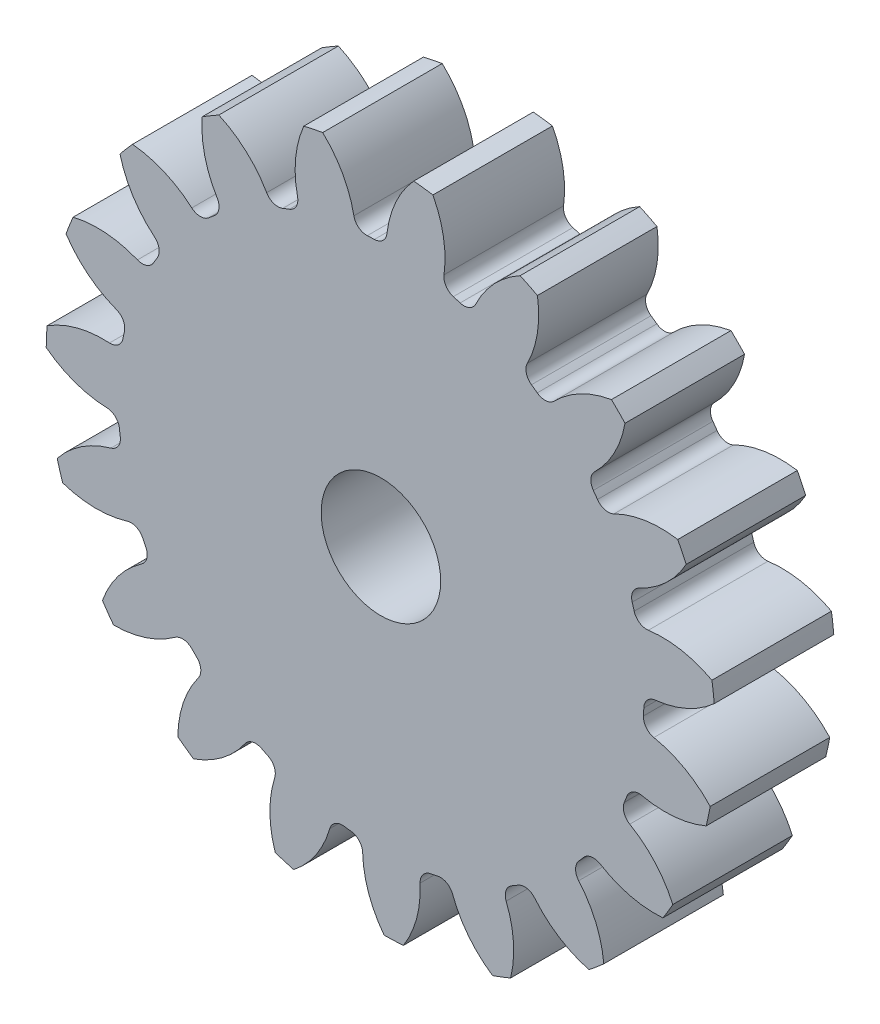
ISO-10303-21;
HEADER;
FILE_DESCRIPTION(('STEP AP214'),'2;1');
FILE_NAME('part.step','',(''),(''),'','','');
FILE_SCHEMA(('AUTOMOTIVE_DESIGN { 1 0 10303 214 1 1 1 1 }'));
ENDSEC;
DATA;
#1=APPLICATION_CONTEXT('core data for automotive mechanical design processes');
#2=APPLICATION_PROTOCOL_DEFINITION('international standard','automotive_design',2000,#1);
#3=PRODUCT_CONTEXT('',#1,'mechanical');
#4=PRODUCT('Part','Part','',(#3));
#5=PRODUCT_RELATED_PRODUCT_CATEGORY('part','',(#4));
#6=PRODUCT_DEFINITION_FORMATION('','',#4);
#7=PRODUCT_DEFINITION_CONTEXT('part definition',#1,'design');
#8=PRODUCT_DEFINITION('design','',#6,#7);
#9=PRODUCT_DEFINITION_SHAPE('','',#8);
#10=(LENGTH_UNIT() NAMED_UNIT(*) SI_UNIT(.MILLI.,.METRE.));
#11=(NAMED_UNIT(*) PLANE_ANGLE_UNIT() SI_UNIT($,.RADIAN.));
#12=(NAMED_UNIT(*) SI_UNIT($,.STERADIAN.) SOLID_ANGLE_UNIT());
#13=UNCERTAINTY_MEASURE_WITH_UNIT(LENGTH_MEASURE(1.E-05),#10,'distance_accuracy_value','');
#14=(GEOMETRIC_REPRESENTATION_CONTEXT(3) GLOBAL_UNCERTAINTY_ASSIGNED_CONTEXT((#13)) GLOBAL_UNIT_ASSIGNED_CONTEXT((#10,
#11,#12)) REPRESENTATION_CONTEXT('',''));
#15=CARTESIAN_POINT('',(0.,0.,0.));
#16=DIRECTION('',(0.,0.,1.));
#17=DIRECTION('',(1.,0.,0.));
#18=AXIS2_PLACEMENT_3D('',#15,#16,#17);
#19=CARTESIAN_POINT('',(0.,0.,127.));
#20=DIRECTION('',(0.,0.,-1.));
#21=DIRECTION('',(-1.,0.,0.));
#22=AXIS2_PLACEMENT_3D('',#19,#20,#21);
#23=CYLINDRICAL_SURFACE('',#22,355.6);
#24=DIRECTION('',(0.,0.,-1.));
#25=VECTOR('',#24,1.);
#26=CARTESIAN_POINT('',(351.615934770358,53.0810174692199,63.5));
#27=LINE('',#26,#25);
#28=CARTESIAN_POINT('',(351.615934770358,53.0810174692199,127.));
#29=VERTEX_POINT('',#28);
#30=CARTESIAN_POINT('',(351.615934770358,53.0810174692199,0.));
#31=VERTEX_POINT('',#30);
#32=EDGE_CURVE('E780',#29,#31,#27,.T.);
#33=ORIENTED_EDGE('',*,*,#32,.F.);
#34=CARTESIAN_POINT('',(0.,0.,127.));
#35=DIRECTION('',(0.,0.,1.));
#36=DIRECTION('',(1.,0.,0.));
#37=AXIS2_PLACEMENT_3D('',#34,#35,#36);
#38=CIRCLE('',#37,355.6);
#39=CARTESIAN_POINT('',(354.091323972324,32.721465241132,127.));
#40=VERTEX_POINT('',#39);
#41=EDGE_CURVE('E1463',#40,#29,#38,.T.);
#42=ORIENTED_EDGE('',*,*,#41,.F.);
#43=DIRECTION('',(0.,0.,-1.));
#44=VECTOR('',#43,1.);
#45=CARTESIAN_POINT('',(354.091323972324,32.721465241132,63.5));
#46=LINE('',#45,#44);
#47=CARTESIAN_POINT('',(354.091323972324,32.721465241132,0.));
#48=VERTEX_POINT('',#47);
#49=EDGE_CURVE('E1457',#48,#40,#46,.F.);
#50=ORIENTED_EDGE('',*,*,#49,.F.);
#51=CARTESIAN_POINT('',(0.,0.,0.));
#52=DIRECTION('',(0.,0.,1.));
#53=DIRECTION('',(1.,0.,0.));
#54=AXIS2_PLACEMENT_3D('',#51,#52,#53);
#55=CIRCLE('',#54,355.6);
#56=EDGE_CURVE('E1468',#48,#31,#55,.T.);
#57=ORIENTED_EDGE('',*,*,#56,.T.);
#58=EDGE_LOOP('',(#33,#42,#50,#57));
#59=FACE_BOUND('',#58,.T.);
#60=ADVANCED_FACE('F33',(#59),#23,.T.);
#61=DIRECTION('',(0.,0.,-1.));
#62=VECTOR('',#61,1.);
#63=CARTESIAN_POINT('',(324.281036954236,145.921790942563,63.5));
#64=LINE('',#63,#62);
#65=CARTESIAN_POINT('',(324.281036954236,145.921790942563,0.));
#66=VERTEX_POINT('',#65);
#67=CARTESIAN_POINT('',(324.281036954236,145.921790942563,127.));
#68=VERTEX_POINT('',#67);
#69=EDGE_CURVE('E751',#66,#68,#64,.F.);
#70=ORIENTED_EDGE('',*,*,#69,.F.);
#71=CARTESIAN_POINT('',(315.32903536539,164.374448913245,0.));
#72=VERTEX_POINT('',#71);
#73=EDGE_CURVE('E1471',#66,#72,#55,.T.);
#74=ORIENTED_EDGE('',*,*,#73,.T.);
#75=DIRECTION('',(0.,0.,-1.));
#76=VECTOR('',#75,1.);
#77=CARTESIAN_POINT('',(315.32903536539,164.374448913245,63.5));
#78=LINE('',#77,#76);
#79=CARTESIAN_POINT('',(315.32903536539,164.374448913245,127.));
#80=VERTEX_POINT('',#79);
#81=EDGE_CURVE('E813',#80,#72,#78,.T.);
#82=ORIENTED_EDGE('',*,*,#81,.F.);
#83=EDGE_CURVE('E1466',#68,#80,#38,.T.);
#84=ORIENTED_EDGE('',*,*,#83,.F.);
#85=EDGE_LOOP('',(#70,#74,#82,#84));
#86=FACE_BOUND('',#85,.T.);
#87=ADVANCED_FACE('F1686',(#86),#23,.T.);
#88=CARTESIAN_POINT('',(0.,0.,127.));
#89=DIRECTION('',(0.,0.,1.));
#90=DIRECTION('',(1.,0.,0.));
#91=AXIS2_PLACEMENT_3D('',#88,#89,#90);
#92=PLANE('',#91);
#93=CARTESIAN_POINT('',(0.,0.,127.000000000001));
#94=DIRECTION('',(0.,0.,1.));
#95=DIRECTION('',(1.,0.,0.));
#96=AXIS2_PLACEMENT_3D('',#93,#94,#95);
#97=CIRCLE('',#96,63.5);
#98=CARTESIAN_POINT('',(63.5,0.,127.000000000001));
#99=VERTEX_POINT('',#98);
#100=EDGE_CURVE('E768',#99,#99,#97,.T.);
#101=ORIENTED_EDGE('',*,*,#100,.F.);
#102=EDGE_LOOP('',(#101));
#103=FACE_BOUND('',#102,.T.);
#104=ORIENTED_EDGE('',*,*,#41,.T.);
#105=CARTESIAN_POINT('',(298.903013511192,-45.3947461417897,127.));
#106=DIRECTION('',(0.,0.,-1.));
#107=DIRECTION('',(0.945817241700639,0.32469946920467,0.));
#108=AXIS2_PLACEMENT_3D('',#105,#106,#107);
#109=CIRCLE('',#108,111.696589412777);
#110=CARTESIAN_POINT('',(284.16211314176,65.3248724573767,127.));
#111=VERTEX_POINT('',#110);
#112=EDGE_CURVE('E760',#111,#29,#109,.T.);
#113=ORIENTED_EDGE('',*,*,#112,.F.);
#114=CARTESIAN_POINT('',(282.343036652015,78.9880443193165,127.));
#115=DIRECTION('',(0.,0.,1.));
#116=DIRECTION('',(-0.945817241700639,-0.32469946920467,0.));
#117=AXIS2_PLACEMENT_3D('',#114,#115,#116);
#118=CIRCLE('',#117,13.7837333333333);
#119=CARTESIAN_POINT('',(269.068967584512,75.274502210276,127.));
#120=VERTEX_POINT('',#119);
#121=EDGE_CURVE('E758',#120,#111,#118,.T.);
#122=ORIENTED_EDGE('',*,*,#121,.F.);
#123=CARTESIAN_POINT('',(0.,0.,127.));
#124=DIRECTION('',(0.,0.,-1.));
#125=DIRECTION('',(0.945817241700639,0.32469946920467,0.));
#126=AXIS2_PLACEMENT_3D('',#123,#124,#125);
#127=CIRCLE('',#126,279.4);
#128=CARTESIAN_POINT('',(266.930237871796,82.5385250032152,127.));
#129=VERTEX_POINT('',#128);
#130=EDGE_CURVE('E743',#129,#120,#127,.T.);
#131=ORIENTED_EDGE('',*,*,#130,.F.);
#132=CARTESIAN_POINT('',(280.098796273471,86.6104255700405,127.));
#133=DIRECTION('',(0.,0.,1.));
#134=DIRECTION('',(-0.945817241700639,-0.32469946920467,0.));
#135=AXIS2_PLACEMENT_3D('',#132,#133,#134);
#136=CIRCLE('',#135,13.7837333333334);
#137=CARTESIAN_POINT('',(274.223834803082,99.0794324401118,127.));
#138=VERTEX_POINT('',#137);
#139=EDGE_CURVE('E735',#138,#129,#136,.T.);
#140=ORIENTED_EDGE('',*,*,#139,.F.);
#141=CARTESIAN_POINT('',(226.616039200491,200.122125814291,127.));
#142=DIRECTION('',(0.,0.,-1.));
#143=DIRECTION('',(-0.945817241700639,-0.32469946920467,0.));
#144=AXIS2_PLACEMENT_3D('',#141,#142,#143);
#145=CIRCLE('',#144,111.696589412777);
#146=EDGE_CURVE('E765',#68,#138,#145,.T.);
#147=ORIENTED_EDGE('',*,*,#146,.F.);
#148=ORIENTED_EDGE('',*,*,#83,.T.);
#149=CARTESIAN_POINT('',(297.447273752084,54.1185162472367,127.));
#150=DIRECTION('',(0.,0.,-1.));
#151=DIRECTION('',(0.789140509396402,0.614212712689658,0.));
#152=AXIS2_PLACEMENT_3D('',#149,#150,#151);
#153=CIRCLE('',#152,111.696589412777);
#154=CARTESIAN_POINT('',(247.554474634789,154.052677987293,127.));
#155=VERTEX_POINT('',#154);
#156=EDGE_CURVE('E789',#155,#80,#153,.T.);
#157=ORIENTED_EDGE('',*,*,#156,.F.);
#158=CARTESIAN_POINT('',(241.397536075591,166.384888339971,127.));
#159=DIRECTION('',(0.,0.,1.));
#160=DIRECTION('',(-0.789140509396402,-0.614212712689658,0.));
#161=AXIS2_PLACEMENT_3D('',#158,#159,#160);
#162=CIRCLE('',#161,13.7837333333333);
#163=CARTESIAN_POINT('',(230.048477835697,158.562473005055,127.));
#164=VERTEX_POINT('',#163);
#165=EDGE_CURVE('E787',#164,#155,#162,.T.);
#166=ORIENTED_EDGE('',*,*,#165,.F.);
#167=CARTESIAN_POINT('',(0.,0.,127.));
#168=DIRECTION('',(0.,0.,-1.));
#169=DIRECTION('',(0.789140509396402,0.614212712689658,0.));
#170=AXIS2_PLACEMENT_3D('',#167,#168,#169);
#171=CIRCLE('',#170,279.4);
#172=CARTESIAN_POINT('',(225.667006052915,164.738466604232,127.));
#173=VERTEX_POINT('',#172);
#174=EDGE_CURVE('E784',#173,#164,#171,.T.);
#175=ORIENTED_EDGE('',*,*,#174,.F.);
#176=CARTESIAN_POINT('',(236.799911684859,172.865564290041,127.));
#177=DIRECTION('',(0.,0.,1.));
#178=DIRECTION('',(-0.789140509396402,-0.614212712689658,0.));
#179=AXIS2_PLACEMENT_3D('',#176,#177,#178);
#180=CIRCLE('',#179,13.7837333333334);
#181=CARTESIAN_POINT('',(227.194591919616,182.751369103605,127.));
#182=VERTEX_POINT('',#181);
#183=EDGE_CURVE('E782',#182,#173,#180,.T.);
#184=ORIENTED_EDGE('',*,*,#183,.F.);
#185=CARTESIAN_POINT('',(149.357809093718,262.861064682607,127.));
#186=DIRECTION('',(0.,0.,-1.));
#187=DIRECTION('',(-0.789140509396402,-0.614212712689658,0.));
#188=AXIS2_PLACEMENT_3D('',#185,#186,#187);
#189=CIRCLE('',#188,111.696589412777);
#190=CARTESIAN_POINT('',(259.32986784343,243.309226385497,127.));
#191=VERTEX_POINT('',#190);
#192=EDGE_CURVE('E792',#191,#182,#189,.T.);
#193=ORIENTED_EDGE('',*,*,#192,.F.);
#194=CARTESIAN_POINT('',(244.871342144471,257.855358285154,127.));
#195=VERTEX_POINT('',#194);
#196=EDGE_CURVE('E1517',#191,#195,#38,.T.);
#197=ORIENTED_EDGE('',*,*,#196,.T.);
#198=CARTESIAN_POINT('',(263.758506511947,147.767197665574,127.));
#199=DIRECTION('',(0.,0.,-1.));
#200=DIRECTION('',(0.546948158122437,0.837166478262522,0.));
#201=AXIS2_PLACEMENT_3D('',#198,#199,#200);
#202=CIRCLE('',#201,111.696589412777);
#203=CARTESIAN_POINT('',(184.120467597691,226.086485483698,127.));
#204=VERTEX_POINT('',#203);
#205=EDGE_CURVE('E824',#204,#195,#202,.T.);
#206=ORIENTED_EDGE('',*,*,#205,.F.);
#207=CARTESIAN_POINT('',(174.292866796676,235.751347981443,127.));
#208=DIRECTION('',(0.,0.,1.));
#209=DIRECTION('',(-0.546948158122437,-0.837166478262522,0.));
#210=AXIS2_PLACEMENT_3D('',#207,#208,#209);
#211=CIRCLE('',#210,13.7837333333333);
#212=CARTESIAN_POINT('',(166.098665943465,224.667739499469,127.));
#213=VERTEX_POINT('',#212);
#214=EDGE_CURVE('E822',#213,#204,#211,.T.);
#215=ORIENTED_EDGE('',*,*,#214,.F.);
#216=CARTESIAN_POINT('',(0.,0.,127.));
#217=DIRECTION('',(0.,0.,-1.));
#218=DIRECTION('',(0.546948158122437,0.837166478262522,0.));
#219=AXIS2_PLACEMENT_3D('',#216,#217,#218);
#220=CIRCLE('',#219,279.4);
#221=CARTESIAN_POINT('',(159.94925254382,229.086439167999,127.));
#222=VERTEX_POINT('',#221);
#223=EDGE_CURVE('E819',#222,#213,#220,.T.);
#224=ORIENTED_EDGE('',*,*,#223,.F.);
#225=CARTESIAN_POINT('',(167.840082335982,240.38803683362,127.));
#226=DIRECTION('',(0.,0.,1.));
#227=DIRECTION('',(-0.546948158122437,-0.837166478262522,0.));
#228=AXIS2_PLACEMENT_3D('',#225,#226,#227);
#229=CIRCLE('',#228,13.7837333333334);
#230=CARTESIAN_POINT('',(155.545289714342,246.61935924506,127.));
#231=VERTEX_POINT('',#230);
#232=EDGE_CURVE('E817',#231,#222,#229,.T.);
#233=ORIENTED_EDGE('',*,*,#232,.F.);
#234=CARTESIAN_POINT('',(55.9143428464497,297.114928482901,127.));
#235=DIRECTION('',(0.,0.,-1.));
#236=DIRECTION('',(-0.546948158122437,-0.837166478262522,0.));
#237=AXIS2_PLACEMENT_3D('',#234,#235,#236);
#238=CIRCLE('',#237,111.696589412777);
#239=CARTESIAN_POINT('',(166.27628363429,314.330331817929,127.));
#240=VERTEX_POINT('',#239);
#241=EDGE_CURVE('E827',#240,#231,#238,.T.);
#242=ORIENTED_EDGE('',*,*,#241,.F.);
#243=CARTESIAN_POINT('',(147.878039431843,323.393638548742,127.));
#244=VERTEX_POINT('',#243);
#245=EDGE_CURVE('E1668',#240,#244,#38,.T.);
#246=ORIENTED_EDGE('',*,*,#245,.T.);
#247=CARTESIAN_POINT('',(201.487412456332,225.403010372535,127.));
#248=DIRECTION('',(0.,0.,-1.));
#249=DIRECTION('',(0.24548548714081,0.969400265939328,0.));
#250=AXIS2_PLACEMENT_3D('',#247,#248,#249);
#251=CIRCLE('',#250,111.696589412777);
#252=CARTESIAN_POINT('',(100.73415097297,273.62031418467,127.));
#253=VERTEX_POINT('',#252);
#254=EDGE_CURVE('E862',#253,#244,#251,.T.);
#255=ORIENTED_EDGE('',*,*,#254,.F.);
#256=CARTESIAN_POINT('',(88.3008609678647,279.570491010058,127.));
#257=DIRECTION('',(0.,0.,1.));
#258=DIRECTION('',(-0.24548548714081,-0.969400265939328,0.));
#259=AXIS2_PLACEMENT_3D('',#256,#257,#258);
#260=CIRCLE('',#259,13.7837333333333);
#261=CARTESIAN_POINT('',(84.1494863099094,266.426770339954,127.));
#262=VERTEX_POINT('',#261);
#263=EDGE_CURVE('E860',#262,#253,#260,.T.);
#264=ORIENTED_EDGE('',*,*,#263,.F.);
#265=CARTESIAN_POINT('',(0.,0.,127.));
#266=DIRECTION('',(0.,0.,-1.));
#267=DIRECTION('',(0.24548548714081,0.969400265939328,0.));
#268=AXIS2_PLACEMENT_3D('',#265,#266,#267);
#269=CIRCLE('',#268,279.4);
#270=CARTESIAN_POINT('',(76.898515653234,268.609341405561,127.));
#271=VERTEX_POINT('',#270);
#272=EDGE_CURVE('E857',#271,#262,#269,.T.);
#273=ORIENTED_EDGE('',*,*,#272,.F.);
#274=CARTESIAN_POINT('',(80.6921757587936,281.860735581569,127.));
#275=DIRECTION('',(0.,0.,1.));
#276=DIRECTION('',(-0.24548548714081,-0.969400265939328,0.));
#277=AXIS2_PLACEMENT_3D('',#274,#275,#276);
#278=CIRCLE('',#277,13.7837333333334);
#279=CARTESIAN_POINT('',(67.0402418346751,283.762315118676,127.));
#280=VERTEX_POINT('',#279);
#281=EDGE_CURVE('E855',#280,#271,#278,.T.);
#282=ORIENTED_EDGE('',*,*,#281,.F.);
#283=CARTESIAN_POINT('',(-43.5883100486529,299.171779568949,127.));
#284=DIRECTION('',(0.,0.,-1.));
#285=DIRECTION('',(-0.24548548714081,-0.969400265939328,0.));
#286=AXIS2_PLACEMENT_3D('',#283,#284,#285);
#287=CIRCLE('',#286,111.696589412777);
#288=CARTESIAN_POINT('',(55.2040840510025,351.28886846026,127.));
#289=VERTEX_POINT('',#288);
#290=EDGE_CURVE('E865',#289,#280,#287,.T.);
#291=ORIENTED_EDGE('',*,*,#290,.F.);
#292=CARTESIAN_POINT('',(34.8598565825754,353.887200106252,127.));
#293=VERTEX_POINT('',#292);
#294=EDGE_CURVE('E1664',#289,#293,#38,.T.);
#295=ORIENTED_EDGE('',*,*,#294,.T.);
#296=CARTESIAN_POINT('',(117.382030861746,278.612909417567,127.));
#297=DIRECTION('',(0.,0.,-1.));
#298=DIRECTION('',(-0.0825793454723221,0.996584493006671,0.));
#299=AXIS2_PLACEMENT_3D('',#296,#297,#298);
#300=CIRCLE('',#299,111.696589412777);
#301=CARTESIAN_POINT('',(6.43172603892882,291.503136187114,127.));
#302=VERTEX_POINT('',#301);
#303=EDGE_CURVE('E900',#302,#293,#300,.T.);
#304=ORIENTED_EDGE('',*,*,#303,.F.);
#305=CARTESIAN_POINT('',(-7.25991327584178,293.093833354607,127.));
#306=DIRECTION('',(0.,0.,1.));
#307=DIRECTION('',(0.0825793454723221,-0.996584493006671,0.));
#308=AXIS2_PLACEMENT_3D('',#305,#306,#307);
#309=CIRCLE('',#308,13.7837333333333);
#310=CARTESIAN_POINT('',(-6.91859587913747,279.314326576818,127.));
#311=VERTEX_POINT('',#310);
#312=EDGE_CURVE('E898',#311,#302,#309,.T.);
#313=ORIENTED_EDGE('',*,*,#312,.F.);
#314=CARTESIAN_POINT('',(0.,0.,127.));
#315=DIRECTION('',(0.,0.,-1.));
#316=DIRECTION('',(-0.0825793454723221,0.996584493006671,0.));
#317=AXIS2_PLACEMENT_3D('',#314,#315,#316);
#318=CIRCLE('',#317,279.4);
#319=CARTESIAN_POINT('',(-14.4853686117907,279.024253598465,127.));
#320=VERTEX_POINT('',#319);
#321=EDGE_CURVE('E895',#320,#311,#318,.T.);
#322=ORIENTED_EDGE('',*,*,#321,.F.);
#323=CARTESIAN_POINT('',(-15.1999801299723,292.789450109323,127.));
#324=DIRECTION('',(0.,0.,1.));
#325=DIRECTION('',(0.0825793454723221,-0.996584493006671,0.));
#326=AXIS2_PLACEMENT_3D('',#323,#324,#325);
#327=CIRCLE('',#326,13.7837333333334);
#328=CARTESIAN_POINT('',(-28.7296564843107,290.155221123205,127.));
#329=VERTEX_POINT('',#328);
#330=EDGE_CURVE('E893',#329,#320,#327,.T.);
#331=ORIENTED_EDGE('',*,*,#330,.F.);
#332=CARTESIAN_POINT('',(-138.367493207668,268.808726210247,127.));
#333=DIRECTION('',(0.,0.,-1.));
#334=DIRECTION('',(0.0825793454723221,-0.996584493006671,0.));
#335=AXIS2_PLACEMENT_3D('',#332,#333,#334);
#336=CIRCLE('',#335,111.696589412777);
#337=CARTESIAN_POINT('',(-61.8503346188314,350.179805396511,127.));
#338=VERTEX_POINT('',#337);
#339=EDGE_CURVE('E903',#338,#329,#336,.T.);
#340=ORIENTED_EDGE('',*,*,#339,.F.);
#341=CARTESIAN_POINT('',(-81.9359326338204,346.031592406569,127.));
#342=VERTEX_POINT('',#341);
#343=EDGE_CURVE('E1660',#338,#342,#38,.T.);
#344=ORIENTED_EDGE('',*,*,#343,.T.);
#345=CARTESIAN_POINT('',(20.5564848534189,301.630776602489,127.));
#346=DIRECTION('',(0.,0.,-1.));
#347=DIRECTION('',(-0.40169542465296,0.915773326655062,0.));
#348=AXIS2_PLACEMENT_3D('',#345,#346,#347);
#349=CIRCLE('',#348,111.696589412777);
#350=CARTESIAN_POINT('',(-88.5676762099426,277.79707024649,127.));
#351=VERTEX_POINT('',#350);
#352=EDGE_CURVE('E938',#351,#342,#349,.T.);
#353=ORIENTED_EDGE('',*,*,#352,.F.);
#354=CARTESIAN_POINT('',(-102.033963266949,274.855911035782,127.));
#355=DIRECTION('',(0.,0.,1.));
#356=DIRECTION('',(0.40169542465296,-0.915773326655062,0.));
#357=AXIS2_PLACEMENT_3D('',#354,#355,#356);
#358=CIRCLE('',#357,13.7837333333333);
#359=CARTESIAN_POINT('',(-97.2369408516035,261.933841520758,127.));
#360=VERTEX_POINT('',#359);
#361=EDGE_CURVE('E936',#360,#351,#358,.T.);
#362=ORIENTED_EDGE('',*,*,#361,.F.);
#363=CARTESIAN_POINT('',(0.,0.,127.));
#364=DIRECTION('',(0.,0.,-1.));
#365=DIRECTION('',(-0.40169542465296,0.915773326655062,0.));
#366=AXIS2_PLACEMENT_3D('',#363,#364,#365);
#367=CIRCLE('',#366,279.4);
#368=CARTESIAN_POINT('',(-104.299538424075,259.202558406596,127.));
#369=VERTEX_POINT('',#368);
#370=EDGE_CURVE('E933',#369,#360,#367,.T.);
#371=ORIENTED_EDGE('',*,*,#370,.F.);
#372=CARTESIAN_POINT('',(-109.444982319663,271.989884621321,127.));
#373=DIRECTION('',(0.,0.,1.));
#374=DIRECTION('',(0.40169542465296,-0.915773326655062,0.));
#375=AXIS2_PLACEMENT_3D('',#372,#373,#374);
#376=CIRCLE('',#375,13.7837333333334);
#377=CARTESIAN_POINT('',(-121.38625073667,265.105306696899,127.));
#378=VERTEX_POINT('',#377);
#379=EDGE_CURVE('E931',#378,#369,#376,.T.);
#380=ORIENTED_EDGE('',*,*,#379,.F.);
#381=CARTESIAN_POINT('',(-218.152411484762,209.316076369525,127.));
#382=DIRECTION('',(0.,0.,-1.));
#383=DIRECTION('',(0.40169542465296,-0.915773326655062,0.));
#384=AXIS2_PLACEMENT_3D('',#381,#382,#383);
#385=CIRCLE('',#384,111.696589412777);
#386=CARTESIAN_POINT('',(-172.202309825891,311.123326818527,127.));
#387=VERTEX_POINT('',#386);
#388=EDGE_CURVE('E941',#387,#378,#385,.T.);
#389=ORIENTED_EDGE('',*,*,#388,.F.);
#390=CARTESIAN_POINT('',(-189.852692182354,300.678092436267,127.));
#391=VERTEX_POINT('',#390);
#392=EDGE_CURVE('E1656',#387,#391,#38,.T.);
#393=ORIENTED_EDGE('',*,*,#392,.T.);
#394=CARTESIAN_POINT('',(-78.4966752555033,291.962268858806,127.));
#395=DIRECTION('',(0.,0.,-1.));
#396=DIRECTION('',(-0.677281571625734,0.735723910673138,0.));
#397=AXIS2_PLACEMENT_3D('',#394,#395,#396);
#398=CIRCLE('',#397,111.696589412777);
#399=CARTESIAN_POINT('',(-173.969396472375,233.987381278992,127.));
#400=VERTEX_POINT('',#399);
#401=EDGE_CURVE('E976',#400,#391,#398,.T.);
#402=ORIENTED_EDGE('',*,*,#401,.F.);
#403=CARTESIAN_POINT('',(-185.751050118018,226.83308592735,127.));
#404=DIRECTION('',(0.,0.,1.));
#405=DIRECTION('',(0.677281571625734,-0.735723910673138,0.));
#406=AXIS2_PLACEMENT_3D('',#403,#404,#405);
#407=CIRCLE('',#406,13.7837333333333);
#408=CARTESIAN_POINT('',(-177.018154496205,216.168760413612,127.));
#409=VERTEX_POINT('',#408);
#410=EDGE_CURVE('E974',#409,#400,#407,.T.);
#411=ORIENTED_EDGE('',*,*,#410,.F.);
#412=CARTESIAN_POINT('',(0.,0.,127.));
#413=DIRECTION('',(0.,0.,-1.));
#414=DIRECTION('',(-0.677281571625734,0.735723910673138,0.));
#415=AXIS2_PLACEMENT_3D('',#412,#413,#414);
#416=CIRCLE('',#415,279.4);
#417=CARTESIAN_POINT('',(-182.811234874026,211.292244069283,127.));
#418=VERTEX_POINT('',#417);
#419=EDGE_CURVE('E971',#418,#409,#416,.T.);
#420=ORIENTED_EDGE('',*,*,#419,.F.);
#421=CARTESIAN_POINT('',(-191.829922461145,221.715994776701,127.));
#422=DIRECTION('',(0.,0.,1.));
#423=DIRECTION('',(0.677281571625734,-0.735723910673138,0.));
#424=AXIS2_PLACEMENT_3D('',#421,#422,#423);
#425=CIRCLE('',#424,13.7837333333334);
#426=CARTESIAN_POINT('',(-200.888761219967,211.327118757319,127.));
#427=VERTEX_POINT('',#426);
#428=EDGE_CURVE('E969',#427,#418,#425,.T.);
#429=ORIENTED_EDGE('',*,*,#428,.F.);
#430=CARTESIAN_POINT('',(-274.297130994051,127.140781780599,127.));
#431=DIRECTION('',(0.,0.,-1.));
#432=DIRECTION('',(0.677281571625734,-0.735723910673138,0.));
#433=AXIS2_PLACEMENT_3D('',#430,#431,#432);
#434=CIRCLE('',#433,111.696589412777);
#435=CARTESIAN_POINT('',(-263.893492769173,238.351808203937,127.));
#436=VERTEX_POINT('',#435);
#437=EDGE_CURVE('E979',#436,#427,#434,.T.);
#438=ORIENTED_EDGE('',*,*,#437,.F.);
#439=CARTESIAN_POINT('',(-277.195966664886,222.741455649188,127.));
#440=VERTEX_POINT('',#439);
#441=EDGE_CURVE('E1652',#436,#440,#38,.T.);
#442=ORIENTED_EDGE('',*,*,#441,.T.);
#443=CARTESIAN_POINT('',(-169.04350259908,250.6551190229,127.));
#444=DIRECTION('',(0.,0.,-1.));
#445=DIRECTION('',(-0.879473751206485,0.475947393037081,0.));
#446=AXIS2_PLACEMENT_3D('',#443,#444,#445);
#447=CIRCLE('',#446,111.696589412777);
#448=CARTESIAN_POINT('',(-240.518833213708,164.821528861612,127.));
#449=VERTEX_POINT('',#448);
#450=EDGE_CURVE('E1014',#449,#440,#447,.T.);
#451=ORIENTED_EDGE('',*,*,#450,.F.);
#452=CARTESIAN_POINT('',(-249.339128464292,154.229376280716,127.));
#453=DIRECTION('',(0.,0.,1.));
#454=DIRECTION('',(0.879473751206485,-0.475947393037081,0.));
#455=AXIS2_PLACEMENT_3D('',#452,#453,#454);
#456=CIRCLE('',#455,13.7837333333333);
#457=CARTESIAN_POINT('',(-237.616704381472,146.978439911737,127.));
#458=VERTEX_POINT('',#457);
#459=EDGE_CURVE('E1012',#458,#449,#456,.T.);
#460=ORIENTED_EDGE('',*,*,#459,.F.);
#461=CARTESIAN_POINT('',(0.,0.,127.));
#462=DIRECTION('',(0.,0.,-1.));
#463=DIRECTION('',(-0.879473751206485,0.475947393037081,0.));
#464=AXIS2_PLACEMENT_3D('',#461,#462,#463);
#465=CIRCLE('',#464,279.4);
#466=CARTESIAN_POINT('',(-241.512497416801,140.485136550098,127.));
#467=VERTEX_POINT('',#466);
#468=EDGE_CURVE('E1009',#467,#458,#465,.T.);
#469=ORIENTED_EDGE('',*,*,#468,.F.);
#470=CARTESIAN_POINT('',(-253.42711395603,147.415736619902,127.));
#471=DIRECTION('',(0.,0.,1.));
#472=DIRECTION('',(0.879473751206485,-0.475947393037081,0.));
#473=AXIS2_PLACEMENT_3D('',#470,#471,#472);
#474=CIRCLE('',#473,13.7837333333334);
#475=CARTESIAN_POINT('',(-258.621857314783,134.64835842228,127.));
#476=VERTEX_POINT('',#475);
#477=EDGE_CURVE('E1007',#476,#467,#474,.T.);
#478=ORIENTED_EDGE('',*,*,#477,.F.);
#479=CARTESIAN_POINT('',(-300.71750020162,31.1878106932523,127.));
#480=DIRECTION('',(0.,0.,-1.));
#481=DIRECTION('',(0.879473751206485,-0.475947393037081,0.));
#482=AXIS2_PLACEMENT_3D('',#479,#480,#481);
#483=CIRCLE('',#482,111.696589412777);
#484=CARTESIAN_POINT('',(-326.987721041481,139.751172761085,127.));
#485=VERTEX_POINT('',#484);
#486=EDGE_CURVE('E1017',#485,#476,#483,.T.);
#487=ORIENTED_EDGE('',*,*,#486,.F.);
#488=CARTESIAN_POINT('',(-334.500757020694,120.667325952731,127.));
#489=VERTEX_POINT('',#488);
#490=EDGE_CURVE('E1648',#485,#489,#38,.T.);
#491=ORIENTED_EDGE('',*,*,#490,.T.);
#492=CARTESIAN_POINT('',(-241.271843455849,182.185597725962,127.));
#493=DIRECTION('',(0.,0.,-1.));
#494=DIRECTION('',(-0.986361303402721,0.164594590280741,0.));
#495=AXIS2_PLACEMENT_3D('',#492,#493,#494);
#496=CIRCLE('',#495,111.696589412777);
#497=CARTESIAN_POINT('',(-281.004322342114,77.79470632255,127.));
#498=VERTEX_POINT('',#497);
#499=EDGE_CURVE('E1052',#498,#489,#496,.T.);
#500=ORIENTED_EDGE('',*,*,#499,.F.);
#501=CARTESIAN_POINT('',(-285.907443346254,64.9125205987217,127.));
#502=DIRECTION('',(0.,0.,1.));
#503=DIRECTION('',(0.986361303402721,-0.164594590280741,0.));
#504=AXIS2_PLACEMENT_3D('',#501,#502,#503);
#505=CIRCLE('',#504,13.7837333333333);
#506=CARTESIAN_POINT('',(-272.465797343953,61.860724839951,127.));
#507=VERTEX_POINT('',#506);
#508=EDGE_CURVE('E1050',#507,#498,#505,.T.);
#509=ORIENTED_EDGE('',*,*,#508,.F.);
#510=CARTESIAN_POINT('',(0.,0.,127.));
#511=DIRECTION('',(0.,0.,-1.));
#512=DIRECTION('',(-0.986361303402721,0.164594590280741,0.));
#513=AXIS2_PLACEMENT_3D('',#510,#511,#512);
#514=CIRCLE('',#513,279.4);
#515=CARTESIAN_POINT('',(-274.042133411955,54.4542846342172,127.));
#516=VERTEX_POINT('',#515);
#517=EDGE_CURVE('E1047',#516,#507,#514,.T.);
#518=ORIENTED_EDGE('',*,*,#517,.F.);
#519=CARTESIAN_POINT('',(-287.561545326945,57.1406960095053,127.));
#520=DIRECTION('',(0.,0.,1.));
#521=DIRECTION('',(0.986361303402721,-0.164594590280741,0.));
#522=AXIS2_PLACEMENT_3D('',#519,#520,#521);
#523=CIRCLE('',#522,13.7837333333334);
#524=CARTESIAN_POINT('',(-288.32926223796,43.3783591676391,127.));
#525=VERTEX_POINT('',#524);
#526=EDGE_CURVE('E1045',#525,#516,#523,.T.);
#527=ORIENTED_EDGE('',*,*,#526,.F.);
#528=CARTESIAN_POINT('',(-294.550462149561,-68.1448436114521,127.));
#529=DIRECTION('',(0.,0.,-1.));
#530=DIRECTION('',(0.986361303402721,-0.164594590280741,0.));
#531=AXIS2_PLACEMENT_3D('',#528,#529,#530);
#532=CIRCLE('',#531,111.696589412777);
#533=CARTESIAN_POINT('',(-354.647756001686,26.0063292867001,127.));
#534=VERTEX_POINT('',#533);
#535=EDGE_CURVE('E1055',#534,#525,#532,.T.);
#536=ORIENTED_EDGE('',*,*,#535,.F.);
#537=CARTESIAN_POINT('',(-355.557200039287,5.51701914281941,127.));
#538=VERTEX_POINT('',#537);
#539=EDGE_CURVE('E1644',#534,#538,#38,.T.);
#540=ORIENTED_EDGE('',*,*,#539,.T.);
#541=CARTESIAN_POINT('',(-287.354636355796,93.9734400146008,127.));
#542=DIRECTION('',(0.,0.,-1.));
#543=DIRECTION('',(-0.986361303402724,-0.164594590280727,0.));
#544=AXIS2_PLACEMENT_3D('',#541,#542,#543);
#545=CIRCLE('',#544,111.696589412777);
#546=CARTESIAN_POINT('',(-291.038632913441,-17.6623797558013,127.));
#547=VERTEX_POINT('',#546);
#548=EDGE_CURVE('E1090',#547,#538,#545,.T.);
#549=ORIENTED_EDGE('',*,*,#548,.F.);
#550=CARTESIAN_POINT('',(-291.493250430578,-31.4386139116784,127.));
#551=DIRECTION('',(0.,0.,1.));
#552=DIRECTION('',(0.986361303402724,0.164594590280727,0.));
#553=AXIS2_PLACEMENT_3D('',#550,#551,#552);
#554=CIRCLE('',#553,13.7837333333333);
#555=CARTESIAN_POINT('',(-277.78899342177,-29.960559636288,127.));
#556=VERTEX_POINT('',#555);
#557=EDGE_CURVE('E1088',#556,#547,#554,.T.);
#558=ORIENTED_EDGE('',*,*,#557,.F.);
#559=CARTESIAN_POINT('',(0.,0.,127.));
#560=DIRECTION('',(0.,0.,-1.));
#561=DIRECTION('',(-0.986361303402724,-0.164594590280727,0.));
#562=AXIS2_PLACEMENT_3D('',#559,#560,#561);
#563=CIRCLE('',#562,279.4);
#564=CARTESIAN_POINT('',(-276.875052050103,-37.4775339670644,127.));
#565=VERTEX_POINT('',#564);
#566=EDGE_CURVE('E1085',#565,#556,#563,.T.);
#567=ORIENTED_EDGE('',*,*,#566,.F.);
#568=CARTESIAN_POINT('',(-290.534221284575,-39.3264256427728,127.));
#569=DIRECTION('',(0.,0.,1.));
#570=DIRECTION('',(0.986361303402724,0.164594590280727,0.));
#571=AXIS2_PLACEMENT_3D('',#568,#569,#570);
#572=CIRCLE('',#571,13.7837333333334);
#573=CARTESIAN_POINT('',(-286.791717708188,-52.5923583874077,127.));
#574=VERTEX_POINT('',#573);
#575=EDGE_CURVE('E1083',#574,#565,#572,.T.);
#576=ORIENTED_EDGE('',*,*,#575,.F.);
#577=CARTESIAN_POINT('',(-256.464311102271,-160.092946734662,127.));
#578=DIRECTION('',(0.,0.,-1.));
#579=DIRECTION('',(0.986361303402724,0.164594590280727,0.));
#580=AXIS2_PLACEMENT_3D('',#577,#578,#579);
#581=CIRCLE('',#580,111.696589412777);
#582=CARTESIAN_POINT('',(-343.876203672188,-90.5567034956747,127.));
#583=VERTEX_POINT('',#582);
#584=EDGE_CURVE('E1093',#583,#574,#581,.T.);
#585=ORIENTED_EDGE('',*,*,#584,.F.);
#586=CARTESIAN_POINT('',(-338.083503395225,-110.231142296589,127.));
#587=VERTEX_POINT('',#586);
#588=EDGE_CURVE('E1640',#583,#587,#38,.T.);
#589=ORIENTED_EDGE('',*,*,#588,.T.);
#590=CARTESIAN_POINT('',(-302.298095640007,-4.42219807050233,127.));
#591=DIRECTION('',(0.,0.,-1.));
#592=DIRECTION('',(-0.879473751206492,-0.475947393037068,0.));
#593=AXIS2_PLACEMENT_3D('',#590,#591,#592);
#594=CIRCLE('',#593,111.696589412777);
#595=CARTESIAN_POINT('',(-269.534391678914,-111.205472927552,127.));
#596=VERTEX_POINT('',#595);
#597=EDGE_CURVE('E1128',#596,#587,#594,.T.);
#598=ORIENTED_EDGE('',*,*,#597,.F.);
#599=CARTESIAN_POINT('',(-265.491240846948,-124.382886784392,127.));
#600=DIRECTION('',(0.,0.,1.));
#601=DIRECTION('',(0.879473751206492,0.475947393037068,0.));
#602=AXIS2_PLACEMENT_3D('',#599,#600,#601);
#603=CIRCLE('',#602,13.7837333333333);
#604=CARTESIAN_POINT('',(-253.009441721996,-118.535152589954,127.));
#605=VERTEX_POINT('',#604);
#606=EDGE_CURVE('E1126',#605,#596,#603,.T.);
#607=ORIENTED_EDGE('',*,*,#606,.F.);
#608=CARTESIAN_POINT('',(0.,0.,127.));
#609=DIRECTION('',(0.,0.,-1.));
#610=DIRECTION('',(-0.879473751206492,-0.475947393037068,0.));
#611=AXIS2_PLACEMENT_3D('',#608,#609,#610);
#612=CIRCLE('',#611,279.4);
#613=CARTESIAN_POINT('',(-249.704262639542,-125.348080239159,127.));
#614=VERTEX_POINT('',#613);
#615=EDGE_CURVE('E1123',#614,#605,#612,.T.);
#616=ORIENTED_EDGE('',*,*,#615,.F.);
#617=CARTESIAN_POINT('',(-262.023006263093,-131.53191886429,127.));
#618=DIRECTION('',(0.,0.,1.));
#619=DIRECTION('',(0.879473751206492,0.475947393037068,0.));
#620=AXIS2_PLACEMENT_3D('',#617,#618,#619);
#621=CIRCLE('',#620,13.7837333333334);
#622=CARTESIAN_POINT('',(-254.175840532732,-142.863877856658,127.));
#623=VERTEX_POINT('',#622);
#624=EDGE_CURVE('E1121',#623,#614,#621,.T.);
#625=ORIENTED_EDGE('',*,*,#624,.F.);
#626=CARTESIAN_POINT('',(-190.586272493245,-234.692494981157,127.));
#627=DIRECTION('',(0.,0.,-1.));
#628=DIRECTION('',(0.879473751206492,0.475947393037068,0.));
#629=AXIS2_PLACEMENT_3D('',#626,#627,#628);
#630=CIRCLE('',#629,111.696589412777);
#631=CARTESIAN_POINT('',(-295.840328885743,-197.306512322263,127.));
#632=VERTEX_POINT('',#631);
#633=EDGE_CURVE('E1131',#632,#623,#630,.T.);
#634=ORIENTED_EDGE('',*,*,#633,.F.);
#635=CARTESIAN_POINT('',(-283.97321325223,-214.03404905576,127.));
#636=VERTEX_POINT('',#635);
#637=EDGE_CURVE('E1636',#632,#636,#38,.T.);
#638=ORIENTED_EDGE('',*,*,#637,.T.);
#639=CARTESIAN_POINT('',(-284.482865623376,-102.338622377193,127.));
#640=DIRECTION('',(0.,0.,-1.));
#641=DIRECTION('',(-0.677281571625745,-0.735723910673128,0.));
#642=AXIS2_PLACEMENT_3D('',#639,#640,#641);
#643=CIRCLE('',#642,111.696589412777);
#644=CARTESIAN_POINT('',(-218.821916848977,-192.697727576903,127.));
#645=VERTEX_POINT('',#644);
#646=EDGE_CURVE('E1166',#645,#636,#643,.T.);
#647=ORIENTED_EDGE('',*,*,#646,.F.);
#648=CARTESIAN_POINT('',(-210.719135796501,-203.848343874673,127.));
#649=DIRECTION('',(0.,0.,1.));
#650=DIRECTION('',(0.677281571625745,0.735723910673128,0.));
#651=AXIS2_PLACEMENT_3D('',#648,#649,#650);
#652=CIRCLE('',#651,13.7837333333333);
#653=CARTESIAN_POINT('',(-200.812391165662,-194.2646224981,127.));
#654=VERTEX_POINT('',#653);
#655=EDGE_CURVE('E1164',#654,#645,#652,.T.);
#656=ORIENTED_EDGE('',*,*,#655,.F.);
#657=CARTESIAN_POINT('',(0.,0.,127.));
#658=DIRECTION('',(0.,0.,-1.));
#659=DIRECTION('',(-0.677281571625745,-0.735723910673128,0.));
#660=AXIS2_PLACEMENT_3D('',#657,#658,#659);
#661=CIRCLE('',#660,279.4);
#662=CARTESIAN_POINT('',(-195.474141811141,-199.635217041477,127.));
#663=VERTEX_POINT('',#662);
#664=EDGE_CURVE('E1161',#663,#654,#661,.T.);
#665=ORIENTED_EDGE('',*,*,#664,.F.);
#666=CARTESIAN_POINT('',(-205.117532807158,-209.483887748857,127.));
#667=DIRECTION('',(0.,0.,1.));
#668=DIRECTION('',(0.677281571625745,0.735723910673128,0.));
#669=AXIS2_PLACEMENT_3D('',#666,#667,#668);
#670=CIRCLE('',#669,13.7837333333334);
#671=CARTESIAN_POINT('',(-194.016067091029,-217.653879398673,127.));
#672=VERTEX_POINT('',#671);
#673=EDGE_CURVE('E1159',#672,#663,#670,.T.);
#674=ORIENTED_EDGE('',*,*,#673,.F.);
#675=CARTESIAN_POINT('',(-104.055254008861,-283.859469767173,127.));
#676=DIRECTION('',(0.,0.,-1.));
#677=DIRECTION('',(0.677281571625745,0.735723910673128,0.));
#678=AXIS2_PLACEMENT_3D('',#675,#676,#677);
#679=CIRCLE('',#678,111.696589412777);
#680=CARTESIAN_POINT('',(-215.745564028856,-282.675099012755,127.));
#681=VERTEX_POINT('',#680);
#682=EDGE_CURVE('E1169',#681,#672,#679,.T.);
#683=ORIENTED_EDGE('',*,*,#682,.F.);
#684=CARTESIAN_POINT('',(-199.090019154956,-294.643045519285,127.));
#685=VERTEX_POINT('',#684);
#686=EDGE_CURVE('E1632',#681,#685,#38,.T.);
#687=ORIENTED_EDGE('',*,*,#686,.T.);
#688=CARTESIAN_POINT('',(-235.83950290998,-189.165069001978,127.));
#689=DIRECTION('',(0.,0.,-1.));
#690=DIRECTION('',(-0.401695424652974,-0.915773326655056,0.));
#691=AXIS2_PLACEMENT_3D('',#688,#689,#690);
#692=CIRCLE('',#691,111.696589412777);
#693=CARTESIAN_POINT('',(-144.396691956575,-253.308193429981,127.));
#694=VERTEX_POINT('',#693);
#695=EDGE_CURVE('E1204',#694,#685,#692,.T.);
#696=ORIENTED_EDGE('',*,*,#695,.F.);
#697=CARTESIAN_POINT('',(-133.112342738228,-261.223669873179,127.));
#698=DIRECTION('',(0.,0.,1.));
#699=DIRECTION('',(0.401695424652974,0.915773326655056,0.));
#700=AXIS2_PLACEMENT_3D('',#697,#698,#699);
#701=CIRCLE('',#700,13.7837333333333);
#702=CARTESIAN_POINT('',(-126.854202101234,-248.942506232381,127.));
#703=VERTEX_POINT('',#702);
#704=EDGE_CURVE('E1202',#703,#694,#701,.T.);
#705=ORIENTED_EDGE('',*,*,#704,.F.);
#706=CARTESIAN_POINT('',(0.,0.,127.));
#707=DIRECTION('',(0.,0.,-1.));
#708=DIRECTION('',(-0.401695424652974,-0.915773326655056,0.));
#709=AXIS2_PLACEMENT_3D('',#706,#707,#708);
#710=CIRCLE('',#709,279.4);
#711=CARTESIAN_POINT('',(-120.061364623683,-252.288780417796,127.));
#712=VERTEX_POINT('',#711);
#713=EDGE_CURVE('E1199',#712,#703,#710,.T.);
#714=ORIENTED_EDGE('',*,*,#713,.F.);
#715=CARTESIAN_POINT('',(-125.984391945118,-264.735026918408,127.));
#716=DIRECTION('',(0.,0.,1.));
#717=DIRECTION('',(0.401695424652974,0.915773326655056,0.));
#718=AXIS2_PLACEMENT_3D('',#715,#716,#717);
#719=CIRCLE('',#718,13.7837333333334);
#720=CARTESIAN_POINT('',(-112.831642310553,-268.857705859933,127.));
#721=VERTEX_POINT('',#720);
#722=EDGE_CURVE('E1197',#721,#712,#719,.T.);
#723=ORIENTED_EDGE('',*,*,#722,.F.);
#724=CARTESIAN_POINT('',(-6.24823416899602,-302.265866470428,127.));
#725=DIRECTION('',(0.,0.,-1.));
#726=DIRECTION('',(0.401695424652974,0.915773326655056,0.));
#727=AXIS2_PLACEMENT_3D('',#724,#725,#726);
#728=CIRCLE('',#727,111.696589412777);
#729=CARTESIAN_POINT('',(-112.271419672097,-337.411452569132,127.));
#730=VERTEX_POINT('',#729);
#731=EDGE_CURVE('E1207',#730,#721,#728,.T.);
#732=ORIENTED_EDGE('',*,*,#731,.F.);
#733=CARTESIAN_POINT('',(-92.6323322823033,-343.322896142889,127.));
#734=VERTEX_POINT('',#733);
#735=EDGE_CURVE('E1628',#730,#734,#38,.T.);
#736=ORIENTED_EDGE('',*,*,#735,.T.);
#737=CARTESIAN_POINT('',(-161.639270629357,-255.492545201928,127.));
#738=DIRECTION('',(0.,0.,-1.));
#739=DIRECTION('',(-0.082579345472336,-0.99658449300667,0.));
#740=AXIS2_PLACEMENT_3D('',#737,#738,#739);
#741=CIRCLE('',#740,111.696589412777);
#742=CARTESIAN_POINT('',(-54.3238449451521,-286.468786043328,127.));
#743=VERTEX_POINT('',#742);
#744=EDGE_CURVE('E1242',#743,#734,#741,.T.);
#745=ORIENTED_EDGE('',*,*,#744,.F.);
#746=CARTESIAN_POINT('',(-41.0807618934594,-290.291357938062,127.));
#747=DIRECTION('',(0.,0.,1.));
#748=DIRECTION('',(0.082579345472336,0.99658449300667,0.));
#749=AXIS2_PLACEMENT_3D('',#746,#747,#748);
#750=CIRCLE('',#749,13.7837333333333);
#751=CARTESIAN_POINT('',(-39.1493918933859,-276.643606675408,127.));
#752=VERTEX_POINT('',#751);
#753=EDGE_CURVE('E1240',#752,#743,#750,.T.);
#754=ORIENTED_EDGE('',*,*,#753,.F.);
#755=CARTESIAN_POINT('',(0.,0.,127.));
#756=DIRECTION('',(0.,0.,-1.));
#757=DIRECTION('',(-0.082579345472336,-0.99658449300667,0.));
#758=AXIS2_PLACEMENT_3D('',#755,#756,#757);
#759=CIRCLE('',#758,279.4);
#760=CARTESIAN_POINT('',(-31.6380756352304,-277.602939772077,127.));
#761=VERTEX_POINT('',#760);
#762=EDGE_CURVE('E1237',#761,#752,#759,.T.);
#763=ORIENTED_EDGE('',*,*,#762,.F.);
#764=CARTESIAN_POINT('',(-33.1988873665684,-291.298018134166,127.));
#765=DIRECTION('',(0.,0.,1.));
#766=DIRECTION('',(0.082579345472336,0.99658449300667,0.));
#767=AXIS2_PLACEMENT_3D('',#764,#765,#766);
#768=CIRCLE('',#767,13.7837333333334);
#769=CARTESIAN_POINT('',(-19.4201583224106,-290.926628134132,127.));
#770=VERTEX_POINT('',#769);
#771=EDGE_CURVE('E1235',#770,#761,#768,.T.);
#772=ORIENTED_EDGE('',*,*,#771,.F.);
#773=CARTESIAN_POINT('',(92.2358787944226,-287.917066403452,127.));
#774=DIRECTION('',(0.,0.,-1.));
#775=DIRECTION('',(0.082579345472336,0.99658449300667,0.));
#776=AXIS2_PLACEMENT_3D('',#773,#774,#775);
#777=CIRCLE('',#776,111.696589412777);
#778=CARTESIAN_POINT('',(3.36907507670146,-355.584039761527,127.));
#779=VERTEX_POINT('',#778);
#780=EDGE_CURVE('E1245',#779,#770,#777,.T.);
#781=ORIENTED_EDGE('',*,*,#780,.F.);
#782=CARTESIAN_POINT('',(23.8635051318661,-354.798383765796,127.));
#783=VERTEX_POINT('',#782);
#784=EDGE_CURVE('E1624',#779,#783,#38,.T.);
#785=ORIENTED_EDGE('',*,*,#784,.T.);
#786=CARTESIAN_POINT('',(-69.9229152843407,-294.133439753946,127.));
#787=DIRECTION('',(0.,0.,-1.));
#788=DIRECTION('',(0.245485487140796,-0.969400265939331,0.));
#789=AXIS2_PLACEMENT_3D('',#786,#787,#788);
#790=CIRCLE('',#789,111.696589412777);
#791=CARTESIAN_POINT('',(41.6358335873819,-288.586040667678,127.));
#792=VERTEX_POINT('',#791);
#793=EDGE_CURVE('E1280',#792,#783,#790,.T.);
#794=ORIENTED_EDGE('',*,*,#793,.F.);
#795=CARTESIAN_POINT('',(55.4025569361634,-287.90147303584,127.));
#796=DIRECTION('',(0.,0.,1.));
#797=DIRECTION('',(-0.245485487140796,0.969400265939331,0.));
#798=AXIS2_PLACEMENT_3D('',#795,#796,#797);
#799=CIRCLE('',#798,13.7837333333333);
#800=CARTESIAN_POINT('',(52.7978623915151,-274.366079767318,127.));
#801=VERTEX_POINT('',#800);
#802=EDGE_CURVE('E1278',#801,#792,#799,.T.);
#803=ORIENTED_EDGE('',*,*,#802,.F.);
#804=CARTESIAN_POINT('',(0.,0.,127.));
#805=DIRECTION('',(0.,0.,-1.));
#806=DIRECTION('',(0.245485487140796,-0.969400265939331,0.));
#807=AXIS2_PLACEMENT_3D('',#804,#805,#806);
#808=CIRCLE('',#807,279.4);
#809=CARTESIAN_POINT('',(60.2136897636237,-272.83451314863,127.));
#810=VERTEX_POINT('',#809);
#811=EDGE_CURVE('E1275',#810,#801,#808,.T.);
#812=ORIENTED_EDGE('',*,*,#811,.F.);
#813=CARTESIAN_POINT('',(63.1842317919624,-286.294349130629,127.));
#814=DIRECTION('',(0.,0.,1.));
#815=DIRECTION('',(-0.245485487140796,0.969400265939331,0.));
#816=AXIS2_PLACEMENT_3D('',#813,#814,#815);
#817=CIRCLE('',#816,13.7837333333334);
#818=CARTESIAN_POINT('',(76.095801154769,-281.469136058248,127.));
#819=VERTEX_POINT('',#818);
#820=EDGE_CURVE('E1273',#819,#810,#817,.T.);
#821=ORIENTED_EDGE('',*,*,#820,.F.);
#822=CARTESIAN_POINT('',(180.724803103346,-242.367984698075,127.));
#823=DIRECTION('',(0.,0.,-1.));
#824=DIRECTION('',(-0.245485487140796,0.969400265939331,0.));
#825=AXIS2_PLACEMENT_3D('',#822,#823,#824);
#826=CIRCLE('',#825,111.696589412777);
#827=CARTESIAN_POINT('',(118.644478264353,-335.223578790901,127.));
#828=VERTEX_POINT('',#827);
#829=EDGE_CURVE('E1283',#828,#819,#826,.T.);
#830=ORIENTED_EDGE('',*,*,#829,.F.);
#831=CARTESIAN_POINT('',(137.773361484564,-327.825961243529,127.));
#832=VERTEX_POINT('',#831);
#833=EDGE_CURVE('E1620',#828,#832,#38,.T.);
#834=ORIENTED_EDGE('',*,*,#833,.T.);
#835=CARTESIAN_POINT('',(29.370672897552,-300.900412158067,127.));
#836=DIRECTION('',(0.,0.,-1.));
#837=DIRECTION('',(0.546948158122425,-0.83716647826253,0.));
#838=AXIS2_PLACEMENT_3D('',#835,#836,#837);
#839=CIRCLE('',#838,111.696589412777);
#840=CARTESIAN_POINT('',(133.083623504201,-259.430519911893,127.));
#841=VERTEX_POINT('',#840);
#842=EDGE_CURVE('E1318',#841,#832,#839,.T.);
#843=ORIENTED_EDGE('',*,*,#842,.F.);
#844=CARTESIAN_POINT('',(145.882149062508,-254.312996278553,127.));
#845=DIRECTION('',(0.,0.,1.));
#846=DIRECTION('',(-0.546948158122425,0.83716647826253,0.));
#847=AXIS2_PLACEMENT_3D('',#844,#845,#846);
#848=CIRCLE('',#847,13.7837333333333);
#849=CARTESIAN_POINT('',(139.023649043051,-242.356730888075,127.));
#850=VERTEX_POINT('',#849);
#851=EDGE_CURVE('E1316',#850,#841,#848,.T.);
#852=ORIENTED_EDGE('',*,*,#851,.F.);
#853=CARTESIAN_POINT('',(0.,0.,127.));
#854=DIRECTION('',(0.,0.,-1.));
#855=DIRECTION('',(0.546948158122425,-0.83716647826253,0.));
#856=AXIS2_PLACEMENT_3D('',#853,#854,#855);
#857=CIRCLE('',#856,279.4);
#858=CARTESIAN_POINT('',(145.540367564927,-238.500233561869,127.));
#859=VERTEX_POINT('',#858);
#860=EDGE_CURVE('E1313',#859,#850,#857,.T.);
#861=ORIENTED_EDGE('',*,*,#860,.F.);
#862=CARTESIAN_POINT('',(152.720359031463,-250.266245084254,127.));
#863=DIRECTION('',(0.,0.,1.));
#864=DIRECTION('',(-0.546948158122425,0.83716647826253,0.));
#865=AXIS2_PLACEMENT_3D('',#862,#863,#864);
#866=CIRCLE('',#865,13.7837333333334);
#867=CARTESIAN_POINT('',(163.365599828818,-241.510095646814,127.));
#868=VERTEX_POINT('',#867);
#869=EDGE_CURVE('E1311',#868,#859,#866,.T.);
#870=ORIENTED_EDGE('',*,*,#869,.F.);
#871=CARTESIAN_POINT('',(249.629390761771,-170.554571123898,127.));
#872=DIRECTION('',(0.,0.,-1.));
#873=DIRECTION('',(-0.546948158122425,0.83716647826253,0.));
#874=AXIS2_PLACEMENT_3D('',#871,#872,#873);
#875=CIRCLE('',#874,111.696589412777);
#876=CARTESIAN_POINT('',(221.062911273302,-278.536441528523,127.));
#877=VERTEX_POINT('',#876);
#878=EDGE_CURVE('E1321',#877,#868,#875,.T.);
#879=ORIENTED_EDGE('',*,*,#878,.F.);
#880=CARTESIAN_POINT('',(236.753336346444,-265.32850907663,127.));
#881=VERTEX_POINT('',#880);
#882=EDGE_CURVE('E1616',#877,#881,#38,.T.);
#883=ORIENTED_EDGE('',*,*,#882,.T.);
#884=CARTESIAN_POINT('',(125.481492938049,-275.060155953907,127.));
#885=DIRECTION('',(0.,0.,-1.));
#886=DIRECTION('',(0.789140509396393,-0.614212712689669,0.));
#887=AXIS2_PLACEMENT_3D('',#884,#885,#886);
#888=CIRCLE('',#887,111.696589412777);
#889=CARTESIAN_POINT('',(210.109737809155,-202.161676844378,127.));
#890=VERTEX_POINT('',#889);
#891=EDGE_CURVE('E1356',#890,#881,#888,.T.);
#892=ORIENTED_EDGE('',*,*,#891,.F.);
#893=CARTESIAN_POINT('',(220.553146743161,-193.165760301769,127.));
#894=DIRECTION('',(0.,0.,1.));
#895=DIRECTION('',(-0.789140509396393,0.614212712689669,0.));
#896=AXIS2_PLACEMENT_3D('',#893,#894,#895);
#897=CIRCLE('',#896,13.7837333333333);
#898=CARTESIAN_POINT('',(210.184066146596,-184.084269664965,127.));
#899=VERTEX_POINT('',#898);
#900=EDGE_CURVE('E1354',#899,#890,#897,.T.);
#901=ORIENTED_EDGE('',*,*,#900,.F.);
#902=CARTESIAN_POINT('',(0.,0.,127.));
#903=DIRECTION('',(0.,0.,-1.));
#904=DIRECTION('',(0.789140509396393,-0.614212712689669,0.));
#905=AXIS2_PLACEMENT_3D('',#902,#903,#904);
#906=CIRCLE('',#905,279.4);
#907=CARTESIAN_POINT('',(215.095488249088,-178.320752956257,127.));
#908=VERTEX_POINT('',#907);
#909=EDGE_CURVE('E1351',#908,#899,#906,.T.);
#910=ORIENTED_EDGE('',*,*,#909,.F.);
#911=CARTESIAN_POINT('',(225.706865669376,-187.117910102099,127.));
#912=DIRECTION('',(0.,0.,1.));
#913=DIRECTION('',(-0.789140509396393,0.614212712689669,0.));
#914=AXIS2_PLACEMENT_3D('',#911,#912,#913);
#915=CIRCLE('',#914,13.7837333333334);
#916=CARTESIAN_POINT('',(232.932200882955,-175.379688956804,127.));
#917=VERTEX_POINT('',#916);
#918=EDGE_CURVE('E1349',#917,#908,#915,.T.);
#919=ORIENTED_EDGE('',*,*,#918,.F.);
#920=CARTESIAN_POINT('',(291.48276053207,-80.2589233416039,127.));
#921=DIRECTION('',(0.,0.,-1.));
#922=DIRECTION('',(-0.789140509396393,0.614212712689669,0.));
#923=AXIS2_PLACEMENT_3D('',#920,#921,#922);
#924=CIRCLE('',#923,111.696589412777);
#925=CARTESIAN_POINT('',(299.525747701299,-191.665558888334,127.));
#926=VERTEX_POINT('',#925);
#927=EDGE_CURVE('E1359',#926,#917,#924,.T.);
#928=ORIENTED_EDGE('',*,*,#927,.F.);
#929=CARTESIAN_POINT('',(310.077413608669,-174.078595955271,127.));
#930=VERTEX_POINT('',#929);
#931=EDGE_CURVE('E1615',#926,#930,#38,.T.);
#932=ORIENTED_EDGE('',*,*,#931,.T.);
#933=CARTESIAN_POINT('',(207.994446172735,-219.412863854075,127.));
#934=DIRECTION('',(0.,0.,-1.));
#935=DIRECTION('',(0.945817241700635,-0.324699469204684,0.));
#936=AXIS2_PLACEMENT_3D('',#933,#934,#935);
#937=CIRCLE('',#936,111.696589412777);
#938=CARTESIAN_POINT('',(264.367201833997,-122.985479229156,127.));
#939=VERTEX_POINT('',#938);
#940=EDGE_CURVE('E1394',#939,#930,#937,.T.);
#941=ORIENTED_EDGE('',*,*,#940,.F.);
#942=CARTESIAN_POINT('',(271.323788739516,-111.086016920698,127.));
#943=DIRECTION('',(0.,0.,1.));
#944=DIRECTION('',(-0.945817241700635,0.324699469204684,0.));
#945=AXIS2_PLACEMENT_3D('',#942,#943,#944);
#946=CIRCLE('',#945,13.7837333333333);
#947=CARTESIAN_POINT('',(258.567778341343,-105.863421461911,127.));
#948=VERTEX_POINT('',#947);
#949=EDGE_CURVE('E1392',#948,#939,#946,.T.);
#950=ORIENTED_EDGE('',*,*,#949,.F.);
#951=CARTESIAN_POINT('',(0.,0.,127.));
#952=DIRECTION('',(0.,0.,-1.));
#953=DIRECTION('',(0.945817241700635,-0.324699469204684,0.));
#954=AXIS2_PLACEMENT_3D('',#951,#952,#953);
#955=CIRCLE('',#954,279.4);
#956=CARTESIAN_POINT('',(261.34167523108,-98.8174518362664,127.));
#957=VERTEX_POINT('',#956);
#958=EDGE_CURVE('E1389',#957,#948,#955,.T.);
#959=ORIENTED_EDGE('',*,*,#958,.F.);
#960=CARTESIAN_POINT('',(274.234531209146,-103.692446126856,127.));
#961=DIRECTION('',(0.,0.,1.));
#962=DIRECTION('',(-0.945817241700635,0.324699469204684,0.));
#963=AXIS2_PLACEMENT_3D('',#960,#961,#962);
#964=CIRCLE('',#963,13.7837333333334);
#965=CARTESIAN_POINT('',(277.256983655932,-90.2441716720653,127.));
#966=VERTEX_POINT('',#965);
#967=EDGE_CURVE('E1387',#966,#957,#964,.T.);
#968=ORIENTED_EDGE('',*,*,#967,.F.);
#969=CARTESIAN_POINT('',(301.749450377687,18.7340241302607,127.));
#970=DIRECTION('',(0.,0.,-1.));
#971=DIRECTION('',(-0.945817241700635,0.324699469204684,0.));
#972=AXIS2_PLACEMENT_3D('',#969,#970,#971);
#973=CIRCLE('',#972,111.696589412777);
#974=CARTESIAN_POINT('',(345.530321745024,-84.0247389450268,127.));
#975=VERTEX_POINT('',#974);
#976=EDGE_CURVE('E1397',#975,#966,#973,.T.);
#977=ORIENTED_EDGE('',*,*,#976,.F.);
#978=CARTESIAN_POINT('',(349.799791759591,-63.9645658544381,127.));
#979=VERTEX_POINT('',#978);
#980=EDGE_CURVE('E1467',#975,#979,#38,.T.);
#981=ORIENTED_EDGE('',*,*,#980,.T.);
#982=CARTESIAN_POINT('',(267.967973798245,-139.988783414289,127.));
#983=DIRECTION('',(0.,0.,-1.));
#984=DIRECTION('',(1.,0.,0.));
#985=AXIS2_PLACEMENT_3D('',#982,#983,#984);
#986=CIRCLE('',#985,111.696589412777);
#987=CARTESIAN_POINT('',(289.976377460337,-30.4818966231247,127.));
#988=VERTEX_POINT('',#987);
#989=EDGE_CURVE('E1432',#988,#979,#986,.T.);
#990=ORIENTED_EDGE('',*,*,#989,.F.);
#991=CARTESIAN_POINT('',(292.692288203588,-16.9683799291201,127.));
#992=DIRECTION('',(0.,0.,1.));
#993=DIRECTION('',(-1.,0.,0.));
#994=AXIS2_PLACEMENT_3D('',#991,#992,#993);
#995=CIRCLE('',#994,13.7837333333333);
#996=CARTESIAN_POINT('',(278.931659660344,-16.1706289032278,127.));
#997=VERTEX_POINT('',#996);
#998=EDGE_CURVE('E1430',#997,#988,#995,.T.);
#999=ORIENTED_EDGE('',*,*,#998,.F.);
#1000=CARTESIAN_POINT('',(0.,0.,127.));
#1001=DIRECTION('',(0.,0.,-1.));
#1002=DIRECTION('',(1.,0.,0.));
#1003=AXIS2_PLACEMENT_3D('',#1000,#1001,#1002);
#1004=CIRCLE('',#1003,279.4);
#1005=CARTESIAN_POINT('',(279.267436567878,-8.60574649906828,127.));
#1006=VERTEX_POINT('',#1005);
#1007=EDGE_CURVE('E1427',#1006,#997,#1004,.T.);
#1008=ORIENTED_EDGE('',*,*,#1007,.F.);
#1009=CARTESIAN_POINT('',(293.044630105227,-9.03029665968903,127.));
#1010=DIRECTION('',(0.,0.,1.));
#1011=DIRECTION('',(-1.,0.,0.));
#1012=AXIS2_PLACEMENT_3D('',#1009,#1010,#1011);
#1013=CIRCLE('',#1012,13.7837333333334);
#1014=CARTESIAN_POINT('',(291.536670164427,4.67070189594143,127.));
#1015=VERTEX_POINT('',#1014);
#1016=EDGE_CURVE('E1425',#1015,#1006,#1013,.T.);
#1017=ORIENTED_EDGE('',*,*,#1016,.F.);
#1018=CARTESIAN_POINT('',(279.316905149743,115.696849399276,127.));
#1019=DIRECTION('',(0.,0.,-1.));
#1020=DIRECTION('',(-1.,0.,0.));
#1021=AXIS2_PLACEMENT_3D('',#1018,#1019,#1020);
#1022=CIRCLE('',#1021,111.696589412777);
#1023=EDGE_CURVE('E1435',#40,#1015,#1022,.T.);
#1024=ORIENTED_EDGE('',*,*,#1023,.F.);
#1025=EDGE_LOOP('',(#104,#113,#122,#131,#140,#147,#148,#157,#166,#175,#184,#193,#197,#206,#215,
#224,#233,#242,#246,#255,#264,#273,#282,#291,#295,#304,#313,#322,#331,#340,#344,#353,#362,#371,
#380,#389,#393,#402,#411,#420,#429,#438,#442,#451,#460,#469,#478,#487,#491,#500,#509,#518,#527,
#536,#540,#549,#558,#567,#576,#585,#589,#598,#607,#616,#625,#634,#638,#647,#656,#665,#674,#683,
#687,#696,#705,#714,#723,#732,#736,#745,#754,#763,#772,#781,#785,#794,#803,#812,#821,#830,#834,
#843,#852,#861,#870,#879,#883,#892,#901,#910,#919,#928,#932,#941,#950,#959,#968,#977,#981,#990,
#999,#1008,#1017,#1024));
#1026=FACE_BOUND('',#1025,.T.);
#1027=ADVANCED_FACE('F756',(#103,#1026),#92,.T.);
#1028=CARTESIAN_POINT('',(0.,0.,0.));
#1029=DIRECTION('',(0.,0.,1.));
#1030=DIRECTION('',(1.,0.,0.));
#1031=AXIS2_PLACEMENT_3D('',#1028,#1029,#1030);
#1032=PLANE('',#1031);
#1033=CARTESIAN_POINT('',(0.,0.,0.));
#1034=DIRECTION('',(0.,0.,1.));
#1035=DIRECTION('',(1.,0.,0.));
#1036=AXIS2_PLACEMENT_3D('',#1033,#1034,#1035);
#1037=CIRCLE('',#1036,63.5);
#1038=CARTESIAN_POINT('',(63.5,0.,-1.77635683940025E-12));
#1039=VERTEX_POINT('',#1038);
#1040=EDGE_CURVE('E36',#1039,#1039,#1037,.T.);
#1041=ORIENTED_EDGE('',*,*,#1040,.T.);
#1042=EDGE_LOOP('',(#1041));
#1043=FACE_BOUND('',#1042,.T.);
#1044=CARTESIAN_POINT('',(298.903013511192,-45.3947461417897,0.));
#1045=DIRECTION('',(0.,0.,-1.));
#1046=DIRECTION('',(0.945817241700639,0.32469946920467,0.));
#1047=AXIS2_PLACEMENT_3D('',#1044,#1045,#1046);
#1048=CIRCLE('',#1047,111.696589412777);
#1049=CARTESIAN_POINT('',(284.16211314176,65.3248724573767,0.));
#1050=VERTEX_POINT('',#1049);
#1051=EDGE_CURVE('E744',#1050,#31,#1048,.T.);
#1052=ORIENTED_EDGE('',*,*,#1051,.T.);
#1053=ORIENTED_EDGE('',*,*,#56,.F.);
#1054=CARTESIAN_POINT('',(279.316905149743,115.696849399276,0.));
#1055=DIRECTION('',(0.,0.,1.));
#1056=DIRECTION('',(1.,0.,0.));
#1057=AXIS2_PLACEMENT_3D('',#1054,#1055,#1056);
#1058=CIRCLE('',#1057,111.696589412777);
#1059=CARTESIAN_POINT('',(291.536670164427,4.67070189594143,0.));
#1060=VERTEX_POINT('',#1059);
#1061=EDGE_CURVE('E1465',#1060,#48,#1058,.T.);
#1062=ORIENTED_EDGE('',*,*,#1061,.F.);
#1063=CARTESIAN_POINT('',(293.044630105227,-9.03029665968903,0.));
#1064=DIRECTION('',(0.,0.,1.));
#1065=DIRECTION('',(-1.,0.,0.));
#1066=AXIS2_PLACEMENT_3D('',#1063,#1064,#1065);
#1067=CIRCLE('',#1066,13.7837333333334);
#1068=CARTESIAN_POINT('',(279.267436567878,-8.60574649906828,0.));
#1069=VERTEX_POINT('',#1068);
#1070=EDGE_CURVE('E1424',#1060,#1069,#1067,.T.);
#1071=ORIENTED_EDGE('',*,*,#1070,.T.);
#1072=CARTESIAN_POINT('',(0.,0.,0.));
#1073=DIRECTION('',(0.,0.,-1.));
#1074=DIRECTION('',(1.,0.,0.));
#1075=AXIS2_PLACEMENT_3D('',#1072,#1073,#1074);
#1076=CIRCLE('',#1075,279.4);
#1077=CARTESIAN_POINT('',(278.931659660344,-16.1706289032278,0.));
#1078=VERTEX_POINT('',#1077);
#1079=EDGE_CURVE('E1440',#1069,#1078,#1076,.T.);
#1080=ORIENTED_EDGE('',*,*,#1079,.T.);
#1081=CARTESIAN_POINT('',(292.692288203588,-16.9683799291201,0.));
#1082=DIRECTION('',(0.,0.,1.));
#1083=DIRECTION('',(-1.,0.,0.));
#1084=AXIS2_PLACEMENT_3D('',#1081,#1082,#1083);
#1085=CIRCLE('',#1084,13.7837333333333);
#1086=CARTESIAN_POINT('',(289.976377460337,-30.4818966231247,0.));
#1087=VERTEX_POINT('',#1086);
#1088=EDGE_CURVE('E1443',#1078,#1087,#1085,.T.);
#1089=ORIENTED_EDGE('',*,*,#1088,.T.);
#1090=CARTESIAN_POINT('',(267.967973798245,-139.988783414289,0.));
#1091=DIRECTION('',(0.,0.,-1.));
#1092=DIRECTION('',(1.,0.,0.));
#1093=AXIS2_PLACEMENT_3D('',#1090,#1091,#1092);
#1094=CIRCLE('',#1093,111.696589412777);
#1095=CARTESIAN_POINT('',(349.799791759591,-63.9645658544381,0.));
#1096=VERTEX_POINT('',#1095);
#1097=EDGE_CURVE('E1428',#1087,#1096,#1094,.T.);
#1098=ORIENTED_EDGE('',*,*,#1097,.T.);
#1099=CARTESIAN_POINT('',(345.530321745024,-84.0247389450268,0.));
#1100=VERTEX_POINT('',#1099);
#1101=EDGE_CURVE('E1462',#1100,#1096,#55,.T.);
#1102=ORIENTED_EDGE('',*,*,#1101,.F.);
#1103=CARTESIAN_POINT('',(301.749450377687,18.7340241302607,0.));
#1104=DIRECTION('',(0.,0.,1.));
#1105=DIRECTION('',(1.,0.,0.));
#1106=AXIS2_PLACEMENT_3D('',#1103,#1104,#1105);
#1107=CIRCLE('',#1106,111.696589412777);
#1108=CARTESIAN_POINT('',(277.256983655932,-90.2441716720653,0.));
#1109=VERTEX_POINT('',#1108);
#1110=EDGE_CURVE('E1473',#1109,#1100,#1107,.T.);
#1111=ORIENTED_EDGE('',*,*,#1110,.F.);
#1112=CARTESIAN_POINT('',(274.234531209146,-103.692446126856,0.));
#1113=DIRECTION('',(0.,0.,1.));
#1114=DIRECTION('',(-0.945817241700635,0.324699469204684,0.));
#1115=AXIS2_PLACEMENT_3D('',#1112,#1113,#1114);
#1116=CIRCLE('',#1115,13.7837333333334);
#1117=CARTESIAN_POINT('',(261.34167523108,-98.8174518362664,0.));
#1118=VERTEX_POINT('',#1117);
#1119=EDGE_CURVE('E1386',#1109,#1118,#1116,.T.);
#1120=ORIENTED_EDGE('',*,*,#1119,.T.);
#1121=CARTESIAN_POINT('',(0.,0.,0.));
#1122=DIRECTION('',(0.,0.,-1.));
#1123=DIRECTION('',(0.945817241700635,-0.324699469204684,0.));
#1124=AXIS2_PLACEMENT_3D('',#1121,#1122,#1123);
#1125=CIRCLE('',#1124,279.4);
#1126=CARTESIAN_POINT('',(258.567778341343,-105.863421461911,0.));
#1127=VERTEX_POINT('',#1126);
#1128=EDGE_CURVE('E1402',#1118,#1127,#1125,.T.);
#1129=ORIENTED_EDGE('',*,*,#1128,.T.);
#1130=CARTESIAN_POINT('',(271.323788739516,-111.086016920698,0.));
#1131=DIRECTION('',(0.,0.,1.));
#1132=DIRECTION('',(-0.945817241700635,0.324699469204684,0.));
#1133=AXIS2_PLACEMENT_3D('',#1130,#1131,#1132);
#1134=CIRCLE('',#1133,13.7837333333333);
#1135=CARTESIAN_POINT('',(264.367201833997,-122.985479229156,0.));
#1136=VERTEX_POINT('',#1135);
#1137=EDGE_CURVE('E1405',#1127,#1136,#1134,.T.);
#1138=ORIENTED_EDGE('',*,*,#1137,.T.);
#1139=CARTESIAN_POINT('',(207.994446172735,-219.412863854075,0.));
#1140=DIRECTION('',(0.,0.,-1.));
#1141=DIRECTION('',(0.945817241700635,-0.324699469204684,0.));
#1142=AXIS2_PLACEMENT_3D('',#1139,#1140,#1141);
#1143=CIRCLE('',#1142,111.696589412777);
#1144=CARTESIAN_POINT('',(310.077413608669,-174.078595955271,0.));
#1145=VERTEX_POINT('',#1144);
#1146=EDGE_CURVE('E1390',#1136,#1145,#1143,.T.);
#1147=ORIENTED_EDGE('',*,*,#1146,.T.);
#1148=CARTESIAN_POINT('',(299.525747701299,-191.665558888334,0.));
#1149=VERTEX_POINT('',#1148);
#1150=EDGE_CURVE('E1586',#1149,#1145,#55,.T.);
#1151=ORIENTED_EDGE('',*,*,#1150,.F.);
#1152=CARTESIAN_POINT('',(291.48276053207,-80.2589233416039,0.));
#1153=DIRECTION('',(0.,0.,1.));
#1154=DIRECTION('',(1.,0.,0.));
#1155=AXIS2_PLACEMENT_3D('',#1152,#1153,#1154);
#1156=CIRCLE('',#1155,111.696589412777);
#1157=CARTESIAN_POINT('',(232.932200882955,-175.379688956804,0.));
#1158=VERTEX_POINT('',#1157);
#1159=EDGE_CURVE('E1475',#1158,#1149,#1156,.T.);
#1160=ORIENTED_EDGE('',*,*,#1159,.F.);
#1161=CARTESIAN_POINT('',(225.706865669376,-187.117910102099,0.));
#1162=DIRECTION('',(0.,0.,1.));
#1163=DIRECTION('',(-0.789140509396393,0.614212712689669,0.));
#1164=AXIS2_PLACEMENT_3D('',#1161,#1162,#1163);
#1165=CIRCLE('',#1164,13.7837333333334);
#1166=CARTESIAN_POINT('',(215.095488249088,-178.320752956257,0.));
#1167=VERTEX_POINT('',#1166);
#1168=EDGE_CURVE('E1348',#1158,#1167,#1165,.T.);
#1169=ORIENTED_EDGE('',*,*,#1168,.T.);
#1170=CARTESIAN_POINT('',(0.,0.,0.));
#1171=DIRECTION('',(0.,0.,-1.));
#1172=DIRECTION('',(0.789140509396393,-0.614212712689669,0.));
#1173=AXIS2_PLACEMENT_3D('',#1170,#1171,#1172);
#1174=CIRCLE('',#1173,279.4);
#1175=CARTESIAN_POINT('',(210.184066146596,-184.084269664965,0.));
#1176=VERTEX_POINT('',#1175);
#1177=EDGE_CURVE('E1364',#1167,#1176,#1174,.T.);
#1178=ORIENTED_EDGE('',*,*,#1177,.T.);
#1179=CARTESIAN_POINT('',(220.553146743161,-193.165760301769,0.));
#1180=DIRECTION('',(0.,0.,1.));
#1181=DIRECTION('',(-0.789140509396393,0.614212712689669,0.));
#1182=AXIS2_PLACEMENT_3D('',#1179,#1180,#1181);
#1183=CIRCLE('',#1182,13.7837333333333);
#1184=CARTESIAN_POINT('',(210.109737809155,-202.161676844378,0.));
#1185=VERTEX_POINT('',#1184);
#1186=EDGE_CURVE('E1367',#1176,#1185,#1183,.T.);
#1187=ORIENTED_EDGE('',*,*,#1186,.T.);
#1188=CARTESIAN_POINT('',(125.481492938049,-275.060155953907,0.));
#1189=DIRECTION('',(0.,0.,-1.));
#1190=DIRECTION('',(0.789140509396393,-0.614212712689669,0.));
#1191=AXIS2_PLACEMENT_3D('',#1188,#1189,#1190);
#1192=CIRCLE('',#1191,111.696589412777);
#1193=CARTESIAN_POINT('',(236.753336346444,-265.32850907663,0.));
#1194=VERTEX_POINT('',#1193);
#1195=EDGE_CURVE('E1352',#1185,#1194,#1192,.T.);
#1196=ORIENTED_EDGE('',*,*,#1195,.T.);
#1197=CARTESIAN_POINT('',(221.062911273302,-278.536441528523,0.));
#1198=VERTEX_POINT('',#1197);
#1199=EDGE_CURVE('E1581',#1198,#1194,#55,.T.);
#1200=ORIENTED_EDGE('',*,*,#1199,.F.);
#1201=CARTESIAN_POINT('',(249.629390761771,-170.554571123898,0.));
#1202=DIRECTION('',(0.,0.,1.));
#1203=DIRECTION('',(1.,0.,0.));
#1204=AXIS2_PLACEMENT_3D('',#1201,#1202,#1203);
#1205=CIRCLE('',#1204,111.696589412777);
#1206=CARTESIAN_POINT('',(163.365599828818,-241.510095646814,0.));
#1207=VERTEX_POINT('',#1206);
#1208=EDGE_CURVE('E1477',#1207,#1198,#1205,.T.);
#1209=ORIENTED_EDGE('',*,*,#1208,.F.);
#1210=CARTESIAN_POINT('',(152.720359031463,-250.266245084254,0.));
#1211=DIRECTION('',(0.,0.,1.));
#1212=DIRECTION('',(-0.546948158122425,0.83716647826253,0.));
#1213=AXIS2_PLACEMENT_3D('',#1210,#1211,#1212);
#1214=CIRCLE('',#1213,13.7837333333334);
#1215=CARTESIAN_POINT('',(145.540367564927,-238.500233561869,0.));
#1216=VERTEX_POINT('',#1215);
#1217=EDGE_CURVE('E1310',#1207,#1216,#1214,.T.);
#1218=ORIENTED_EDGE('',*,*,#1217,.T.);
#1219=CARTESIAN_POINT('',(0.,0.,0.));
#1220=DIRECTION('',(0.,0.,-1.));
#1221=DIRECTION('',(0.546948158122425,-0.83716647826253,0.));
#1222=AXIS2_PLACEMENT_3D('',#1219,#1220,#1221);
#1223=CIRCLE('',#1222,279.4);
#1224=CARTESIAN_POINT('',(139.023649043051,-242.356730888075,0.));
#1225=VERTEX_POINT('',#1224);
#1226=EDGE_CURVE('E1326',#1216,#1225,#1223,.T.);
#1227=ORIENTED_EDGE('',*,*,#1226,.T.);
#1228=CARTESIAN_POINT('',(145.882149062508,-254.312996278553,0.));
#1229=DIRECTION('',(0.,0.,1.));
#1230=DIRECTION('',(-0.546948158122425,0.83716647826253,0.));
#1231=AXIS2_PLACEMENT_3D('',#1228,#1229,#1230);
#1232=CIRCLE('',#1231,13.7837333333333);
#1233=CARTESIAN_POINT('',(133.083623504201,-259.430519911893,0.));
#1234=VERTEX_POINT('',#1233);
#1235=EDGE_CURVE('E1329',#1225,#1234,#1232,.T.);
#1236=ORIENTED_EDGE('',*,*,#1235,.T.);
#1237=CARTESIAN_POINT('',(29.370672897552,-300.900412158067,0.));
#1238=DIRECTION('',(0.,0.,-1.));
#1239=DIRECTION('',(0.546948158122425,-0.83716647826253,0.));
#1240=AXIS2_PLACEMENT_3D('',#1237,#1238,#1239);
#1241=CIRCLE('',#1240,111.696589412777);
#1242=CARTESIAN_POINT('',(137.773361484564,-327.825961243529,0.));
#1243=VERTEX_POINT('',#1242);
#1244=EDGE_CURVE('E1314',#1234,#1243,#1241,.T.);
#1245=ORIENTED_EDGE('',*,*,#1244,.T.);
#1246=CARTESIAN_POINT('',(118.644478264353,-335.223578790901,0.));
#1247=VERTEX_POINT('',#1246);
#1248=EDGE_CURVE('E1576',#1247,#1243,#55,.T.);
#1249=ORIENTED_EDGE('',*,*,#1248,.F.);
#1250=CARTESIAN_POINT('',(180.724803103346,-242.367984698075,0.));
#1251=DIRECTION('',(0.,0.,1.));
#1252=DIRECTION('',(1.,0.,0.));
#1253=AXIS2_PLACEMENT_3D('',#1250,#1251,#1252);
#1254=CIRCLE('',#1253,111.696589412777);
#1255=CARTESIAN_POINT('',(76.095801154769,-281.469136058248,0.));
#1256=VERTEX_POINT('',#1255);
#1257=EDGE_CURVE('E1479',#1256,#1247,#1254,.T.);
#1258=ORIENTED_EDGE('',*,*,#1257,.F.);
#1259=CARTESIAN_POINT('',(63.1842317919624,-286.294349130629,0.));
#1260=DIRECTION('',(0.,0.,1.));
#1261=DIRECTION('',(-0.245485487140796,0.969400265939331,0.));
#1262=AXIS2_PLACEMENT_3D('',#1259,#1260,#1261);
#1263=CIRCLE('',#1262,13.7837333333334);
#1264=CARTESIAN_POINT('',(60.2136897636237,-272.83451314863,0.));
#1265=VERTEX_POINT('',#1264);
#1266=EDGE_CURVE('E1272',#1256,#1265,#1263,.T.);
#1267=ORIENTED_EDGE('',*,*,#1266,.T.);
#1268=CARTESIAN_POINT('',(0.,0.,0.));
#1269=DIRECTION('',(0.,0.,-1.));
#1270=DIRECTION('',(0.245485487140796,-0.969400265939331,0.));
#1271=AXIS2_PLACEMENT_3D('',#1268,#1269,#1270);
#1272=CIRCLE('',#1271,279.4);
#1273=CARTESIAN_POINT('',(52.7978623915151,-274.366079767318,0.));
#1274=VERTEX_POINT('',#1273);
#1275=EDGE_CURVE('E1288',#1265,#1274,#1272,.T.);
#1276=ORIENTED_EDGE('',*,*,#1275,.T.);
#1277=CARTESIAN_POINT('',(55.4025569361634,-287.90147303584,0.));
#1278=DIRECTION('',(0.,0.,1.));
#1279=DIRECTION('',(-0.245485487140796,0.969400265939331,0.));
#1280=AXIS2_PLACEMENT_3D('',#1277,#1278,#1279);
#1281=CIRCLE('',#1280,13.7837333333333);
#1282=CARTESIAN_POINT('',(41.6358335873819,-288.586040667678,0.));
#1283=VERTEX_POINT('',#1282);
#1284=EDGE_CURVE('E1291',#1274,#1283,#1281,.T.);
#1285=ORIENTED_EDGE('',*,*,#1284,.T.);
#1286=CARTESIAN_POINT('',(-69.9229152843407,-294.133439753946,0.));
#1287=DIRECTION('',(0.,0.,-1.));
#1288=DIRECTION('',(0.245485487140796,-0.969400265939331,0.));
#1289=AXIS2_PLACEMENT_3D('',#1286,#1287,#1288);
#1290=CIRCLE('',#1289,111.696589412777);
#1291=CARTESIAN_POINT('',(23.8635051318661,-354.798383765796,0.));
#1292=VERTEX_POINT('',#1291);
#1293=EDGE_CURVE('E1276',#1283,#1292,#1290,.T.);
#1294=ORIENTED_EDGE('',*,*,#1293,.T.);
#1295=CARTESIAN_POINT('',(3.36907507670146,-355.584039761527,0.));
#1296=VERTEX_POINT('',#1295);
#1297=EDGE_CURVE('E1571',#1296,#1292,#55,.T.);
#1298=ORIENTED_EDGE('',*,*,#1297,.F.);
#1299=CARTESIAN_POINT('',(92.2358787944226,-287.917066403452,0.));
#1300=DIRECTION('',(0.,0.,1.));
#1301=DIRECTION('',(1.,0.,0.));
#1302=AXIS2_PLACEMENT_3D('',#1299,#1300,#1301);
#1303=CIRCLE('',#1302,111.696589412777);
#1304=CARTESIAN_POINT('',(-19.4201583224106,-290.926628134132,0.));
#1305=VERTEX_POINT('',#1304);
#1306=EDGE_CURVE('E1481',#1305,#1296,#1303,.T.);
#1307=ORIENTED_EDGE('',*,*,#1306,.F.);
#1308=CARTESIAN_POINT('',(-33.1988873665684,-291.298018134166,0.));
#1309=DIRECTION('',(0.,0.,1.));
#1310=DIRECTION('',(0.082579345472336,0.99658449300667,0.));
#1311=AXIS2_PLACEMENT_3D('',#1308,#1309,#1310);
#1312=CIRCLE('',#1311,13.7837333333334);
#1313=CARTESIAN_POINT('',(-31.6380756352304,-277.602939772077,0.));
#1314=VERTEX_POINT('',#1313);
#1315=EDGE_CURVE('E1234',#1305,#1314,#1312,.T.);
#1316=ORIENTED_EDGE('',*,*,#1315,.T.);
#1317=CARTESIAN_POINT('',(0.,0.,0.));
#1318=DIRECTION('',(0.,0.,-1.));
#1319=DIRECTION('',(-0.082579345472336,-0.99658449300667,0.));
#1320=AXIS2_PLACEMENT_3D('',#1317,#1318,#1319);
#1321=CIRCLE('',#1320,279.4);
#1322=CARTESIAN_POINT('',(-39.1493918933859,-276.643606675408,0.));
#1323=VERTEX_POINT('',#1322);
#1324=EDGE_CURVE('E1250',#1314,#1323,#1321,.T.);
#1325=ORIENTED_EDGE('',*,*,#1324,.T.);
#1326=CARTESIAN_POINT('',(-41.0807618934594,-290.291357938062,0.));
#1327=DIRECTION('',(0.,0.,1.));
#1328=DIRECTION('',(0.082579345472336,0.99658449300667,0.));
#1329=AXIS2_PLACEMENT_3D('',#1326,#1327,#1328);
#1330=CIRCLE('',#1329,13.7837333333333);
#1331=CARTESIAN_POINT('',(-54.3238449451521,-286.468786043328,0.));
#1332=VERTEX_POINT('',#1331);
#1333=EDGE_CURVE('E1253',#1323,#1332,#1330,.T.);
#1334=ORIENTED_EDGE('',*,*,#1333,.T.);
#1335=CARTESIAN_POINT('',(-161.639270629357,-255.492545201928,0.));
#1336=DIRECTION('',(0.,0.,-1.));
#1337=DIRECTION('',(-0.082579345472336,-0.99658449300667,0.));
#1338=AXIS2_PLACEMENT_3D('',#1335,#1336,#1337);
#1339=CIRCLE('',#1338,111.696589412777);
#1340=CARTESIAN_POINT('',(-92.6323322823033,-343.322896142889,0.));
#1341=VERTEX_POINT('',#1340);
#1342=EDGE_CURVE('E1238',#1332,#1341,#1339,.T.);
#1343=ORIENTED_EDGE('',*,*,#1342,.T.);
#1344=CARTESIAN_POINT('',(-112.271419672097,-337.411452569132,0.));
#1345=VERTEX_POINT('',#1344);
#1346=EDGE_CURVE('E1566',#1345,#1341,#55,.T.);
#1347=ORIENTED_EDGE('',*,*,#1346,.F.);
#1348=CARTESIAN_POINT('',(-6.24823416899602,-302.265866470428,0.));
#1349=DIRECTION('',(0.,0.,1.));
#1350=DIRECTION('',(1.,0.,0.));
#1351=AXIS2_PLACEMENT_3D('',#1348,#1349,#1350);
#1352=CIRCLE('',#1351,111.696589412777);
#1353=CARTESIAN_POINT('',(-112.831642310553,-268.857705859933,0.));
#1354=VERTEX_POINT('',#1353);
#1355=EDGE_CURVE('E1483',#1354,#1345,#1352,.T.);
#1356=ORIENTED_EDGE('',*,*,#1355,.F.);
#1357=CARTESIAN_POINT('',(-125.984391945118,-264.735026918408,0.));
#1358=DIRECTION('',(0.,0.,1.));
#1359=DIRECTION('',(0.401695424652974,0.915773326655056,0.));
#1360=AXIS2_PLACEMENT_3D('',#1357,#1358,#1359);
#1361=CIRCLE('',#1360,13.7837333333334);
#1362=CARTESIAN_POINT('',(-120.061364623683,-252.288780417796,0.));
#1363=VERTEX_POINT('',#1362);
#1364=EDGE_CURVE('E1196',#1354,#1363,#1361,.T.);
#1365=ORIENTED_EDGE('',*,*,#1364,.T.);
#1366=CARTESIAN_POINT('',(0.,0.,0.));
#1367=DIRECTION('',(0.,0.,-1.));
#1368=DIRECTION('',(-0.401695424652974,-0.915773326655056,0.));
#1369=AXIS2_PLACEMENT_3D('',#1366,#1367,#1368);
#1370=CIRCLE('',#1369,279.4);
#1371=CARTESIAN_POINT('',(-126.854202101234,-248.942506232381,0.));
#1372=VERTEX_POINT('',#1371);
#1373=EDGE_CURVE('E1212',#1363,#1372,#1370,.T.);
#1374=ORIENTED_EDGE('',*,*,#1373,.T.);
#1375=CARTESIAN_POINT('',(-133.112342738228,-261.223669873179,0.));
#1376=DIRECTION('',(0.,0.,1.));
#1377=DIRECTION('',(0.401695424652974,0.915773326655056,0.));
#1378=AXIS2_PLACEMENT_3D('',#1375,#1376,#1377);
#1379=CIRCLE('',#1378,13.7837333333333);
#1380=CARTESIAN_POINT('',(-144.396691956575,-253.308193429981,0.));
#1381=VERTEX_POINT('',#1380);
#1382=EDGE_CURVE('E1215',#1372,#1381,#1379,.T.);
#1383=ORIENTED_EDGE('',*,*,#1382,.T.);
#1384=CARTESIAN_POINT('',(-235.83950290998,-189.165069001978,0.));
#1385=DIRECTION('',(0.,0.,-1.));
#1386=DIRECTION('',(-0.401695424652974,-0.915773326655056,0.));
#1387=AXIS2_PLACEMENT_3D('',#1384,#1385,#1386);
#1388=CIRCLE('',#1387,111.696589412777);
#1389=CARTESIAN_POINT('',(-199.090019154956,-294.643045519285,0.));
#1390=VERTEX_POINT('',#1389);
#1391=EDGE_CURVE('E1200',#1381,#1390,#1388,.T.);
#1392=ORIENTED_EDGE('',*,*,#1391,.T.);
#1393=CARTESIAN_POINT('',(-215.745564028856,-282.675099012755,0.));
#1394=VERTEX_POINT('',#1393);
#1395=EDGE_CURVE('E1561',#1394,#1390,#55,.T.);
#1396=ORIENTED_EDGE('',*,*,#1395,.F.);
#1397=CARTESIAN_POINT('',(-104.055254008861,-283.859469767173,0.));
#1398=DIRECTION('',(0.,0.,1.));
#1399=DIRECTION('',(1.,0.,0.));
#1400=AXIS2_PLACEMENT_3D('',#1397,#1398,#1399);
#1401=CIRCLE('',#1400,111.696589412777);
#1402=CARTESIAN_POINT('',(-194.016067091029,-217.653879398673,0.));
#1403=VERTEX_POINT('',#1402);
#1404=EDGE_CURVE('E1485',#1403,#1394,#1401,.T.);
#1405=ORIENTED_EDGE('',*,*,#1404,.F.);
#1406=CARTESIAN_POINT('',(-205.117532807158,-209.483887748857,0.));
#1407=DIRECTION('',(0.,0.,1.));
#1408=DIRECTION('',(0.677281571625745,0.735723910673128,0.));
#1409=AXIS2_PLACEMENT_3D('',#1406,#1407,#1408);
#1410=CIRCLE('',#1409,13.7837333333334);
#1411=CARTESIAN_POINT('',(-195.474141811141,-199.635217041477,0.));
#1412=VERTEX_POINT('',#1411);
#1413=EDGE_CURVE('E1158',#1403,#1412,#1410,.T.);
#1414=ORIENTED_EDGE('',*,*,#1413,.T.);
#1415=CARTESIAN_POINT('',(0.,0.,0.));
#1416=DIRECTION('',(0.,0.,-1.));
#1417=DIRECTION('',(-0.677281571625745,-0.735723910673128,0.));
#1418=AXIS2_PLACEMENT_3D('',#1415,#1416,#1417);
#1419=CIRCLE('',#1418,279.4);
#1420=CARTESIAN_POINT('',(-200.812391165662,-194.2646224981,0.));
#1421=VERTEX_POINT('',#1420);
#1422=EDGE_CURVE('E1174',#1412,#1421,#1419,.T.);
#1423=ORIENTED_EDGE('',*,*,#1422,.T.);
#1424=CARTESIAN_POINT('',(-210.719135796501,-203.848343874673,0.));
#1425=DIRECTION('',(0.,0.,1.));
#1426=DIRECTION('',(0.677281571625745,0.735723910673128,0.));
#1427=AXIS2_PLACEMENT_3D('',#1424,#1425,#1426);
#1428=CIRCLE('',#1427,13.7837333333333);
#1429=CARTESIAN_POINT('',(-218.821916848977,-192.697727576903,0.));
#1430=VERTEX_POINT('',#1429);
#1431=EDGE_CURVE('E1177',#1421,#1430,#1428,.T.);
#1432=ORIENTED_EDGE('',*,*,#1431,.T.);
#1433=CARTESIAN_POINT('',(-284.482865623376,-102.338622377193,0.));
#1434=DIRECTION('',(0.,0.,-1.));
#1435=DIRECTION('',(-0.677281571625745,-0.735723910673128,0.));
#1436=AXIS2_PLACEMENT_3D('',#1433,#1434,#1435);
#1437=CIRCLE('',#1436,111.696589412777);
#1438=CARTESIAN_POINT('',(-283.97321325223,-214.03404905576,0.));
#1439=VERTEX_POINT('',#1438);
#1440=EDGE_CURVE('E1162',#1430,#1439,#1437,.T.);
#1441=ORIENTED_EDGE('',*,*,#1440,.T.);
#1442=CARTESIAN_POINT('',(-295.840328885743,-197.306512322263,0.));
#1443=VERTEX_POINT('',#1442);
#1444=EDGE_CURVE('E1556',#1443,#1439,#55,.T.);
#1445=ORIENTED_EDGE('',*,*,#1444,.F.);
#1446=CARTESIAN_POINT('',(-190.586272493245,-234.692494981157,0.));
#1447=DIRECTION('',(0.,0.,1.));
#1448=DIRECTION('',(1.,0.,0.));
#1449=AXIS2_PLACEMENT_3D('',#1446,#1447,#1448);
#1450=CIRCLE('',#1449,111.696589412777);
#1451=CARTESIAN_POINT('',(-254.175840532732,-142.863877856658,0.));
#1452=VERTEX_POINT('',#1451);
#1453=EDGE_CURVE('E1487',#1452,#1443,#1450,.T.);
#1454=ORIENTED_EDGE('',*,*,#1453,.F.);
#1455=CARTESIAN_POINT('',(-262.023006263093,-131.53191886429,0.));
#1456=DIRECTION('',(0.,0.,1.));
#1457=DIRECTION('',(0.879473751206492,0.475947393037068,0.));
#1458=AXIS2_PLACEMENT_3D('',#1455,#1456,#1457);
#1459=CIRCLE('',#1458,13.7837333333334);
#1460=CARTESIAN_POINT('',(-249.704262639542,-125.348080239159,0.));
#1461=VERTEX_POINT('',#1460);
#1462=EDGE_CURVE('E1120',#1452,#1461,#1459,.T.);
#1463=ORIENTED_EDGE('',*,*,#1462,.T.);
#1464=CARTESIAN_POINT('',(0.,0.,0.));
#1465=DIRECTION('',(0.,0.,-1.));
#1466=DIRECTION('',(-0.879473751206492,-0.475947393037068,0.));
#1467=AXIS2_PLACEMENT_3D('',#1464,#1465,#1466);
#1468=CIRCLE('',#1467,279.4);
#1469=CARTESIAN_POINT('',(-253.009441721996,-118.535152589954,0.));
#1470=VERTEX_POINT('',#1469);
#1471=EDGE_CURVE('E1136',#1461,#1470,#1468,.T.);
#1472=ORIENTED_EDGE('',*,*,#1471,.T.);
#1473=CARTESIAN_POINT('',(-265.491240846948,-124.382886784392,0.));
#1474=DIRECTION('',(0.,0.,1.));
#1475=DIRECTION('',(0.879473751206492,0.475947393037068,0.));
#1476=AXIS2_PLACEMENT_3D('',#1473,#1474,#1475);
#1477=CIRCLE('',#1476,13.7837333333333);
#1478=CARTESIAN_POINT('',(-269.534391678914,-111.205472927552,0.));
#1479=VERTEX_POINT('',#1478);
#1480=EDGE_CURVE('E1139',#1470,#1479,#1477,.T.);
#1481=ORIENTED_EDGE('',*,*,#1480,.T.);
#1482=CARTESIAN_POINT('',(-302.298095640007,-4.42219807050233,0.));
#1483=DIRECTION('',(0.,0.,-1.));
#1484=DIRECTION('',(-0.879473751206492,-0.475947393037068,0.));
#1485=AXIS2_PLACEMENT_3D('',#1482,#1483,#1484);
#1486=CIRCLE('',#1485,111.696589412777);
#1487=CARTESIAN_POINT('',(-338.083503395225,-110.231142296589,0.));
#1488=VERTEX_POINT('',#1487);
#1489=EDGE_CURVE('E1124',#1479,#1488,#1486,.T.);
#1490=ORIENTED_EDGE('',*,*,#1489,.T.);
#1491=CARTESIAN_POINT('',(-343.876203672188,-90.5567034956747,0.));
#1492=VERTEX_POINT('',#1491);
#1493=EDGE_CURVE('E1551',#1492,#1488,#55,.T.);
#1494=ORIENTED_EDGE('',*,*,#1493,.F.);
#1495=CARTESIAN_POINT('',(-256.464311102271,-160.092946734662,0.));
#1496=DIRECTION('',(0.,0.,1.));
#1497=DIRECTION('',(1.,0.,0.));
#1498=AXIS2_PLACEMENT_3D('',#1495,#1496,#1497);
#1499=CIRCLE('',#1498,111.696589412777);
#1500=CARTESIAN_POINT('',(-286.791717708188,-52.5923583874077,0.));
#1501=VERTEX_POINT('',#1500);
#1502=EDGE_CURVE('E1489',#1501,#1492,#1499,.T.);
#1503=ORIENTED_EDGE('',*,*,#1502,.F.);
#1504=CARTESIAN_POINT('',(-290.534221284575,-39.3264256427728,0.));
#1505=DIRECTION('',(0.,0.,1.));
#1506=DIRECTION('',(0.986361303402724,0.164594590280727,0.));
#1507=AXIS2_PLACEMENT_3D('',#1504,#1505,#1506);
#1508=CIRCLE('',#1507,13.7837333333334);
#1509=CARTESIAN_POINT('',(-276.875052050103,-37.4775339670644,0.));
#1510=VERTEX_POINT('',#1509);
#1511=EDGE_CURVE('E1082',#1501,#1510,#1508,.T.);
#1512=ORIENTED_EDGE('',*,*,#1511,.T.);
#1513=CARTESIAN_POINT('',(0.,0.,0.));
#1514=DIRECTION('',(0.,0.,-1.));
#1515=DIRECTION('',(-0.986361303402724,-0.164594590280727,0.));
#1516=AXIS2_PLACEMENT_3D('',#1513,#1514,#1515);
#1517=CIRCLE('',#1516,279.4);
#1518=CARTESIAN_POINT('',(-277.78899342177,-29.960559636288,0.));
#1519=VERTEX_POINT('',#1518);
#1520=EDGE_CURVE('E1098',#1510,#1519,#1517,.T.);
#1521=ORIENTED_EDGE('',*,*,#1520,.T.);
#1522=CARTESIAN_POINT('',(-291.493250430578,-31.4386139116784,0.));
#1523=DIRECTION('',(0.,0.,1.));
#1524=DIRECTION('',(0.986361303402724,0.164594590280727,0.));
#1525=AXIS2_PLACEMENT_3D('',#1522,#1523,#1524);
#1526=CIRCLE('',#1525,13.7837333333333);
#1527=CARTESIAN_POINT('',(-291.038632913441,-17.6623797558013,0.));
#1528=VERTEX_POINT('',#1527);
#1529=EDGE_CURVE('E1101',#1519,#1528,#1526,.T.);
#1530=ORIENTED_EDGE('',*,*,#1529,.T.);
#1531=CARTESIAN_POINT('',(-287.354636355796,93.9734400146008,0.));
#1532=DIRECTION('',(0.,0.,-1.));
#1533=DIRECTION('',(-0.986361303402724,-0.164594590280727,0.));
#1534=AXIS2_PLACEMENT_3D('',#1531,#1532,#1533);
#1535=CIRCLE('',#1534,111.696589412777);
#1536=CARTESIAN_POINT('',(-355.557200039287,5.51701914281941,0.));
#1537=VERTEX_POINT('',#1536);
#1538=EDGE_CURVE('E1086',#1528,#1537,#1535,.T.);
#1539=ORIENTED_EDGE('',*,*,#1538,.T.);
#1540=CARTESIAN_POINT('',(-354.647756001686,26.0063292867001,0.));
#1541=VERTEX_POINT('',#1540);
#1542=EDGE_CURVE('E1546',#1541,#1537,#55,.T.);
#1543=ORIENTED_EDGE('',*,*,#1542,.F.);
#1544=CARTESIAN_POINT('',(-294.550462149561,-68.1448436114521,0.));
#1545=DIRECTION('',(0.,0.,1.));
#1546=DIRECTION('',(1.,0.,0.));
#1547=AXIS2_PLACEMENT_3D('',#1544,#1545,#1546);
#1548=CIRCLE('',#1547,111.696589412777);
#1549=CARTESIAN_POINT('',(-288.32926223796,43.3783591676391,0.));
#1550=VERTEX_POINT('',#1549);
#1551=EDGE_CURVE('E1491',#1550,#1541,#1548,.T.);
#1552=ORIENTED_EDGE('',*,*,#1551,.F.);
#1553=CARTESIAN_POINT('',(-287.561545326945,57.1406960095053,0.));
#1554=DIRECTION('',(0.,0.,1.));
#1555=DIRECTION('',(0.986361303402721,-0.164594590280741,0.));
#1556=AXIS2_PLACEMENT_3D('',#1553,#1554,#1555);
#1557=CIRCLE('',#1556,13.7837333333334);
#1558=CARTESIAN_POINT('',(-274.042133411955,54.4542846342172,0.));
#1559=VERTEX_POINT('',#1558);
#1560=EDGE_CURVE('E1044',#1550,#1559,#1557,.T.);
#1561=ORIENTED_EDGE('',*,*,#1560,.T.);
#1562=CARTESIAN_POINT('',(0.,0.,0.));
#1563=DIRECTION('',(0.,0.,-1.));
#1564=DIRECTION('',(-0.986361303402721,0.164594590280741,0.));
#1565=AXIS2_PLACEMENT_3D('',#1562,#1563,#1564);
#1566=CIRCLE('',#1565,279.4);
#1567=CARTESIAN_POINT('',(-272.465797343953,61.860724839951,0.));
#1568=VERTEX_POINT('',#1567);
#1569=EDGE_CURVE('E1060',#1559,#1568,#1566,.T.);
#1570=ORIENTED_EDGE('',*,*,#1569,.T.);
#1571=CARTESIAN_POINT('',(-285.907443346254,64.9125205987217,0.));
#1572=DIRECTION('',(0.,0.,1.));
#1573=DIRECTION('',(0.986361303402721,-0.164594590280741,0.));
#1574=AXIS2_PLACEMENT_3D('',#1571,#1572,#1573);
#1575=CIRCLE('',#1574,13.7837333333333);
#1576=CARTESIAN_POINT('',(-281.004322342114,77.79470632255,0.));
#1577=VERTEX_POINT('',#1576);
#1578=EDGE_CURVE('E1063',#1568,#1577,#1575,.T.);
#1579=ORIENTED_EDGE('',*,*,#1578,.T.);
#1580=CARTESIAN_POINT('',(-241.271843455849,182.185597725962,0.));
#1581=DIRECTION('',(0.,0.,-1.));
#1582=DIRECTION('',(-0.986361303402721,0.164594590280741,0.));
#1583=AXIS2_PLACEMENT_3D('',#1580,#1581,#1582);
#1584=CIRCLE('',#1583,111.696589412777);
#1585=CARTESIAN_POINT('',(-334.500757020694,120.667325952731,0.));
#1586=VERTEX_POINT('',#1585);
#1587=EDGE_CURVE('E1048',#1577,#1586,#1584,.T.);
#1588=ORIENTED_EDGE('',*,*,#1587,.T.);
#1589=CARTESIAN_POINT('',(-326.987721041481,139.751172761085,0.));
#1590=VERTEX_POINT('',#1589);
#1591=EDGE_CURVE('E1541',#1590,#1586,#55,.T.);
#1592=ORIENTED_EDGE('',*,*,#1591,.F.);
#1593=CARTESIAN_POINT('',(-300.71750020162,31.1878106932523,0.));
#1594=DIRECTION('',(0.,0.,1.));
#1595=DIRECTION('',(1.,0.,0.));
#1596=AXIS2_PLACEMENT_3D('',#1593,#1594,#1595);
#1597=CIRCLE('',#1596,111.696589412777);
#1598=CARTESIAN_POINT('',(-258.621857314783,134.64835842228,0.));
#1599=VERTEX_POINT('',#1598);
#1600=EDGE_CURVE('E1493',#1599,#1590,#1597,.T.);
#1601=ORIENTED_EDGE('',*,*,#1600,.F.);
#1602=CARTESIAN_POINT('',(-253.42711395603,147.415736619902,0.));
#1603=DIRECTION('',(0.,0.,1.));
#1604=DIRECTION('',(0.879473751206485,-0.475947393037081,0.));
#1605=AXIS2_PLACEMENT_3D('',#1602,#1603,#1604);
#1606=CIRCLE('',#1605,13.7837333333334);
#1607=CARTESIAN_POINT('',(-241.512497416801,140.485136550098,0.));
#1608=VERTEX_POINT('',#1607);
#1609=EDGE_CURVE('E1006',#1599,#1608,#1606,.T.);
#1610=ORIENTED_EDGE('',*,*,#1609,.T.);
#1611=CARTESIAN_POINT('',(0.,0.,0.));
#1612=DIRECTION('',(0.,0.,-1.));
#1613=DIRECTION('',(-0.879473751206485,0.475947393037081,0.));
#1614=AXIS2_PLACEMENT_3D('',#1611,#1612,#1613);
#1615=CIRCLE('',#1614,279.4);
#1616=CARTESIAN_POINT('',(-237.616704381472,146.978439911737,0.));
#1617=VERTEX_POINT('',#1616);
#1618=EDGE_CURVE('E1022',#1608,#1617,#1615,.T.);
#1619=ORIENTED_EDGE('',*,*,#1618,.T.);
#1620=CARTESIAN_POINT('',(-249.339128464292,154.229376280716,0.));
#1621=DIRECTION('',(0.,0.,1.));
#1622=DIRECTION('',(0.879473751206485,-0.475947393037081,0.));
#1623=AXIS2_PLACEMENT_3D('',#1620,#1621,#1622);
#1624=CIRCLE('',#1623,13.7837333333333);
#1625=CARTESIAN_POINT('',(-240.518833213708,164.821528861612,0.));
#1626=VERTEX_POINT('',#1625);
#1627=EDGE_CURVE('E1025',#1617,#1626,#1624,.T.);
#1628=ORIENTED_EDGE('',*,*,#1627,.T.);
#1629=CARTESIAN_POINT('',(-169.04350259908,250.6551190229,0.));
#1630=DIRECTION('',(0.,0.,-1.));
#1631=DIRECTION('',(-0.879473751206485,0.475947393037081,0.));
#1632=AXIS2_PLACEMENT_3D('',#1629,#1630,#1631);
#1633=CIRCLE('',#1632,111.696589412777);
#1634=CARTESIAN_POINT('',(-277.195966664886,222.741455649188,0.));
#1635=VERTEX_POINT('',#1634);
#1636=EDGE_CURVE('E1010',#1626,#1635,#1633,.T.);
#1637=ORIENTED_EDGE('',*,*,#1636,.T.);
#1638=CARTESIAN_POINT('',(-263.893492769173,238.351808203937,0.));
#1639=VERTEX_POINT('',#1638);
#1640=EDGE_CURVE('E1536',#1639,#1635,#55,.T.);
#1641=ORIENTED_EDGE('',*,*,#1640,.F.);
#1642=CARTESIAN_POINT('',(-274.297130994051,127.140781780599,0.));
#1643=DIRECTION('',(0.,0.,1.));
#1644=DIRECTION('',(1.,0.,0.));
#1645=AXIS2_PLACEMENT_3D('',#1642,#1643,#1644);
#1646=CIRCLE('',#1645,111.696589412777);
#1647=CARTESIAN_POINT('',(-200.888761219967,211.327118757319,0.));
#1648=VERTEX_POINT('',#1647);
#1649=EDGE_CURVE('E1495',#1648,#1639,#1646,.T.);
#1650=ORIENTED_EDGE('',*,*,#1649,.F.);
#1651=CARTESIAN_POINT('',(-191.829922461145,221.715994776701,0.));
#1652=DIRECTION('',(0.,0.,1.));
#1653=DIRECTION('',(0.677281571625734,-0.735723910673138,0.));
#1654=AXIS2_PLACEMENT_3D('',#1651,#1652,#1653);
#1655=CIRCLE('',#1654,13.7837333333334);
#1656=CARTESIAN_POINT('',(-182.811234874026,211.292244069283,0.));
#1657=VERTEX_POINT('',#1656);
#1658=EDGE_CURVE('E968',#1648,#1657,#1655,.T.);
#1659=ORIENTED_EDGE('',*,*,#1658,.T.);
#1660=CARTESIAN_POINT('',(0.,0.,0.));
#1661=DIRECTION('',(0.,0.,-1.));
#1662=DIRECTION('',(-0.677281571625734,0.735723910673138,0.));
#1663=AXIS2_PLACEMENT_3D('',#1660,#1661,#1662);
#1664=CIRCLE('',#1663,279.4);
#1665=CARTESIAN_POINT('',(-177.018154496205,216.168760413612,0.));
#1666=VERTEX_POINT('',#1665);
#1667=EDGE_CURVE('E984',#1657,#1666,#1664,.T.);
#1668=ORIENTED_EDGE('',*,*,#1667,.T.);
#1669=CARTESIAN_POINT('',(-185.751050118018,226.83308592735,0.));
#1670=DIRECTION('',(0.,0.,1.));
#1671=DIRECTION('',(0.677281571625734,-0.735723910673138,0.));
#1672=AXIS2_PLACEMENT_3D('',#1669,#1670,#1671);
#1673=CIRCLE('',#1672,13.7837333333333);
#1674=CARTESIAN_POINT('',(-173.969396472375,233.987381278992,0.));
#1675=VERTEX_POINT('',#1674);
#1676=EDGE_CURVE('E987',#1666,#1675,#1673,.T.);
#1677=ORIENTED_EDGE('',*,*,#1676,.T.);
#1678=CARTESIAN_POINT('',(-78.4966752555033,291.962268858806,0.));
#1679=DIRECTION('',(0.,0.,-1.));
#1680=DIRECTION('',(-0.677281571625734,0.735723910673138,0.));
#1681=AXIS2_PLACEMENT_3D('',#1678,#1679,#1680);
#1682=CIRCLE('',#1681,111.696589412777);
#1683=CARTESIAN_POINT('',(-189.852692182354,300.678092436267,0.));
#1684=VERTEX_POINT('',#1683);
#1685=EDGE_CURVE('E972',#1675,#1684,#1682,.T.);
#1686=ORIENTED_EDGE('',*,*,#1685,.T.);
#1687=CARTESIAN_POINT('',(-172.202309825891,311.123326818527,0.));
#1688=VERTEX_POINT('',#1687);
#1689=EDGE_CURVE('E1531',#1688,#1684,#55,.T.);
#1690=ORIENTED_EDGE('',*,*,#1689,.F.);
#1691=CARTESIAN_POINT('',(-218.152411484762,209.316076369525,0.));
#1692=DIRECTION('',(0.,0.,1.));
#1693=DIRECTION('',(1.,0.,0.));
#1694=AXIS2_PLACEMENT_3D('',#1691,#1692,#1693);
#1695=CIRCLE('',#1694,111.696589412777);
#1696=CARTESIAN_POINT('',(-121.38625073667,265.105306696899,0.));
#1697=VERTEX_POINT('',#1696);
#1698=EDGE_CURVE('E1497',#1697,#1688,#1695,.T.);
#1699=ORIENTED_EDGE('',*,*,#1698,.F.);
#1700=CARTESIAN_POINT('',(-109.444982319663,271.989884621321,0.));
#1701=DIRECTION('',(0.,0.,1.));
#1702=DIRECTION('',(0.40169542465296,-0.915773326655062,0.));
#1703=AXIS2_PLACEMENT_3D('',#1700,#1701,#1702);
#1704=CIRCLE('',#1703,13.7837333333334);
#1705=CARTESIAN_POINT('',(-104.299538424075,259.202558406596,0.));
#1706=VERTEX_POINT('',#1705);
#1707=EDGE_CURVE('E930',#1697,#1706,#1704,.T.);
#1708=ORIENTED_EDGE('',*,*,#1707,.T.);
#1709=CARTESIAN_POINT('',(0.,0.,0.));
#1710=DIRECTION('',(0.,0.,-1.));
#1711=DIRECTION('',(-0.40169542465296,0.915773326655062,0.));
#1712=AXIS2_PLACEMENT_3D('',#1709,#1710,#1711);
#1713=CIRCLE('',#1712,279.4);
#1714=CARTESIAN_POINT('',(-97.2369408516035,261.933841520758,0.));
#1715=VERTEX_POINT('',#1714);
#1716=EDGE_CURVE('E946',#1706,#1715,#1713,.T.);
#1717=ORIENTED_EDGE('',*,*,#1716,.T.);
#1718=CARTESIAN_POINT('',(-102.033963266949,274.855911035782,0.));
#1719=DIRECTION('',(0.,0.,1.));
#1720=DIRECTION('',(0.40169542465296,-0.915773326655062,0.));
#1721=AXIS2_PLACEMENT_3D('',#1718,#1719,#1720);
#1722=CIRCLE('',#1721,13.7837333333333);
#1723=CARTESIAN_POINT('',(-88.5676762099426,277.79707024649,0.));
#1724=VERTEX_POINT('',#1723);
#1725=EDGE_CURVE('E949',#1715,#1724,#1722,.T.);
#1726=ORIENTED_EDGE('',*,*,#1725,.T.);
#1727=CARTESIAN_POINT('',(20.5564848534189,301.630776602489,0.));
#1728=DIRECTION('',(0.,0.,-1.));
#1729=DIRECTION('',(-0.40169542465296,0.915773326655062,0.));
#1730=AXIS2_PLACEMENT_3D('',#1727,#1728,#1729);
#1731=CIRCLE('',#1730,111.696589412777);
#1732=CARTESIAN_POINT('',(-81.9359326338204,346.031592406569,0.));
#1733=VERTEX_POINT('',#1732);
#1734=EDGE_CURVE('E934',#1724,#1733,#1731,.T.);
#1735=ORIENTED_EDGE('',*,*,#1734,.T.);
#1736=CARTESIAN_POINT('',(-61.8503346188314,350.179805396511,0.));
#1737=VERTEX_POINT('',#1736);
#1738=EDGE_CURVE('E1526',#1737,#1733,#55,.T.);
#1739=ORIENTED_EDGE('',*,*,#1738,.F.);
#1740=CARTESIAN_POINT('',(-138.367493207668,268.808726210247,0.));
#1741=DIRECTION('',(0.,0.,1.));
#1742=DIRECTION('',(1.,0.,0.));
#1743=AXIS2_PLACEMENT_3D('',#1740,#1741,#1742);
#1744=CIRCLE('',#1743,111.696589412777);
#1745=CARTESIAN_POINT('',(-28.7296564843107,290.155221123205,0.));
#1746=VERTEX_POINT('',#1745);
#1747=EDGE_CURVE('E1499',#1746,#1737,#1744,.T.);
#1748=ORIENTED_EDGE('',*,*,#1747,.F.);
#1749=CARTESIAN_POINT('',(-15.1999801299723,292.789450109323,0.));
#1750=DIRECTION('',(0.,0.,1.));
#1751=DIRECTION('',(0.0825793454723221,-0.996584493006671,0.));
#1752=AXIS2_PLACEMENT_3D('',#1749,#1750,#1751);
#1753=CIRCLE('',#1752,13.7837333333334);
#1754=CARTESIAN_POINT('',(-14.4853686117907,279.024253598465,0.));
#1755=VERTEX_POINT('',#1754);
#1756=EDGE_CURVE('E892',#1746,#1755,#1753,.T.);
#1757=ORIENTED_EDGE('',*,*,#1756,.T.);
#1758=CARTESIAN_POINT('',(0.,0.,0.));
#1759=DIRECTION('',(0.,0.,-1.));
#1760=DIRECTION('',(-0.0825793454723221,0.996584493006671,0.));
#1761=AXIS2_PLACEMENT_3D('',#1758,#1759,#1760);
#1762=CIRCLE('',#1761,279.4);
#1763=CARTESIAN_POINT('',(-6.91859587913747,279.314326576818,0.));
#1764=VERTEX_POINT('',#1763);
#1765=EDGE_CURVE('E908',#1755,#1764,#1762,.T.);
#1766=ORIENTED_EDGE('',*,*,#1765,.T.);
#1767=CARTESIAN_POINT('',(-7.25991327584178,293.093833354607,0.));
#1768=DIRECTION('',(0.,0.,1.));
#1769=DIRECTION('',(0.0825793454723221,-0.996584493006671,0.));
#1770=AXIS2_PLACEMENT_3D('',#1767,#1768,#1769);
#1771=CIRCLE('',#1770,13.7837333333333);
#1772=CARTESIAN_POINT('',(6.43172603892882,291.503136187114,0.));
#1773=VERTEX_POINT('',#1772);
#1774=EDGE_CURVE('E911',#1764,#1773,#1771,.T.);
#1775=ORIENTED_EDGE('',*,*,#1774,.T.);
#1776=CARTESIAN_POINT('',(117.382030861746,278.612909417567,0.));
#1777=DIRECTION('',(0.,0.,-1.));
#1778=DIRECTION('',(-0.0825793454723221,0.996584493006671,0.));
#1779=AXIS2_PLACEMENT_3D('',#1776,#1777,#1778);
#1780=CIRCLE('',#1779,111.696589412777);
#1781=CARTESIAN_POINT('',(34.8598565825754,353.887200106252,0.));
#1782=VERTEX_POINT('',#1781);
#1783=EDGE_CURVE('E896',#1773,#1782,#1780,.T.);
#1784=ORIENTED_EDGE('',*,*,#1783,.T.);
#1785=CARTESIAN_POINT('',(55.2040840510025,351.28886846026,0.));
#1786=VERTEX_POINT('',#1785);
#1787=EDGE_CURVE('E1521',#1786,#1782,#55,.T.);
#1788=ORIENTED_EDGE('',*,*,#1787,.F.);
#1789=CARTESIAN_POINT('',(-43.5883100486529,299.171779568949,0.));
#1790=DIRECTION('',(0.,0.,1.));
#1791=DIRECTION('',(1.,0.,0.));
#1792=AXIS2_PLACEMENT_3D('',#1789,#1790,#1791);
#1793=CIRCLE('',#1792,111.696589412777);
#1794=CARTESIAN_POINT('',(67.0402418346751,283.762315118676,0.));
#1795=VERTEX_POINT('',#1794);
#1796=EDGE_CURVE('E1501',#1795,#1786,#1793,.T.);
#1797=ORIENTED_EDGE('',*,*,#1796,.F.);
#1798=CARTESIAN_POINT('',(80.6921757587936,281.860735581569,0.));
#1799=DIRECTION('',(0.,0.,1.));
#1800=DIRECTION('',(-0.24548548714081,-0.969400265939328,0.));
#1801=AXIS2_PLACEMENT_3D('',#1798,#1799,#1800);
#1802=CIRCLE('',#1801,13.7837333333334);
#1803=CARTESIAN_POINT('',(76.898515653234,268.609341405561,0.));
#1804=VERTEX_POINT('',#1803);
#1805=EDGE_CURVE('E854',#1795,#1804,#1802,.T.);
#1806=ORIENTED_EDGE('',*,*,#1805,.T.);
#1807=CARTESIAN_POINT('',(0.,0.,0.));
#1808=DIRECTION('',(0.,0.,-1.));
#1809=DIRECTION('',(0.24548548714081,0.969400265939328,0.));
#1810=AXIS2_PLACEMENT_3D('',#1807,#1808,#1809);
#1811=CIRCLE('',#1810,279.4);
#1812=CARTESIAN_POINT('',(84.1494863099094,266.426770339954,0.));
#1813=VERTEX_POINT('',#1812);
#1814=EDGE_CURVE('E870',#1804,#1813,#1811,.T.);
#1815=ORIENTED_EDGE('',*,*,#1814,.T.);
#1816=CARTESIAN_POINT('',(88.3008609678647,279.570491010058,0.));
#1817=DIRECTION('',(0.,0.,1.));
#1818=DIRECTION('',(-0.24548548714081,-0.969400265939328,0.));
#1819=AXIS2_PLACEMENT_3D('',#1816,#1817,#1818);
#1820=CIRCLE('',#1819,13.7837333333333);
#1821=CARTESIAN_POINT('',(100.73415097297,273.62031418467,0.));
#1822=VERTEX_POINT('',#1821);
#1823=EDGE_CURVE('E873',#1813,#1822,#1820,.T.);
#1824=ORIENTED_EDGE('',*,*,#1823,.T.);
#1825=CARTESIAN_POINT('',(201.487412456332,225.403010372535,0.));
#1826=DIRECTION('',(0.,0.,-1.));
#1827=DIRECTION('',(0.24548548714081,0.969400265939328,0.));
#1828=AXIS2_PLACEMENT_3D('',#1825,#1826,#1827);
#1829=CIRCLE('',#1828,111.696589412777);
#1830=CARTESIAN_POINT('',(147.878039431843,323.393638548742,0.));
#1831=VERTEX_POINT('',#1830);
#1832=EDGE_CURVE('E858',#1822,#1831,#1829,.T.);
#1833=ORIENTED_EDGE('',*,*,#1832,.T.);
#1834=CARTESIAN_POINT('',(166.27628363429,314.330331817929,0.));
#1835=VERTEX_POINT('',#1834);
#1836=EDGE_CURVE('E1520',#1835,#1831,#55,.T.);
#1837=ORIENTED_EDGE('',*,*,#1836,.F.);
#1838=CARTESIAN_POINT('',(55.9143428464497,297.114928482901,0.));
#1839=DIRECTION('',(0.,0.,1.));
#1840=DIRECTION('',(1.,0.,0.));
#1841=AXIS2_PLACEMENT_3D('',#1838,#1839,#1840);
#1842=CIRCLE('',#1841,111.696589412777);
#1843=CARTESIAN_POINT('',(155.545289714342,246.61935924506,0.));
#1844=VERTEX_POINT('',#1843);
#1845=EDGE_CURVE('E1503',#1844,#1835,#1842,.T.);
#1846=ORIENTED_EDGE('',*,*,#1845,.F.);
#1847=CARTESIAN_POINT('',(167.840082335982,240.38803683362,0.));
#1848=DIRECTION('',(0.,0.,1.));
#1849=DIRECTION('',(-0.546948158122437,-0.837166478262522,0.));
#1850=AXIS2_PLACEMENT_3D('',#1847,#1848,#1849);
#1851=CIRCLE('',#1850,13.7837333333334);
#1852=CARTESIAN_POINT('',(159.94925254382,229.086439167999,0.));
#1853=VERTEX_POINT('',#1852);
#1854=EDGE_CURVE('E816',#1844,#1853,#1851,.T.);
#1855=ORIENTED_EDGE('',*,*,#1854,.T.);
#1856=CARTESIAN_POINT('',(0.,0.,0.));
#1857=DIRECTION('',(0.,0.,-1.));
#1858=DIRECTION('',(0.546948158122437,0.837166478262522,0.));
#1859=AXIS2_PLACEMENT_3D('',#1856,#1857,#1858);
#1860=CIRCLE('',#1859,279.4);
#1861=CARTESIAN_POINT('',(166.098665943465,224.667739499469,0.));
#1862=VERTEX_POINT('',#1861);
#1863=EDGE_CURVE('E832',#1853,#1862,#1860,.T.);
#1864=ORIENTED_EDGE('',*,*,#1863,.T.);
#1865=CARTESIAN_POINT('',(174.292866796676,235.751347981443,0.));
#1866=DIRECTION('',(0.,0.,1.));
#1867=DIRECTION('',(-0.546948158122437,-0.837166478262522,0.));
#1868=AXIS2_PLACEMENT_3D('',#1865,#1866,#1867);
#1869=CIRCLE('',#1868,13.7837333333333);
#1870=CARTESIAN_POINT('',(184.120467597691,226.086485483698,0.));
#1871=VERTEX_POINT('',#1870);
#1872=EDGE_CURVE('E835',#1862,#1871,#1869,.T.);
#1873=ORIENTED_EDGE('',*,*,#1872,.T.);
#1874=CARTESIAN_POINT('',(263.758506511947,147.767197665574,0.));
#1875=DIRECTION('',(0.,0.,-1.));
#1876=DIRECTION('',(0.546948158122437,0.837166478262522,0.));
#1877=AXIS2_PLACEMENT_3D('',#1874,#1875,#1876);
#1878=CIRCLE('',#1877,111.696589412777);
#1879=CARTESIAN_POINT('',(244.871342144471,257.855358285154,0.));
#1880=VERTEX_POINT('',#1879);
#1881=EDGE_CURVE('E820',#1871,#1880,#1878,.T.);
#1882=ORIENTED_EDGE('',*,*,#1881,.T.);
#1883=CARTESIAN_POINT('',(259.32986784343,243.309226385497,0.));
#1884=VERTEX_POINT('',#1883);
#1885=EDGE_CURVE('E1516',#1884,#1880,#55,.T.);
#1886=ORIENTED_EDGE('',*,*,#1885,.F.);
#1887=CARTESIAN_POINT('',(149.357809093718,262.861064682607,0.));
#1888=DIRECTION('',(0.,0.,1.));
#1889=DIRECTION('',(1.,0.,0.));
#1890=AXIS2_PLACEMENT_3D('',#1887,#1888,#1889);
#1891=CIRCLE('',#1890,111.696589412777);
#1892=CARTESIAN_POINT('',(227.194591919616,182.751369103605,0.));
#1893=VERTEX_POINT('',#1892);
#1894=EDGE_CURVE('E41',#1893,#1884,#1891,.T.);
#1895=ORIENTED_EDGE('',*,*,#1894,.F.);
#1896=CARTESIAN_POINT('',(236.799911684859,172.865564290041,0.));
#1897=DIRECTION('',(0.,0.,1.));
#1898=DIRECTION('',(-0.789140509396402,-0.614212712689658,0.));
#1899=AXIS2_PLACEMENT_3D('',#1896,#1897,#1898);
#1900=CIRCLE('',#1899,13.7837333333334);
#1901=CARTESIAN_POINT('',(225.667006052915,164.738466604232,0.));
#1902=VERTEX_POINT('',#1901);
#1903=EDGE_CURVE('E56',#1893,#1902,#1900,.T.);
#1904=ORIENTED_EDGE('',*,*,#1903,.T.);
#1905=CARTESIAN_POINT('',(0.,0.,0.));
#1906=DIRECTION('',(0.,0.,-1.));
#1907=DIRECTION('',(0.789140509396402,0.614212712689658,0.));
#1908=AXIS2_PLACEMENT_3D('',#1905,#1906,#1907);
#1909=CIRCLE('',#1908,279.4);
#1910=CARTESIAN_POINT('',(230.048477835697,158.562473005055,0.));
#1911=VERTEX_POINT('',#1910);
#1912=EDGE_CURVE('E796',#1902,#1911,#1909,.T.);
#1913=ORIENTED_EDGE('',*,*,#1912,.T.);
#1914=CARTESIAN_POINT('',(241.397536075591,166.384888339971,0.));
#1915=DIRECTION('',(0.,0.,1.));
#1916=DIRECTION('',(-0.789140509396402,-0.614212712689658,0.));
#1917=AXIS2_PLACEMENT_3D('',#1914,#1915,#1916);
#1918=CIRCLE('',#1917,13.7837333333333);
#1919=CARTESIAN_POINT('',(247.554474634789,154.052677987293,0.));
#1920=VERTEX_POINT('',#1919);
#1921=EDGE_CURVE('E799',#1911,#1920,#1918,.T.);
#1922=ORIENTED_EDGE('',*,*,#1921,.T.);
#1923=CARTESIAN_POINT('',(297.447273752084,54.1185162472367,0.));
#1924=DIRECTION('',(0.,0.,-1.));
#1925=DIRECTION('',(0.789140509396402,0.614212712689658,0.));
#1926=AXIS2_PLACEMENT_3D('',#1923,#1924,#1925);
#1927=CIRCLE('',#1926,111.696589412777);
#1928=EDGE_CURVE('E785',#1920,#72,#1927,.T.);
#1929=ORIENTED_EDGE('',*,*,#1928,.T.);
#1930=ORIENTED_EDGE('',*,*,#73,.F.);
#1931=CARTESIAN_POINT('',(226.616039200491,200.122125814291,0.));
#1932=DIRECTION('',(0.,0.,1.));
#1933=DIRECTION('',(1.,0.,0.));
#1934=AXIS2_PLACEMENT_3D('',#1931,#1932,#1933);
#1935=CIRCLE('',#1934,111.696589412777);
#1936=CARTESIAN_POINT('',(274.223834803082,99.0794324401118,0.));
#1937=VERTEX_POINT('',#1936);
#1938=EDGE_CURVE('E11',#1937,#66,#1935,.T.);
#1939=ORIENTED_EDGE('',*,*,#1938,.F.);
#1940=CARTESIAN_POINT('',(280.098796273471,86.6104255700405,0.));
#1941=DIRECTION('',(0.,0.,1.));
#1942=DIRECTION('',(-0.945817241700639,-0.32469946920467,0.));
#1943=AXIS2_PLACEMENT_3D('',#1940,#1941,#1942);
#1944=CIRCLE('',#1943,13.7837333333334);
#1945=CARTESIAN_POINT('',(266.930237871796,82.5385250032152,0.));
#1946=VERTEX_POINT('',#1945);
#1947=EDGE_CURVE('E48',#1937,#1946,#1944,.T.);
#1948=ORIENTED_EDGE('',*,*,#1947,.T.);
#1949=CARTESIAN_POINT('',(0.,0.,0.));
#1950=DIRECTION('',(0.,0.,-1.));
#1951=DIRECTION('',(0.945817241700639,0.32469946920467,0.));
#1952=AXIS2_PLACEMENT_3D('',#1949,#1950,#1951);
#1953=CIRCLE('',#1952,279.4);
#1954=CARTESIAN_POINT('',(269.068967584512,75.274502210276,0.));
#1955=VERTEX_POINT('',#1954);
#1956=EDGE_CURVE('E750',#1946,#1955,#1953,.T.);
#1957=ORIENTED_EDGE('',*,*,#1956,.T.);
#1958=CARTESIAN_POINT('',(282.343036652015,78.9880443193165,0.));
#1959=DIRECTION('',(0.,0.,1.));
#1960=DIRECTION('',(-0.945817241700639,-0.32469946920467,0.));
#1961=AXIS2_PLACEMENT_3D('',#1958,#1959,#1960);
#1962=CIRCLE('',#1961,13.7837333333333);
#1963=EDGE_CURVE('E770',#1955,#1050,#1962,.T.);
#1964=ORIENTED_EDGE('',*,*,#1963,.T.);
#1965=EDGE_LOOP('',(#1052,#1053,#1062,#1071,#1080,#1089,#1098,#1102,#1111,#1120,#1129,#1138,
#1147,#1151,#1160,#1169,#1178,#1187,#1196,#1200,#1209,#1218,#1227,#1236,#1245,#1249,#1258,#1267,
#1276,#1285,#1294,#1298,#1307,#1316,#1325,#1334,#1343,#1347,#1356,#1365,#1374,#1383,#1392,#1396,
#1405,#1414,#1423,#1432,#1441,#1445,#1454,#1463,#1472,#1481,#1490,#1494,#1503,#1512,#1521,#1530,
#1539,#1543,#1552,#1561,#1570,#1579,#1588,#1592,#1601,#1610,#1619,#1628,#1637,#1641,#1650,#1659,
#1668,#1677,#1686,#1690,#1699,#1708,#1717,#1726,#1735,#1739,#1748,#1757,#1766,#1775,#1784,#1788,
#1797,#1806,#1815,#1824,#1833,#1837,#1846,#1855,#1864,#1873,#1882,#1886,#1895,#1904,#1913,#1922,
#1929,#1930,#1939,#1948,#1957,#1964));
#1966=FACE_BOUND('',#1965,.T.);
#1967=ADVANCED_FACE('F1518',(#1043,#1966),#1032,.F.);
#1968=DIRECTION('',(0.,0.,-1.));
#1969=VECTOR('',#1968,1.);
#1970=CARTESIAN_POINT('',(259.32986784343,243.309226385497,63.5));
#1971=LINE('',#1970,#1969);
#1972=EDGE_CURVE('E811',#1884,#191,#1971,.F.);
#1973=ORIENTED_EDGE('',*,*,#1972,.F.);
#1974=ORIENTED_EDGE('',*,*,#1885,.T.);
#1975=DIRECTION('',(0.,0.,-1.));
#1976=VECTOR('',#1975,1.);
#1977=CARTESIAN_POINT('',(244.871342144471,257.855358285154,63.5));
#1978=LINE('',#1977,#1976);
#1979=EDGE_CURVE('E851',#195,#1880,#1978,.T.);
#1980=ORIENTED_EDGE('',*,*,#1979,.F.);
#1981=ORIENTED_EDGE('',*,*,#196,.F.);
#1982=EDGE_LOOP('',(#1973,#1974,#1980,#1981));
#1983=FACE_BOUND('',#1982,.T.);
#1984=ADVANCED_FACE('F1514',(#1983),#23,.T.);
#1985=DIRECTION('',(0.,0.,-1.));
#1986=VECTOR('',#1985,1.);
#1987=CARTESIAN_POINT('',(166.27628363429,314.330331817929,63.5));
#1988=LINE('',#1987,#1986);
#1989=EDGE_CURVE('E849',#1835,#240,#1988,.F.);
#1990=ORIENTED_EDGE('',*,*,#1989,.F.);
#1991=ORIENTED_EDGE('',*,*,#1836,.T.);
#1992=DIRECTION('',(0.,0.,-1.));
#1993=VECTOR('',#1992,1.);
#1994=CARTESIAN_POINT('',(147.878039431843,323.393638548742,63.5));
#1995=LINE('',#1994,#1993);
#1996=EDGE_CURVE('E889',#244,#1831,#1995,.T.);
#1997=ORIENTED_EDGE('',*,*,#1996,.F.);
#1998=ORIENTED_EDGE('',*,*,#245,.F.);
#1999=EDGE_LOOP('',(#1990,#1991,#1997,#1998));
#2000=FACE_BOUND('',#1999,.T.);
#2001=ADVANCED_FACE('F1784',(#2000),#23,.T.);
#2002=DIRECTION('',(0.,0.,-1.));
#2003=VECTOR('',#2002,1.);
#2004=CARTESIAN_POINT('',(55.2040840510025,351.28886846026,63.5));
#2005=LINE('',#2004,#2003);
#2006=EDGE_CURVE('E887',#1786,#289,#2005,.F.);
#2007=ORIENTED_EDGE('',*,*,#2006,.F.);
#2008=ORIENTED_EDGE('',*,*,#1787,.T.);
#2009=DIRECTION('',(0.,0.,-1.));
#2010=VECTOR('',#2009,1.);
#2011=CARTESIAN_POINT('',(34.8598565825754,353.887200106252,63.5));
#2012=LINE('',#2011,#2010);
#2013=EDGE_CURVE('E927',#293,#1782,#2012,.T.);
#2014=ORIENTED_EDGE('',*,*,#2013,.F.);
#2015=ORIENTED_EDGE('',*,*,#294,.F.);
#2016=EDGE_LOOP('',(#2007,#2008,#2014,#2015));
#2017=FACE_BOUND('',#2016,.T.);
#2018=ADVANCED_FACE('F1872',(#2017),#23,.T.);
#2019=DIRECTION('',(0.,0.,-1.));
#2020=VECTOR('',#2019,1.);
#2021=CARTESIAN_POINT('',(-61.8503346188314,350.179805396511,63.5));
#2022=LINE('',#2021,#2020);
#2023=EDGE_CURVE('E925',#1737,#338,#2022,.F.);
#2024=ORIENTED_EDGE('',*,*,#2023,.F.);
#2025=ORIENTED_EDGE('',*,*,#1738,.T.);
#2026=DIRECTION('',(0.,0.,-1.));
#2027=VECTOR('',#2026,1.);
#2028=CARTESIAN_POINT('',(-81.9359326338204,346.031592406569,63.5));
#2029=LINE('',#2028,#2027);
#2030=EDGE_CURVE('E965',#342,#1733,#2029,.T.);
#2031=ORIENTED_EDGE('',*,*,#2030,.F.);
#2032=ORIENTED_EDGE('',*,*,#343,.F.);
#2033=EDGE_LOOP('',(#2024,#2025,#2031,#2032));
#2034=FACE_BOUND('',#2033,.T.);
#2035=ADVANCED_FACE('F1879',(#2034),#23,.T.);
#2036=DIRECTION('',(0.,0.,-1.));
#2037=VECTOR('',#2036,1.);
#2038=CARTESIAN_POINT('',(-172.202309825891,311.123326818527,63.5));
#2039=LINE('',#2038,#2037);
#2040=EDGE_CURVE('E963',#1688,#387,#2039,.F.);
#2041=ORIENTED_EDGE('',*,*,#2040,.F.);
#2042=ORIENTED_EDGE('',*,*,#1689,.T.);
#2043=DIRECTION('',(0.,0.,-1.));
#2044=VECTOR('',#2043,1.);
#2045=CARTESIAN_POINT('',(-189.852692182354,300.678092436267,63.5));
#2046=LINE('',#2045,#2044);
#2047=EDGE_CURVE('E1003',#391,#1684,#2046,.T.);
#2048=ORIENTED_EDGE('',*,*,#2047,.F.);
#2049=ORIENTED_EDGE('',*,*,#392,.F.);
#2050=EDGE_LOOP('',(#2041,#2042,#2048,#2049));
#2051=FACE_BOUND('',#2050,.T.);
#2052=ADVANCED_FACE('F1886',(#2051),#23,.T.);
#2053=DIRECTION('',(0.,0.,-1.));
#2054=VECTOR('',#2053,1.);
#2055=CARTESIAN_POINT('',(-263.893492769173,238.351808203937,63.5));
#2056=LINE('',#2055,#2054);
#2057=EDGE_CURVE('E1001',#1639,#436,#2056,.F.);
#2058=ORIENTED_EDGE('',*,*,#2057,.F.);
#2059=ORIENTED_EDGE('',*,*,#1640,.T.);
#2060=DIRECTION('',(0.,0.,-1.));
#2061=VECTOR('',#2060,1.);
#2062=CARTESIAN_POINT('',(-277.195966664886,222.741455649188,63.5));
#2063=LINE('',#2062,#2061);
#2064=EDGE_CURVE('E1041',#440,#1635,#2063,.T.);
#2065=ORIENTED_EDGE('',*,*,#2064,.F.);
#2066=ORIENTED_EDGE('',*,*,#441,.F.);
#2067=EDGE_LOOP('',(#2058,#2059,#2065,#2066));
#2068=FACE_BOUND('',#2067,.T.);
#2069=ADVANCED_FACE('F1893',(#2068),#23,.T.);
#2070=DIRECTION('',(0.,0.,-1.));
#2071=VECTOR('',#2070,1.);
#2072=CARTESIAN_POINT('',(-326.987721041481,139.751172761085,63.5));
#2073=LINE('',#2072,#2071);
#2074=EDGE_CURVE('E1039',#1590,#485,#2073,.F.);
#2075=ORIENTED_EDGE('',*,*,#2074,.F.);
#2076=ORIENTED_EDGE('',*,*,#1591,.T.);
#2077=DIRECTION('',(0.,0.,-1.));
#2078=VECTOR('',#2077,1.);
#2079=CARTESIAN_POINT('',(-334.500757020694,120.667325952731,63.5));
#2080=LINE('',#2079,#2078);
#2081=EDGE_CURVE('E1079',#489,#1586,#2080,.T.);
#2082=ORIENTED_EDGE('',*,*,#2081,.F.);
#2083=ORIENTED_EDGE('',*,*,#490,.F.);
#2084=EDGE_LOOP('',(#2075,#2076,#2082,#2083));
#2085=FACE_BOUND('',#2084,.T.);
#2086=ADVANCED_FACE('F1900',(#2085),#23,.T.);
#2087=DIRECTION('',(0.,0.,-1.));
#2088=VECTOR('',#2087,1.);
#2089=CARTESIAN_POINT('',(-354.647756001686,26.0063292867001,63.5));
#2090=LINE('',#2089,#2088);
#2091=EDGE_CURVE('E1077',#1541,#534,#2090,.F.);
#2092=ORIENTED_EDGE('',*,*,#2091,.F.);
#2093=ORIENTED_EDGE('',*,*,#1542,.T.);
#2094=DIRECTION('',(0.,0.,-1.));
#2095=VECTOR('',#2094,1.);
#2096=CARTESIAN_POINT('',(-355.557200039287,5.51701914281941,63.5));
#2097=LINE('',#2096,#2095);
#2098=EDGE_CURVE('E1117',#538,#1537,#2097,.T.);
#2099=ORIENTED_EDGE('',*,*,#2098,.F.);
#2100=ORIENTED_EDGE('',*,*,#539,.F.);
#2101=EDGE_LOOP('',(#2092,#2093,#2099,#2100));
#2102=FACE_BOUND('',#2101,.T.);
#2103=ADVANCED_FACE('F1907',(#2102),#23,.T.);
#2104=DIRECTION('',(0.,0.,-1.));
#2105=VECTOR('',#2104,1.);
#2106=CARTESIAN_POINT('',(-343.876203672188,-90.5567034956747,63.5));
#2107=LINE('',#2106,#2105);
#2108=EDGE_CURVE('E1115',#1492,#583,#2107,.F.);
#2109=ORIENTED_EDGE('',*,*,#2108,.F.);
#2110=ORIENTED_EDGE('',*,*,#1493,.T.);
#2111=DIRECTION('',(0.,0.,-1.));
#2112=VECTOR('',#2111,1.);
#2113=CARTESIAN_POINT('',(-338.083503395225,-110.231142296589,63.5));
#2114=LINE('',#2113,#2112);
#2115=EDGE_CURVE('E1155',#587,#1488,#2114,.T.);
#2116=ORIENTED_EDGE('',*,*,#2115,.F.);
#2117=ORIENTED_EDGE('',*,*,#588,.F.);
#2118=EDGE_LOOP('',(#2109,#2110,#2116,#2117));
#2119=FACE_BOUND('',#2118,.T.);
#2120=ADVANCED_FACE('F1914',(#2119),#23,.T.);
#2121=DIRECTION('',(0.,0.,-1.));
#2122=VECTOR('',#2121,1.);
#2123=CARTESIAN_POINT('',(-295.840328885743,-197.306512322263,63.5));
#2124=LINE('',#2123,#2122);
#2125=EDGE_CURVE('E1153',#1443,#632,#2124,.F.);
#2126=ORIENTED_EDGE('',*,*,#2125,.F.);
#2127=ORIENTED_EDGE('',*,*,#1444,.T.);
#2128=DIRECTION('',(0.,0.,-1.));
#2129=VECTOR('',#2128,1.);
#2130=CARTESIAN_POINT('',(-283.97321325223,-214.03404905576,63.5));
#2131=LINE('',#2130,#2129);
#2132=EDGE_CURVE('E1193',#636,#1439,#2131,.T.);
#2133=ORIENTED_EDGE('',*,*,#2132,.F.);
#2134=ORIENTED_EDGE('',*,*,#637,.F.);
#2135=EDGE_LOOP('',(#2126,#2127,#2133,#2134));
#2136=FACE_BOUND('',#2135,.T.);
#2137=ADVANCED_FACE('F1921',(#2136),#23,.T.);
#2138=DIRECTION('',(0.,0.,-1.));
#2139=VECTOR('',#2138,1.);
#2140=CARTESIAN_POINT('',(-215.745564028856,-282.675099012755,63.5));
#2141=LINE('',#2140,#2139);
#2142=EDGE_CURVE('E1191',#1394,#681,#2141,.F.);
#2143=ORIENTED_EDGE('',*,*,#2142,.F.);
#2144=ORIENTED_EDGE('',*,*,#1395,.T.);
#2145=DIRECTION('',(0.,0.,-1.));
#2146=VECTOR('',#2145,1.);
#2147=CARTESIAN_POINT('',(-199.090019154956,-294.643045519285,63.5));
#2148=LINE('',#2147,#2146);
#2149=EDGE_CURVE('E1231',#685,#1390,#2148,.T.);
#2150=ORIENTED_EDGE('',*,*,#2149,.F.);
#2151=ORIENTED_EDGE('',*,*,#686,.F.);
#2152=EDGE_LOOP('',(#2143,#2144,#2150,#2151));
#2153=FACE_BOUND('',#2152,.T.);
#2154=ADVANCED_FACE('F1928',(#2153),#23,.T.);
#2155=DIRECTION('',(0.,0.,-1.));
#2156=VECTOR('',#2155,1.);
#2157=CARTESIAN_POINT('',(-112.271419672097,-337.411452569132,63.5));
#2158=LINE('',#2157,#2156);
#2159=EDGE_CURVE('E1229',#1345,#730,#2158,.F.);
#2160=ORIENTED_EDGE('',*,*,#2159,.F.);
#2161=ORIENTED_EDGE('',*,*,#1346,.T.);
#2162=DIRECTION('',(0.,0.,-1.));
#2163=VECTOR('',#2162,1.);
#2164=CARTESIAN_POINT('',(-92.6323322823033,-343.322896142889,63.5));
#2165=LINE('',#2164,#2163);
#2166=EDGE_CURVE('E1269',#734,#1341,#2165,.T.);
#2167=ORIENTED_EDGE('',*,*,#2166,.F.);
#2168=ORIENTED_EDGE('',*,*,#735,.F.);
#2169=EDGE_LOOP('',(#2160,#2161,#2167,#2168));
#2170=FACE_BOUND('',#2169,.T.);
#2171=ADVANCED_FACE('F1935',(#2170),#23,.T.);
#2172=DIRECTION('',(0.,0.,-1.));
#2173=VECTOR('',#2172,1.);
#2174=CARTESIAN_POINT('',(3.36907507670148,-355.584039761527,63.5));
#2175=LINE('',#2174,#2173);
#2176=EDGE_CURVE('E1267',#1296,#779,#2175,.F.);
#2177=ORIENTED_EDGE('',*,*,#2176,.F.);
#2178=ORIENTED_EDGE('',*,*,#1297,.T.);
#2179=DIRECTION('',(0.,0.,-1.));
#2180=VECTOR('',#2179,1.);
#2181=CARTESIAN_POINT('',(23.8635051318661,-354.798383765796,63.5));
#2182=LINE('',#2181,#2180);
#2183=EDGE_CURVE('E1307',#783,#1292,#2182,.T.);
#2184=ORIENTED_EDGE('',*,*,#2183,.F.);
#2185=ORIENTED_EDGE('',*,*,#784,.F.);
#2186=EDGE_LOOP('',(#2177,#2178,#2184,#2185));
#2187=FACE_BOUND('',#2186,.T.);
#2188=ADVANCED_FACE('F1942',(#2187),#23,.T.);
#2189=DIRECTION('',(0.,0.,-1.));
#2190=VECTOR('',#2189,1.);
#2191=CARTESIAN_POINT('',(118.644478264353,-335.223578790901,63.5));
#2192=LINE('',#2191,#2190);
#2193=EDGE_CURVE('E1305',#1247,#828,#2192,.F.);
#2194=ORIENTED_EDGE('',*,*,#2193,.F.);
#2195=ORIENTED_EDGE('',*,*,#1248,.T.);
#2196=DIRECTION('',(0.,0.,-1.));
#2197=VECTOR('',#2196,1.);
#2198=CARTESIAN_POINT('',(137.773361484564,-327.825961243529,63.5));
#2199=LINE('',#2198,#2197);
#2200=EDGE_CURVE('E1345',#832,#1243,#2199,.T.);
#2201=ORIENTED_EDGE('',*,*,#2200,.F.);
#2202=ORIENTED_EDGE('',*,*,#833,.F.);
#2203=EDGE_LOOP('',(#2194,#2195,#2201,#2202));
#2204=FACE_BOUND('',#2203,.T.);
#2205=ADVANCED_FACE('F1726',(#2204),#23,.T.);
#2206=DIRECTION('',(0.,0.,-1.));
#2207=VECTOR('',#2206,1.);
#2208=CARTESIAN_POINT('',(221.062911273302,-278.536441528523,63.5));
#2209=LINE('',#2208,#2207);
#2210=EDGE_CURVE('E1343',#1198,#877,#2209,.F.);
#2211=ORIENTED_EDGE('',*,*,#2210,.F.);
#2212=ORIENTED_EDGE('',*,*,#1199,.T.);
#2213=DIRECTION('',(0.,0.,-1.));
#2214=VECTOR('',#2213,1.);
#2215=CARTESIAN_POINT('',(236.753336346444,-265.32850907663,63.5));
#2216=LINE('',#2215,#2214);
#2217=EDGE_CURVE('E1383',#881,#1194,#2216,.T.);
#2218=ORIENTED_EDGE('',*,*,#2217,.F.);
#2219=ORIENTED_EDGE('',*,*,#882,.F.);
#2220=EDGE_LOOP('',(#2211,#2212,#2218,#2219));
#2221=FACE_BOUND('',#2220,.T.);
#2222=ADVANCED_FACE('F1722',(#2221),#23,.T.);
#2223=DIRECTION('',(0.,0.,-1.));
#2224=VECTOR('',#2223,1.);
#2225=CARTESIAN_POINT('',(299.525747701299,-191.665558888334,63.5));
#2226=LINE('',#2225,#2224);
#2227=EDGE_CURVE('E1381',#1149,#926,#2226,.F.);
#2228=ORIENTED_EDGE('',*,*,#2227,.F.);
#2229=ORIENTED_EDGE('',*,*,#1150,.T.);
#2230=DIRECTION('',(0.,0.,-1.));
#2231=VECTOR('',#2230,1.);
#2232=CARTESIAN_POINT('',(310.077413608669,-174.078595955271,63.5));
#2233=LINE('',#2232,#2231);
#2234=EDGE_CURVE('E1421',#930,#1145,#2233,.T.);
#2235=ORIENTED_EDGE('',*,*,#2234,.F.);
#2236=ORIENTED_EDGE('',*,*,#931,.F.);
#2237=EDGE_LOOP('',(#2228,#2229,#2235,#2236));
#2238=FACE_BOUND('',#2237,.T.);
#2239=ADVANCED_FACE('F1715',(#2238),#23,.T.);
#2240=DIRECTION('',(0.,0.,-1.));
#2241=VECTOR('',#2240,1.);
#2242=CARTESIAN_POINT('',(345.530321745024,-84.0247389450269,63.5));
#2243=LINE('',#2242,#2241);
#2244=EDGE_CURVE('E1419',#1100,#975,#2243,.F.);
#2245=ORIENTED_EDGE('',*,*,#2244,.F.);
#2246=ORIENTED_EDGE('',*,*,#1101,.T.);
#2247=DIRECTION('',(0.,0.,-1.));
#2248=VECTOR('',#2247,1.);
#2249=CARTESIAN_POINT('',(349.799791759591,-63.9645658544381,63.5));
#2250=LINE('',#2249,#2248);
#2251=EDGE_CURVE('E1459',#979,#1096,#2250,.T.);
#2252=ORIENTED_EDGE('',*,*,#2251,.F.);
#2253=ORIENTED_EDGE('',*,*,#980,.F.);
#2254=EDGE_LOOP('',(#2245,#2246,#2252,#2253));
#2255=FACE_BOUND('',#2254,.T.);
#2256=ADVANCED_FACE('F1599',(#2255),#23,.T.);
#2257=CARTESIAN_POINT('',(267.967973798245,-139.988783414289,127.));
#2258=DIRECTION('',(0.,0.,-1.));
#2259=DIRECTION('',(-1.,0.,0.));
#2260=AXIS2_PLACEMENT_3D('',#2257,#2258,#2259);
#2261=CYLINDRICAL_SURFACE('',#2260,111.696589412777);
#2262=ORIENTED_EDGE('',*,*,#2251,.T.);
#2263=ORIENTED_EDGE('',*,*,#1097,.F.);
#2264=DIRECTION('',(0.,0.,-1.));
#2265=VECTOR('',#2264,1.);
#2266=CARTESIAN_POINT('',(289.976377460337,-30.4818966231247,127.));
#2267=LINE('',#2266,#2265);
#2268=EDGE_CURVE('E1450',#988,#1087,#2267,.T.);
#2269=ORIENTED_EDGE('',*,*,#2268,.F.);
#2270=ORIENTED_EDGE('',*,*,#989,.T.);
#2271=EDGE_LOOP('',(#2262,#2263,#2269,#2270));
#2272=FACE_BOUND('',#2271,.T.);
#2273=ADVANCED_FACE('F1604',(#2272),#2261,.T.);
#2274=CARTESIAN_POINT('',(279.316905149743,115.696849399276,127.));
#2275=DIRECTION('',(0.,0.,-1.));
#2276=DIRECTION('',(-1.,0.,0.));
#2277=AXIS2_PLACEMENT_3D('',#2274,#2275,#2276);
#2278=CYLINDRICAL_SURFACE('',#2277,111.696589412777);
#2279=ORIENTED_EDGE('',*,*,#49,.T.);
#2280=ORIENTED_EDGE('',*,*,#1023,.T.);
#2281=DIRECTION('',(0.,0.,-1.));
#2282=VECTOR('',#2281,1.);
#2283=CARTESIAN_POINT('',(291.536670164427,4.67070189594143,127.));
#2284=LINE('',#2283,#2282);
#2285=EDGE_CURVE('E1437',#1015,#1060,#2284,.T.);
#2286=ORIENTED_EDGE('',*,*,#2285,.T.);
#2287=ORIENTED_EDGE('',*,*,#1061,.T.);
#2288=EDGE_LOOP('',(#2279,#2280,#2286,#2287));
#2289=FACE_BOUND('',#2288,.T.);
#2290=ADVANCED_FACE('F1720',(#2289),#2278,.T.);
#2291=CARTESIAN_POINT('',(293.044630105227,-9.03029665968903,127.));
#2292=DIRECTION('',(0.,0.,-1.));
#2293=DIRECTION('',(-1.,0.,0.));
#2294=AXIS2_PLACEMENT_3D('',#2291,#2292,#2293);
#2295=CYLINDRICAL_SURFACE('',#2294,13.7837333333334);
#2296=ORIENTED_EDGE('',*,*,#1070,.F.);
#2297=ORIENTED_EDGE('',*,*,#2285,.F.);
#2298=ORIENTED_EDGE('',*,*,#1016,.T.);
#2299=DIRECTION('',(0.,0.,-1.));
#2300=VECTOR('',#2299,1.);
#2301=CARTESIAN_POINT('',(279.267436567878,-8.60574649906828,127.));
#2302=LINE('',#2301,#2300);
#2303=EDGE_CURVE('E1454',#1006,#1069,#2302,.T.);
#2304=ORIENTED_EDGE('',*,*,#2303,.T.);
#2305=EDGE_LOOP('',(#2296,#2297,#2298,#2304));
#2306=FACE_BOUND('',#2305,.T.);
#2307=ADVANCED_FACE('F1765',(#2306),#2295,.F.);
#2308=CARTESIAN_POINT('',(0.,0.,127.));
#2309=DIRECTION('',(0.,0.,-1.));
#2310=DIRECTION('',(-1.,0.,0.));
#2311=AXIS2_PLACEMENT_3D('',#2308,#2309,#2310);
#2312=CYLINDRICAL_SURFACE('',#2311,279.4);
#2313=ORIENTED_EDGE('',*,*,#1079,.F.);
#2314=ORIENTED_EDGE('',*,*,#2303,.F.);
#2315=ORIENTED_EDGE('',*,*,#1007,.T.);
#2316=DIRECTION('',(0.,0.,-1.));
#2317=VECTOR('',#2316,1.);
#2318=CARTESIAN_POINT('',(278.931659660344,-16.1706289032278,127.));
#2319=LINE('',#2318,#2317);
#2320=EDGE_CURVE('E1452',#997,#1078,#2319,.T.);
#2321=ORIENTED_EDGE('',*,*,#2320,.T.);
#2322=EDGE_LOOP('',(#2313,#2314,#2315,#2321));
#2323=FACE_BOUND('',#2322,.T.);
#2324=ADVANCED_FACE('F1770',(#2323),#2312,.T.);
#2325=CARTESIAN_POINT('',(292.692288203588,-16.9683799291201,127.));
#2326=DIRECTION('',(0.,0.,-1.));
#2327=DIRECTION('',(-1.,0.,0.));
#2328=AXIS2_PLACEMENT_3D('',#2325,#2326,#2327);
#2329=CYLINDRICAL_SURFACE('',#2328,13.7837333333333);
#2330=ORIENTED_EDGE('',*,*,#1088,.F.);
#2331=ORIENTED_EDGE('',*,*,#2320,.F.);
#2332=ORIENTED_EDGE('',*,*,#998,.T.);
#2333=ORIENTED_EDGE('',*,*,#2268,.T.);
#2334=EDGE_LOOP('',(#2330,#2331,#2332,#2333));
#2335=FACE_BOUND('',#2334,.T.);
#2336=ADVANCED_FACE('F1610',(#2335),#2329,.F.);
#2337=CARTESIAN_POINT('',(207.994446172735,-219.412863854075,127.));
#2338=DIRECTION('',(0.,0.,-1.));
#2339=DIRECTION('',(-1.,0.,0.));
#2340=AXIS2_PLACEMENT_3D('',#2337,#2338,#2339);
#2341=CYLINDRICAL_SURFACE('',#2340,111.696589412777);
#2342=ORIENTED_EDGE('',*,*,#2234,.T.);
#2343=ORIENTED_EDGE('',*,*,#1146,.F.);
#2344=DIRECTION('',(0.,0.,-1.));
#2345=VECTOR('',#2344,1.);
#2346=CARTESIAN_POINT('',(264.367201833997,-122.985479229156,127.));
#2347=LINE('',#2346,#2345);
#2348=EDGE_CURVE('E1412',#939,#1136,#2347,.T.);
#2349=ORIENTED_EDGE('',*,*,#2348,.F.);
#2350=ORIENTED_EDGE('',*,*,#940,.T.);
#2351=EDGE_LOOP('',(#2342,#2343,#2349,#2350));
#2352=FACE_BOUND('',#2351,.T.);
#2353=ADVANCED_FACE('F1733',(#2352),#2341,.T.);
#2354=CARTESIAN_POINT('',(301.749450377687,18.7340241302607,127.));
#2355=DIRECTION('',(0.,0.,-1.));
#2356=DIRECTION('',(-1.,0.,0.));
#2357=AXIS2_PLACEMENT_3D('',#2354,#2355,#2356);
#2358=CYLINDRICAL_SURFACE('',#2357,111.696589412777);
#2359=ORIENTED_EDGE('',*,*,#2244,.T.);
#2360=ORIENTED_EDGE('',*,*,#976,.T.);
#2361=DIRECTION('',(0.,0.,-1.));
#2362=VECTOR('',#2361,1.);
#2363=CARTESIAN_POINT('',(277.256983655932,-90.2441716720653,127.));
#2364=LINE('',#2363,#2362);
#2365=EDGE_CURVE('E1399',#966,#1109,#2364,.T.);
#2366=ORIENTED_EDGE('',*,*,#2365,.T.);
#2367=ORIENTED_EDGE('',*,*,#1110,.T.);
#2368=EDGE_LOOP('',(#2359,#2360,#2366,#2367));
#2369=FACE_BOUND('',#2368,.T.);
#2370=ADVANCED_FACE('F1746',(#2369),#2358,.T.);
#2371=CARTESIAN_POINT('',(274.234531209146,-103.692446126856,127.));
#2372=DIRECTION('',(0.,0.,-1.));
#2373=DIRECTION('',(-1.,0.,0.));
#2374=AXIS2_PLACEMENT_3D('',#2371,#2372,#2373);
#2375=CYLINDRICAL_SURFACE('',#2374,13.7837333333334);
#2376=ORIENTED_EDGE('',*,*,#1119,.F.);
#2377=ORIENTED_EDGE('',*,*,#2365,.F.);
#2378=ORIENTED_EDGE('',*,*,#967,.T.);
#2379=DIRECTION('',(0.,0.,-1.));
#2380=VECTOR('',#2379,1.);
#2381=CARTESIAN_POINT('',(261.34167523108,-98.8174518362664,127.));
#2382=LINE('',#2381,#2380);
#2383=EDGE_CURVE('E1416',#957,#1118,#2382,.T.);
#2384=ORIENTED_EDGE('',*,*,#2383,.T.);
#2385=EDGE_LOOP('',(#2376,#2377,#2378,#2384));
#2386=FACE_BOUND('',#2385,.T.);
#2387=ADVANCED_FACE('F1743',(#2386),#2375,.F.);
#2388=CARTESIAN_POINT('',(0.,0.,127.));
#2389=DIRECTION('',(0.,0.,-1.));
#2390=DIRECTION('',(-1.,0.,0.));
#2391=AXIS2_PLACEMENT_3D('',#2388,#2389,#2390);
#2392=CYLINDRICAL_SURFACE('',#2391,279.4);
#2393=ORIENTED_EDGE('',*,*,#1128,.F.);
#2394=ORIENTED_EDGE('',*,*,#2383,.F.);
#2395=ORIENTED_EDGE('',*,*,#958,.T.);
#2396=DIRECTION('',(0.,0.,-1.));
#2397=VECTOR('',#2396,1.);
#2398=CARTESIAN_POINT('',(258.567778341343,-105.863421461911,127.));
#2399=LINE('',#2398,#2397);
#2400=EDGE_CURVE('E1414',#948,#1127,#2399,.T.);
#2401=ORIENTED_EDGE('',*,*,#2400,.T.);
#2402=EDGE_LOOP('',(#2393,#2394,#2395,#2401));
#2403=FACE_BOUND('',#2402,.T.);
#2404=ADVANCED_FACE('F1740',(#2403),#2392,.T.);
#2405=CARTESIAN_POINT('',(271.323788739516,-111.086016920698,127.));
#2406=DIRECTION('',(0.,0.,-1.));
#2407=DIRECTION('',(-1.,0.,0.));
#2408=AXIS2_PLACEMENT_3D('',#2405,#2406,#2407);
#2409=CYLINDRICAL_SURFACE('',#2408,13.7837333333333);
#2410=ORIENTED_EDGE('',*,*,#1137,.F.);
#2411=ORIENTED_EDGE('',*,*,#2400,.F.);
#2412=ORIENTED_EDGE('',*,*,#949,.T.);
#2413=ORIENTED_EDGE('',*,*,#2348,.T.);
#2414=EDGE_LOOP('',(#2410,#2411,#2412,#2413));
#2415=FACE_BOUND('',#2414,.T.);
#2416=ADVANCED_FACE('F1738',(#2415),#2409,.F.);
#2417=CARTESIAN_POINT('',(125.481492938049,-275.060155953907,127.));
#2418=DIRECTION('',(0.,0.,-1.));
#2419=DIRECTION('',(-1.,0.,0.));
#2420=AXIS2_PLACEMENT_3D('',#2417,#2418,#2419);
#2421=CYLINDRICAL_SURFACE('',#2420,111.696589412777);
#2422=ORIENTED_EDGE('',*,*,#2217,.T.);
#2423=ORIENTED_EDGE('',*,*,#1195,.F.);
#2424=DIRECTION('',(0.,0.,-1.));
#2425=VECTOR('',#2424,1.);
#2426=CARTESIAN_POINT('',(210.109737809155,-202.161676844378,127.));
#2427=LINE('',#2426,#2425);
#2428=EDGE_CURVE('E1374',#890,#1185,#2427,.T.);
#2429=ORIENTED_EDGE('',*,*,#2428,.F.);
#2430=ORIENTED_EDGE('',*,*,#891,.T.);
#2431=EDGE_LOOP('',(#2422,#2423,#2429,#2430));
#2432=FACE_BOUND('',#2431,.T.);
#2433=ADVANCED_FACE('F1761',(#2432),#2421,.T.);
#2434=CARTESIAN_POINT('',(291.48276053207,-80.2589233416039,127.));
#2435=DIRECTION('',(0.,0.,-1.));
#2436=DIRECTION('',(-1.,0.,0.));
#2437=AXIS2_PLACEMENT_3D('',#2434,#2435,#2436);
#2438=CYLINDRICAL_SURFACE('',#2437,111.696589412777);
#2439=ORIENTED_EDGE('',*,*,#2227,.T.);
#2440=ORIENTED_EDGE('',*,*,#927,.T.);
#2441=DIRECTION('',(0.,0.,-1.));
#2442=VECTOR('',#2441,1.);
#2443=CARTESIAN_POINT('',(232.932200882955,-175.379688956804,127.));
#2444=LINE('',#2443,#2442);
#2445=EDGE_CURVE('E1361',#917,#1158,#2444,.T.);
#2446=ORIENTED_EDGE('',*,*,#2445,.T.);
#2447=ORIENTED_EDGE('',*,*,#1159,.T.);
#2448=EDGE_LOOP('',(#2439,#2440,#2446,#2447));
#2449=FACE_BOUND('',#2448,.T.);
#2450=ADVANCED_FACE('F2032',(#2449),#2438,.T.);
#2451=CARTESIAN_POINT('',(225.706865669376,-187.117910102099,127.));
#2452=DIRECTION('',(0.,0.,-1.));
#2453=DIRECTION('',(-1.,0.,0.));
#2454=AXIS2_PLACEMENT_3D('',#2451,#2452,#2453);
#2455=CYLINDRICAL_SURFACE('',#2454,13.7837333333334);
#2456=ORIENTED_EDGE('',*,*,#1168,.F.);
#2457=ORIENTED_EDGE('',*,*,#2445,.F.);
#2458=ORIENTED_EDGE('',*,*,#918,.T.);
#2459=DIRECTION('',(0.,0.,-1.));
#2460=VECTOR('',#2459,1.);
#2461=CARTESIAN_POINT('',(215.095488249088,-178.320752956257,127.));
#2462=LINE('',#2461,#2460);
#2463=EDGE_CURVE('E1378',#908,#1167,#2462,.T.);
#2464=ORIENTED_EDGE('',*,*,#2463,.T.);
#2465=EDGE_LOOP('',(#2456,#2457,#2458,#2464));
#2466=FACE_BOUND('',#2465,.T.);
#2467=ADVANCED_FACE('F1756',(#2466),#2455,.F.);
#2468=CARTESIAN_POINT('',(0.,0.,127.));
#2469=DIRECTION('',(0.,0.,-1.));
#2470=DIRECTION('',(-1.,0.,0.));
#2471=AXIS2_PLACEMENT_3D('',#2468,#2469,#2470);
#2472=CYLINDRICAL_SURFACE('',#2471,279.4);
#2473=ORIENTED_EDGE('',*,*,#1177,.F.);
#2474=ORIENTED_EDGE('',*,*,#2463,.F.);
#2475=ORIENTED_EDGE('',*,*,#909,.T.);
#2476=DIRECTION('',(0.,0.,-1.));
#2477=VECTOR('',#2476,1.);
#2478=CARTESIAN_POINT('',(210.184066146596,-184.084269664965,127.));
#2479=LINE('',#2478,#2477);
#2480=EDGE_CURVE('E1376',#899,#1176,#2479,.T.);
#2481=ORIENTED_EDGE('',*,*,#2480,.T.);
#2482=EDGE_LOOP('',(#2473,#2474,#2475,#2481));
#2483=FACE_BOUND('',#2482,.T.);
#2484=ADVANCED_FACE('F2050',(#2483),#2472,.T.);
#2485=CARTESIAN_POINT('',(220.553146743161,-193.165760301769,127.));
#2486=DIRECTION('',(0.,0.,-1.));
#2487=DIRECTION('',(-1.,0.,0.));
#2488=AXIS2_PLACEMENT_3D('',#2485,#2486,#2487);
#2489=CYLINDRICAL_SURFACE('',#2488,13.7837333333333);
#2490=ORIENTED_EDGE('',*,*,#1186,.F.);
#2491=ORIENTED_EDGE('',*,*,#2480,.F.);
#2492=ORIENTED_EDGE('',*,*,#900,.T.);
#2493=ORIENTED_EDGE('',*,*,#2428,.T.);
#2494=EDGE_LOOP('',(#2490,#2491,#2492,#2493));
#2495=FACE_BOUND('',#2494,.T.);
#2496=ADVANCED_FACE('F2059',(#2495),#2489,.F.);
#2497=CARTESIAN_POINT('',(29.370672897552,-300.900412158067,127.));
#2498=DIRECTION('',(0.,0.,-1.));
#2499=DIRECTION('',(-1.,0.,0.));
#2500=AXIS2_PLACEMENT_3D('',#2497,#2498,#2499);
#2501=CYLINDRICAL_SURFACE('',#2500,111.696589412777);
#2502=ORIENTED_EDGE('',*,*,#2200,.T.);
#2503=ORIENTED_EDGE('',*,*,#1244,.F.);
#2504=DIRECTION('',(0.,0.,-1.));
#2505=VECTOR('',#2504,1.);
#2506=CARTESIAN_POINT('',(133.083623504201,-259.430519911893,127.));
#2507=LINE('',#2506,#2505);
#2508=EDGE_CURVE('E1336',#841,#1234,#2507,.T.);
#2509=ORIENTED_EDGE('',*,*,#2508,.F.);
#2510=ORIENTED_EDGE('',*,*,#842,.T.);
#2511=EDGE_LOOP('',(#2502,#2503,#2509,#2510));
#2512=FACE_BOUND('',#2511,.T.);
#2513=ADVANCED_FACE('F2068',(#2512),#2501,.T.);
#2514=CARTESIAN_POINT('',(249.629390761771,-170.554571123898,127.));
#2515=DIRECTION('',(0.,0.,-1.));
#2516=DIRECTION('',(-1.,0.,0.));
#2517=AXIS2_PLACEMENT_3D('',#2514,#2515,#2516);
#2518=CYLINDRICAL_SURFACE('',#2517,111.696589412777);
#2519=ORIENTED_EDGE('',*,*,#2210,.T.);
#2520=ORIENTED_EDGE('',*,*,#878,.T.);
#2521=DIRECTION('',(0.,0.,-1.));
#2522=VECTOR('',#2521,1.);
#2523=CARTESIAN_POINT('',(163.365599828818,-241.510095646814,127.));
#2524=LINE('',#2523,#2522);
#2525=EDGE_CURVE('E1323',#868,#1207,#2524,.T.);
#2526=ORIENTED_EDGE('',*,*,#2525,.T.);
#2527=ORIENTED_EDGE('',*,*,#1208,.T.);
#2528=EDGE_LOOP('',(#2519,#2520,#2526,#2527));
#2529=FACE_BOUND('',#2528,.T.);
#2530=ADVANCED_FACE('F2078',(#2529),#2518,.T.);
#2531=CARTESIAN_POINT('',(152.720359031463,-250.266245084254,127.));
#2532=DIRECTION('',(0.,0.,-1.));
#2533=DIRECTION('',(-1.,0.,0.));
#2534=AXIS2_PLACEMENT_3D('',#2531,#2532,#2533);
#2535=CYLINDRICAL_SURFACE('',#2534,13.7837333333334);
#2536=ORIENTED_EDGE('',*,*,#1217,.F.);
#2537=ORIENTED_EDGE('',*,*,#2525,.F.);
#2538=ORIENTED_EDGE('',*,*,#869,.T.);
#2539=DIRECTION('',(0.,0.,-1.));
#2540=VECTOR('',#2539,1.);
#2541=CARTESIAN_POINT('',(145.540367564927,-238.500233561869,127.));
#2542=LINE('',#2541,#2540);
#2543=EDGE_CURVE('E1340',#859,#1216,#2542,.T.);
#2544=ORIENTED_EDGE('',*,*,#2543,.T.);
#2545=EDGE_LOOP('',(#2536,#2537,#2538,#2544));
#2546=FACE_BOUND('',#2545,.T.);
#2547=ADVANCED_FACE('F2088',(#2546),#2535,.F.);
#2548=CARTESIAN_POINT('',(0.,0.,127.));
#2549=DIRECTION('',(0.,0.,-1.));
#2550=DIRECTION('',(-1.,0.,0.));
#2551=AXIS2_PLACEMENT_3D('',#2548,#2549,#2550);
#2552=CYLINDRICAL_SURFACE('',#2551,279.4);
#2553=ORIENTED_EDGE('',*,*,#1226,.F.);
#2554=ORIENTED_EDGE('',*,*,#2543,.F.);
#2555=ORIENTED_EDGE('',*,*,#860,.T.);
#2556=DIRECTION('',(0.,0.,-1.));
#2557=VECTOR('',#2556,1.);
#2558=CARTESIAN_POINT('',(139.023649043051,-242.356730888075,127.));
#2559=LINE('',#2558,#2557);
#2560=EDGE_CURVE('E1338',#850,#1225,#2559,.T.);
#2561=ORIENTED_EDGE('',*,*,#2560,.T.);
#2562=EDGE_LOOP('',(#2553,#2554,#2555,#2561));
#2563=FACE_BOUND('',#2562,.T.);
#2564=ADVANCED_FACE('F2098',(#2563),#2552,.T.);
#2565=CARTESIAN_POINT('',(145.882149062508,-254.312996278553,127.));
#2566=DIRECTION('',(0.,0.,-1.));
#2567=DIRECTION('',(-1.,0.,0.));
#2568=AXIS2_PLACEMENT_3D('',#2565,#2566,#2567);
#2569=CYLINDRICAL_SURFACE('',#2568,13.7837333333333);
#2570=ORIENTED_EDGE('',*,*,#1235,.F.);
#2571=ORIENTED_EDGE('',*,*,#2560,.F.);
#2572=ORIENTED_EDGE('',*,*,#851,.T.);
#2573=ORIENTED_EDGE('',*,*,#2508,.T.);
#2574=EDGE_LOOP('',(#2570,#2571,#2572,#2573));
#2575=FACE_BOUND('',#2574,.T.);
#2576=ADVANCED_FACE('F2108',(#2575),#2569,.F.);
#2577=CARTESIAN_POINT('',(-69.9229152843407,-294.133439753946,127.));
#2578=DIRECTION('',(0.,0.,-1.));
#2579=DIRECTION('',(-1.,0.,0.));
#2580=AXIS2_PLACEMENT_3D('',#2577,#2578,#2579);
#2581=CYLINDRICAL_SURFACE('',#2580,111.696589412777);
#2582=ORIENTED_EDGE('',*,*,#2183,.T.);
#2583=ORIENTED_EDGE('',*,*,#1293,.F.);
#2584=DIRECTION('',(0.,0.,-1.));
#2585=VECTOR('',#2584,1.);
#2586=CARTESIAN_POINT('',(41.6358335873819,-288.586040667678,127.));
#2587=LINE('',#2586,#2585);
#2588=EDGE_CURVE('E1298',#792,#1283,#2587,.T.);
#2589=ORIENTED_EDGE('',*,*,#2588,.F.);
#2590=ORIENTED_EDGE('',*,*,#793,.T.);
#2591=EDGE_LOOP('',(#2582,#2583,#2589,#2590));
#2592=FACE_BOUND('',#2591,.T.);
#2593=ADVANCED_FACE('F2118',(#2592),#2581,.T.);
#2594=CARTESIAN_POINT('',(180.724803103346,-242.367984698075,127.));
#2595=DIRECTION('',(0.,0.,-1.));
#2596=DIRECTION('',(-1.,0.,0.));
#2597=AXIS2_PLACEMENT_3D('',#2594,#2595,#2596);
#2598=CYLINDRICAL_SURFACE('',#2597,111.696589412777);
#2599=ORIENTED_EDGE('',*,*,#2193,.T.);
#2600=ORIENTED_EDGE('',*,*,#829,.T.);
#2601=DIRECTION('',(0.,0.,-1.));
#2602=VECTOR('',#2601,1.);
#2603=CARTESIAN_POINT('',(76.095801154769,-281.469136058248,127.));
#2604=LINE('',#2603,#2602);
#2605=EDGE_CURVE('E1285',#819,#1256,#2604,.T.);
#2606=ORIENTED_EDGE('',*,*,#2605,.T.);
#2607=ORIENTED_EDGE('',*,*,#1257,.T.);
#2608=EDGE_LOOP('',(#2599,#2600,#2606,#2607));
#2609=FACE_BOUND('',#2608,.T.);
#2610=ADVANCED_FACE('F2128',(#2609),#2598,.T.);
#2611=CARTESIAN_POINT('',(63.1842317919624,-286.294349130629,127.));
#2612=DIRECTION('',(0.,0.,-1.));
#2613=DIRECTION('',(-1.,0.,0.));
#2614=AXIS2_PLACEMENT_3D('',#2611,#2612,#2613);
#2615=CYLINDRICAL_SURFACE('',#2614,13.7837333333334);
#2616=ORIENTED_EDGE('',*,*,#1266,.F.);
#2617=ORIENTED_EDGE('',*,*,#2605,.F.);
#2618=ORIENTED_EDGE('',*,*,#820,.T.);
#2619=DIRECTION('',(0.,0.,-1.));
#2620=VECTOR('',#2619,1.);
#2621=CARTESIAN_POINT('',(60.2136897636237,-272.83451314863,127.));
#2622=LINE('',#2621,#2620);
#2623=EDGE_CURVE('E1302',#810,#1265,#2622,.T.);
#2624=ORIENTED_EDGE('',*,*,#2623,.T.);
#2625=EDGE_LOOP('',(#2616,#2617,#2618,#2624));
#2626=FACE_BOUND('',#2625,.T.);
#2627=ADVANCED_FACE('F2138',(#2626),#2615,.F.);
#2628=CARTESIAN_POINT('',(0.,0.,127.));
#2629=DIRECTION('',(0.,0.,-1.));
#2630=DIRECTION('',(-1.,0.,0.));
#2631=AXIS2_PLACEMENT_3D('',#2628,#2629,#2630);
#2632=CYLINDRICAL_SURFACE('',#2631,279.4);
#2633=ORIENTED_EDGE('',*,*,#1275,.F.);
#2634=ORIENTED_EDGE('',*,*,#2623,.F.);
#2635=ORIENTED_EDGE('',*,*,#811,.T.);
#2636=DIRECTION('',(0.,0.,-1.));
#2637=VECTOR('',#2636,1.);
#2638=CARTESIAN_POINT('',(52.7978623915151,-274.366079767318,127.));
#2639=LINE('',#2638,#2637);
#2640=EDGE_CURVE('E1300',#801,#1274,#2639,.T.);
#2641=ORIENTED_EDGE('',*,*,#2640,.T.);
#2642=EDGE_LOOP('',(#2633,#2634,#2635,#2641));
#2643=FACE_BOUND('',#2642,.T.);
#2644=ADVANCED_FACE('F2148',(#2643),#2632,.T.);
#2645=CARTESIAN_POINT('',(55.4025569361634,-287.90147303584,127.));
#2646=DIRECTION('',(0.,0.,-1.));
#2647=DIRECTION('',(-1.,0.,0.));
#2648=AXIS2_PLACEMENT_3D('',#2645,#2646,#2647);
#2649=CYLINDRICAL_SURFACE('',#2648,13.7837333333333);
#2650=ORIENTED_EDGE('',*,*,#1284,.F.);
#2651=ORIENTED_EDGE('',*,*,#2640,.F.);
#2652=ORIENTED_EDGE('',*,*,#802,.T.);
#2653=ORIENTED_EDGE('',*,*,#2588,.T.);
#2654=EDGE_LOOP('',(#2650,#2651,#2652,#2653));
#2655=FACE_BOUND('',#2654,.T.);
#2656=ADVANCED_FACE('F2158',(#2655),#2649,.F.);
#2657=CARTESIAN_POINT('',(-161.639270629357,-255.492545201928,127.));
#2658=DIRECTION('',(0.,0.,-1.));
#2659=DIRECTION('',(-1.,0.,0.));
#2660=AXIS2_PLACEMENT_3D('',#2657,#2658,#2659);
#2661=CYLINDRICAL_SURFACE('',#2660,111.696589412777);
#2662=ORIENTED_EDGE('',*,*,#2166,.T.);
#2663=ORIENTED_EDGE('',*,*,#1342,.F.);
#2664=DIRECTION('',(0.,0.,-1.));
#2665=VECTOR('',#2664,1.);
#2666=CARTESIAN_POINT('',(-54.3238449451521,-286.468786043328,127.));
#2667=LINE('',#2666,#2665);
#2668=EDGE_CURVE('E1260',#743,#1332,#2667,.T.);
#2669=ORIENTED_EDGE('',*,*,#2668,.F.);
#2670=ORIENTED_EDGE('',*,*,#744,.T.);
#2671=EDGE_LOOP('',(#2662,#2663,#2669,#2670));
#2672=FACE_BOUND('',#2671,.T.);
#2673=ADVANCED_FACE('F2168',(#2672),#2661,.T.);
#2674=CARTESIAN_POINT('',(92.2358787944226,-287.917066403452,127.));
#2675=DIRECTION('',(0.,0.,-1.));
#2676=DIRECTION('',(-1.,0.,0.));
#2677=AXIS2_PLACEMENT_3D('',#2674,#2675,#2676);
#2678=CYLINDRICAL_SURFACE('',#2677,111.696589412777);
#2679=ORIENTED_EDGE('',*,*,#2176,.T.);
#2680=ORIENTED_EDGE('',*,*,#780,.T.);
#2681=DIRECTION('',(0.,0.,-1.));
#2682=VECTOR('',#2681,1.);
#2683=CARTESIAN_POINT('',(-19.4201583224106,-290.926628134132,127.));
#2684=LINE('',#2683,#2682);
#2685=EDGE_CURVE('E1247',#770,#1305,#2684,.T.);
#2686=ORIENTED_EDGE('',*,*,#2685,.T.);
#2687=ORIENTED_EDGE('',*,*,#1306,.T.);
#2688=EDGE_LOOP('',(#2679,#2680,#2686,#2687));
#2689=FACE_BOUND('',#2688,.T.);
#2690=ADVANCED_FACE('F2178',(#2689),#2678,.T.);
#2691=CARTESIAN_POINT('',(-33.1988873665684,-291.298018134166,127.));
#2692=DIRECTION('',(0.,0.,-1.));
#2693=DIRECTION('',(-1.,0.,0.));
#2694=AXIS2_PLACEMENT_3D('',#2691,#2692,#2693);
#2695=CYLINDRICAL_SURFACE('',#2694,13.7837333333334);
#2696=ORIENTED_EDGE('',*,*,#1315,.F.);
#2697=ORIENTED_EDGE('',*,*,#2685,.F.);
#2698=ORIENTED_EDGE('',*,*,#771,.T.);
#2699=DIRECTION('',(0.,0.,-1.));
#2700=VECTOR('',#2699,1.);
#2701=CARTESIAN_POINT('',(-31.6380756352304,-277.602939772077,127.));
#2702=LINE('',#2701,#2700);
#2703=EDGE_CURVE('E1264',#761,#1314,#2702,.T.);
#2704=ORIENTED_EDGE('',*,*,#2703,.T.);
#2705=EDGE_LOOP('',(#2696,#2697,#2698,#2704));
#2706=FACE_BOUND('',#2705,.T.);
#2707=ADVANCED_FACE('F2188',(#2706),#2695,.F.);
#2708=CARTESIAN_POINT('',(0.,0.,127.));
#2709=DIRECTION('',(0.,0.,-1.));
#2710=DIRECTION('',(-1.,0.,0.));
#2711=AXIS2_PLACEMENT_3D('',#2708,#2709,#2710);
#2712=CYLINDRICAL_SURFACE('',#2711,279.4);
#2713=ORIENTED_EDGE('',*,*,#1324,.F.);
#2714=ORIENTED_EDGE('',*,*,#2703,.F.);
#2715=ORIENTED_EDGE('',*,*,#762,.T.);
#2716=DIRECTION('',(0.,0.,-1.));
#2717=VECTOR('',#2716,1.);
#2718=CARTESIAN_POINT('',(-39.1493918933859,-276.643606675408,127.));
#2719=LINE('',#2718,#2717);
#2720=EDGE_CURVE('E1262',#752,#1323,#2719,.T.);
#2721=ORIENTED_EDGE('',*,*,#2720,.T.);
#2722=EDGE_LOOP('',(#2713,#2714,#2715,#2721));
#2723=FACE_BOUND('',#2722,.T.);
#2724=ADVANCED_FACE('F2198',(#2723),#2712,.T.);
#2725=CARTESIAN_POINT('',(-41.0807618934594,-290.291357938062,127.));
#2726=DIRECTION('',(0.,0.,-1.));
#2727=DIRECTION('',(-1.,0.,0.));
#2728=AXIS2_PLACEMENT_3D('',#2725,#2726,#2727);
#2729=CYLINDRICAL_SURFACE('',#2728,13.7837333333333);
#2730=ORIENTED_EDGE('',*,*,#1333,.F.);
#2731=ORIENTED_EDGE('',*,*,#2720,.F.);
#2732=ORIENTED_EDGE('',*,*,#753,.T.);
#2733=ORIENTED_EDGE('',*,*,#2668,.T.);
#2734=EDGE_LOOP('',(#2730,#2731,#2732,#2733));
#2735=FACE_BOUND('',#2734,.T.);
#2736=ADVANCED_FACE('F2208',(#2735),#2729,.F.);
#2737=CARTESIAN_POINT('',(-235.83950290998,-189.165069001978,127.));
#2738=DIRECTION('',(0.,0.,-1.));
#2739=DIRECTION('',(-1.,0.,0.));
#2740=AXIS2_PLACEMENT_3D('',#2737,#2738,#2739);
#2741=CYLINDRICAL_SURFACE('',#2740,111.696589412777);
#2742=ORIENTED_EDGE('',*,*,#2149,.T.);
#2743=ORIENTED_EDGE('',*,*,#1391,.F.);
#2744=DIRECTION('',(0.,0.,-1.));
#2745=VECTOR('',#2744,1.);
#2746=CARTESIAN_POINT('',(-144.396691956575,-253.308193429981,127.));
#2747=LINE('',#2746,#2745);
#2748=EDGE_CURVE('E1222',#694,#1381,#2747,.T.);
#2749=ORIENTED_EDGE('',*,*,#2748,.F.);
#2750=ORIENTED_EDGE('',*,*,#695,.T.);
#2751=EDGE_LOOP('',(#2742,#2743,#2749,#2750));
#2752=FACE_BOUND('',#2751,.T.);
#2753=ADVANCED_FACE('F2218',(#2752),#2741,.T.);
#2754=CARTESIAN_POINT('',(-6.24823416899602,-302.265866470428,127.));
#2755=DIRECTION('',(0.,0.,-1.));
#2756=DIRECTION('',(-1.,0.,0.));
#2757=AXIS2_PLACEMENT_3D('',#2754,#2755,#2756);
#2758=CYLINDRICAL_SURFACE('',#2757,111.696589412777);
#2759=ORIENTED_EDGE('',*,*,#2159,.T.);
#2760=ORIENTED_EDGE('',*,*,#731,.T.);
#2761=DIRECTION('',(0.,0.,-1.));
#2762=VECTOR('',#2761,1.);
#2763=CARTESIAN_POINT('',(-112.831642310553,-268.857705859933,127.));
#2764=LINE('',#2763,#2762);
#2765=EDGE_CURVE('E1209',#721,#1354,#2764,.T.);
#2766=ORIENTED_EDGE('',*,*,#2765,.T.);
#2767=ORIENTED_EDGE('',*,*,#1355,.T.);
#2768=EDGE_LOOP('',(#2759,#2760,#2766,#2767));
#2769=FACE_BOUND('',#2768,.T.);
#2770=ADVANCED_FACE('F2228',(#2769),#2758,.T.);
#2771=CARTESIAN_POINT('',(-125.984391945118,-264.735026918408,127.));
#2772=DIRECTION('',(0.,0.,-1.));
#2773=DIRECTION('',(-1.,0.,0.));
#2774=AXIS2_PLACEMENT_3D('',#2771,#2772,#2773);
#2775=CYLINDRICAL_SURFACE('',#2774,13.7837333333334);
#2776=ORIENTED_EDGE('',*,*,#1364,.F.);
#2777=ORIENTED_EDGE('',*,*,#2765,.F.);
#2778=ORIENTED_EDGE('',*,*,#722,.T.);
#2779=DIRECTION('',(0.,0.,-1.));
#2780=VECTOR('',#2779,1.);
#2781=CARTESIAN_POINT('',(-120.061364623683,-252.288780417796,127.));
#2782=LINE('',#2781,#2780);
#2783=EDGE_CURVE('E1226',#712,#1363,#2782,.T.);
#2784=ORIENTED_EDGE('',*,*,#2783,.T.);
#2785=EDGE_LOOP('',(#2776,#2777,#2778,#2784));
#2786=FACE_BOUND('',#2785,.T.);
#2787=ADVANCED_FACE('F2238',(#2786),#2775,.F.);
#2788=CARTESIAN_POINT('',(0.,0.,127.));
#2789=DIRECTION('',(0.,0.,-1.));
#2790=DIRECTION('',(-1.,0.,0.));
#2791=AXIS2_PLACEMENT_3D('',#2788,#2789,#2790);
#2792=CYLINDRICAL_SURFACE('',#2791,279.4);
#2793=ORIENTED_EDGE('',*,*,#1373,.F.);
#2794=ORIENTED_EDGE('',*,*,#2783,.F.);
#2795=ORIENTED_EDGE('',*,*,#713,.T.);
#2796=DIRECTION('',(0.,0.,-1.));
#2797=VECTOR('',#2796,1.);
#2798=CARTESIAN_POINT('',(-126.854202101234,-248.942506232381,127.));
#2799=LINE('',#2798,#2797);
#2800=EDGE_CURVE('E1224',#703,#1372,#2799,.T.);
#2801=ORIENTED_EDGE('',*,*,#2800,.T.);
#2802=EDGE_LOOP('',(#2793,#2794,#2795,#2801));
#2803=FACE_BOUND('',#2802,.T.);
#2804=ADVANCED_FACE('F2248',(#2803),#2792,.T.);
#2805=CARTESIAN_POINT('',(-133.112342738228,-261.223669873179,127.));
#2806=DIRECTION('',(0.,0.,-1.));
#2807=DIRECTION('',(-1.,0.,0.));
#2808=AXIS2_PLACEMENT_3D('',#2805,#2806,#2807);
#2809=CYLINDRICAL_SURFACE('',#2808,13.7837333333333);
#2810=ORIENTED_EDGE('',*,*,#1382,.F.);
#2811=ORIENTED_EDGE('',*,*,#2800,.F.);
#2812=ORIENTED_EDGE('',*,*,#704,.T.);
#2813=ORIENTED_EDGE('',*,*,#2748,.T.);
#2814=EDGE_LOOP('',(#2810,#2811,#2812,#2813));
#2815=FACE_BOUND('',#2814,.T.);
#2816=ADVANCED_FACE('F2258',(#2815),#2809,.F.);
#2817=CARTESIAN_POINT('',(-284.482865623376,-102.338622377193,127.));
#2818=DIRECTION('',(0.,0.,-1.));
#2819=DIRECTION('',(-1.,0.,0.));
#2820=AXIS2_PLACEMENT_3D('',#2817,#2818,#2819);
#2821=CYLINDRICAL_SURFACE('',#2820,111.696589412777);
#2822=ORIENTED_EDGE('',*,*,#2132,.T.);
#2823=ORIENTED_EDGE('',*,*,#1440,.F.);
#2824=DIRECTION('',(0.,0.,-1.));
#2825=VECTOR('',#2824,1.);
#2826=CARTESIAN_POINT('',(-218.821916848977,-192.697727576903,127.));
#2827=LINE('',#2826,#2825);
#2828=EDGE_CURVE('E1184',#645,#1430,#2827,.T.);
#2829=ORIENTED_EDGE('',*,*,#2828,.F.);
#2830=ORIENTED_EDGE('',*,*,#646,.T.);
#2831=EDGE_LOOP('',(#2822,#2823,#2829,#2830));
#2832=FACE_BOUND('',#2831,.T.);
#2833=ADVANCED_FACE('F2268',(#2832),#2821,.T.);
#2834=CARTESIAN_POINT('',(-104.055254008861,-283.859469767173,127.));
#2835=DIRECTION('',(0.,0.,-1.));
#2836=DIRECTION('',(-1.,0.,0.));
#2837=AXIS2_PLACEMENT_3D('',#2834,#2835,#2836);
#2838=CYLINDRICAL_SURFACE('',#2837,111.696589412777);
#2839=ORIENTED_EDGE('',*,*,#2142,.T.);
#2840=ORIENTED_EDGE('',*,*,#682,.T.);
#2841=DIRECTION('',(0.,0.,-1.));
#2842=VECTOR('',#2841,1.);
#2843=CARTESIAN_POINT('',(-194.016067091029,-217.653879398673,127.));
#2844=LINE('',#2843,#2842);
#2845=EDGE_CURVE('E1171',#672,#1403,#2844,.T.);
#2846=ORIENTED_EDGE('',*,*,#2845,.T.);
#2847=ORIENTED_EDGE('',*,*,#1404,.T.);
#2848=EDGE_LOOP('',(#2839,#2840,#2846,#2847));
#2849=FACE_BOUND('',#2848,.T.);
#2850=ADVANCED_FACE('F2278',(#2849),#2838,.T.);
#2851=CARTESIAN_POINT('',(-205.117532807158,-209.483887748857,127.));
#2852=DIRECTION('',(0.,0.,-1.));
#2853=DIRECTION('',(-1.,0.,0.));
#2854=AXIS2_PLACEMENT_3D('',#2851,#2852,#2853);
#2855=CYLINDRICAL_SURFACE('',#2854,13.7837333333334);
#2856=ORIENTED_EDGE('',*,*,#1413,.F.);
#2857=ORIENTED_EDGE('',*,*,#2845,.F.);
#2858=ORIENTED_EDGE('',*,*,#673,.T.);
#2859=DIRECTION('',(0.,0.,-1.));
#2860=VECTOR('',#2859,1.);
#2861=CARTESIAN_POINT('',(-195.474141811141,-199.635217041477,127.));
#2862=LINE('',#2861,#2860);
#2863=EDGE_CURVE('E1188',#663,#1412,#2862,.T.);
#2864=ORIENTED_EDGE('',*,*,#2863,.T.);
#2865=EDGE_LOOP('',(#2856,#2857,#2858,#2864));
#2866=FACE_BOUND('',#2865,.T.);
#2867=ADVANCED_FACE('F2288',(#2866),#2855,.F.);
#2868=CARTESIAN_POINT('',(0.,0.,127.));
#2869=DIRECTION('',(0.,0.,-1.));
#2870=DIRECTION('',(-1.,0.,0.));
#2871=AXIS2_PLACEMENT_3D('',#2868,#2869,#2870);
#2872=CYLINDRICAL_SURFACE('',#2871,279.4);
#2873=ORIENTED_EDGE('',*,*,#1422,.F.);
#2874=ORIENTED_EDGE('',*,*,#2863,.F.);
#2875=ORIENTED_EDGE('',*,*,#664,.T.);
#2876=DIRECTION('',(0.,0.,-1.));
#2877=VECTOR('',#2876,1.);
#2878=CARTESIAN_POINT('',(-200.812391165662,-194.2646224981,127.));
#2879=LINE('',#2878,#2877);
#2880=EDGE_CURVE('E1186',#654,#1421,#2879,.T.);
#2881=ORIENTED_EDGE('',*,*,#2880,.T.);
#2882=EDGE_LOOP('',(#2873,#2874,#2875,#2881));
#2883=FACE_BOUND('',#2882,.T.);
#2884=ADVANCED_FACE('F2298',(#2883),#2872,.T.);
#2885=CARTESIAN_POINT('',(-210.719135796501,-203.848343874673,127.));
#2886=DIRECTION('',(0.,0.,-1.));
#2887=DIRECTION('',(-1.,0.,0.));
#2888=AXIS2_PLACEMENT_3D('',#2885,#2886,#2887);
#2889=CYLINDRICAL_SURFACE('',#2888,13.7837333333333);
#2890=ORIENTED_EDGE('',*,*,#1431,.F.);
#2891=ORIENTED_EDGE('',*,*,#2880,.F.);
#2892=ORIENTED_EDGE('',*,*,#655,.T.);
#2893=ORIENTED_EDGE('',*,*,#2828,.T.);
#2894=EDGE_LOOP('',(#2890,#2891,#2892,#2893));
#2895=FACE_BOUND('',#2894,.T.);
#2896=ADVANCED_FACE('F2308',(#2895),#2889,.F.);
#2897=CARTESIAN_POINT('',(-302.298095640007,-4.42219807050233,127.));
#2898=DIRECTION('',(0.,0.,-1.));
#2899=DIRECTION('',(-1.,0.,0.));
#2900=AXIS2_PLACEMENT_3D('',#2897,#2898,#2899);
#2901=CYLINDRICAL_SURFACE('',#2900,111.696589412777);
#2902=ORIENTED_EDGE('',*,*,#2115,.T.);
#2903=ORIENTED_EDGE('',*,*,#1489,.F.);
#2904=DIRECTION('',(0.,0.,-1.));
#2905=VECTOR('',#2904,1.);
#2906=CARTESIAN_POINT('',(-269.534391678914,-111.205472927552,127.));
#2907=LINE('',#2906,#2905);
#2908=EDGE_CURVE('E1146',#596,#1479,#2907,.T.);
#2909=ORIENTED_EDGE('',*,*,#2908,.F.);
#2910=ORIENTED_EDGE('',*,*,#597,.T.);
#2911=EDGE_LOOP('',(#2902,#2903,#2909,#2910));
#2912=FACE_BOUND('',#2911,.T.);
#2913=ADVANCED_FACE('F2318',(#2912),#2901,.T.);
#2914=CARTESIAN_POINT('',(-190.586272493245,-234.692494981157,127.));
#2915=DIRECTION('',(0.,0.,-1.));
#2916=DIRECTION('',(-1.,0.,0.));
#2917=AXIS2_PLACEMENT_3D('',#2914,#2915,#2916);
#2918=CYLINDRICAL_SURFACE('',#2917,111.696589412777);
#2919=ORIENTED_EDGE('',*,*,#2125,.T.);
#2920=ORIENTED_EDGE('',*,*,#633,.T.);
#2921=DIRECTION('',(0.,0.,-1.));
#2922=VECTOR('',#2921,1.);
#2923=CARTESIAN_POINT('',(-254.175840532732,-142.863877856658,127.));
#2924=LINE('',#2923,#2922);
#2925=EDGE_CURVE('E1133',#623,#1452,#2924,.T.);
#2926=ORIENTED_EDGE('',*,*,#2925,.T.);
#2927=ORIENTED_EDGE('',*,*,#1453,.T.);
#2928=EDGE_LOOP('',(#2919,#2920,#2926,#2927));
#2929=FACE_BOUND('',#2928,.T.);
#2930=ADVANCED_FACE('F2328',(#2929),#2918,.T.);
#2931=CARTESIAN_POINT('',(-262.023006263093,-131.53191886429,127.));
#2932=DIRECTION('',(0.,0.,-1.));
#2933=DIRECTION('',(-1.,0.,0.));
#2934=AXIS2_PLACEMENT_3D('',#2931,#2932,#2933);
#2935=CYLINDRICAL_SURFACE('',#2934,13.7837333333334);
#2936=ORIENTED_EDGE('',*,*,#1462,.F.);
#2937=ORIENTED_EDGE('',*,*,#2925,.F.);
#2938=ORIENTED_EDGE('',*,*,#624,.T.);
#2939=DIRECTION('',(0.,0.,-1.));
#2940=VECTOR('',#2939,1.);
#2941=CARTESIAN_POINT('',(-249.704262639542,-125.348080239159,127.));
#2942=LINE('',#2941,#2940);
#2943=EDGE_CURVE('E1150',#614,#1461,#2942,.T.);
#2944=ORIENTED_EDGE('',*,*,#2943,.T.);
#2945=EDGE_LOOP('',(#2936,#2937,#2938,#2944));
#2946=FACE_BOUND('',#2945,.T.);
#2947=ADVANCED_FACE('F2338',(#2946),#2935,.F.);
#2948=CARTESIAN_POINT('',(0.,0.,127.));
#2949=DIRECTION('',(0.,0.,-1.));
#2950=DIRECTION('',(-1.,0.,0.));
#2951=AXIS2_PLACEMENT_3D('',#2948,#2949,#2950);
#2952=CYLINDRICAL_SURFACE('',#2951,279.4);
#2953=ORIENTED_EDGE('',*,*,#1471,.F.);
#2954=ORIENTED_EDGE('',*,*,#2943,.F.);
#2955=ORIENTED_EDGE('',*,*,#615,.T.);
#2956=DIRECTION('',(0.,0.,-1.));
#2957=VECTOR('',#2956,1.);
#2958=CARTESIAN_POINT('',(-253.009441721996,-118.535152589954,127.));
#2959=LINE('',#2958,#2957);
#2960=EDGE_CURVE('E1148',#605,#1470,#2959,.T.);
#2961=ORIENTED_EDGE('',*,*,#2960,.T.);
#2962=EDGE_LOOP('',(#2953,#2954,#2955,#2961));
#2963=FACE_BOUND('',#2962,.T.);
#2964=ADVANCED_FACE('F2348',(#2963),#2952,.T.);
#2965=CARTESIAN_POINT('',(-265.491240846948,-124.382886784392,127.));
#2966=DIRECTION('',(0.,0.,-1.));
#2967=DIRECTION('',(-1.,0.,0.));
#2968=AXIS2_PLACEMENT_3D('',#2965,#2966,#2967);
#2969=CYLINDRICAL_SURFACE('',#2968,13.7837333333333);
#2970=ORIENTED_EDGE('',*,*,#1480,.F.);
#2971=ORIENTED_EDGE('',*,*,#2960,.F.);
#2972=ORIENTED_EDGE('',*,*,#606,.T.);
#2973=ORIENTED_EDGE('',*,*,#2908,.T.);
#2974=EDGE_LOOP('',(#2970,#2971,#2972,#2973));
#2975=FACE_BOUND('',#2974,.T.);
#2976=ADVANCED_FACE('F2358',(#2975),#2969,.F.);
#2977=CARTESIAN_POINT('',(-287.354636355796,93.9734400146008,127.));
#2978=DIRECTION('',(0.,0.,-1.));
#2979=DIRECTION('',(-1.,0.,0.));
#2980=AXIS2_PLACEMENT_3D('',#2977,#2978,#2979);
#2981=CYLINDRICAL_SURFACE('',#2980,111.696589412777);
#2982=ORIENTED_EDGE('',*,*,#2098,.T.);
#2983=ORIENTED_EDGE('',*,*,#1538,.F.);
#2984=DIRECTION('',(0.,0.,-1.));
#2985=VECTOR('',#2984,1.);
#2986=CARTESIAN_POINT('',(-291.038632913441,-17.6623797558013,127.));
#2987=LINE('',#2986,#2985);
#2988=EDGE_CURVE('E1108',#547,#1528,#2987,.T.);
#2989=ORIENTED_EDGE('',*,*,#2988,.F.);
#2990=ORIENTED_EDGE('',*,*,#548,.T.);
#2991=EDGE_LOOP('',(#2982,#2983,#2989,#2990));
#2992=FACE_BOUND('',#2991,.T.);
#2993=ADVANCED_FACE('F2368',(#2992),#2981,.T.);
#2994=CARTESIAN_POINT('',(-256.464311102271,-160.092946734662,127.));
#2995=DIRECTION('',(0.,0.,-1.));
#2996=DIRECTION('',(-1.,0.,0.));
#2997=AXIS2_PLACEMENT_3D('',#2994,#2995,#2996);
#2998=CYLINDRICAL_SURFACE('',#2997,111.696589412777);
#2999=ORIENTED_EDGE('',*,*,#2108,.T.);
#3000=ORIENTED_EDGE('',*,*,#584,.T.);
#3001=DIRECTION('',(0.,0.,-1.));
#3002=VECTOR('',#3001,1.);
#3003=CARTESIAN_POINT('',(-286.791717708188,-52.5923583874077,127.));
#3004=LINE('',#3003,#3002);
#3005=EDGE_CURVE('E1095',#574,#1501,#3004,.T.);
#3006=ORIENTED_EDGE('',*,*,#3005,.T.);
#3007=ORIENTED_EDGE('',*,*,#1502,.T.);
#3008=EDGE_LOOP('',(#2999,#3000,#3006,#3007));
#3009=FACE_BOUND('',#3008,.T.);
#3010=ADVANCED_FACE('F2378',(#3009),#2998,.T.);
#3011=CARTESIAN_POINT('',(-290.534221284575,-39.3264256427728,127.));
#3012=DIRECTION('',(0.,0.,-1.));
#3013=DIRECTION('',(-1.,0.,0.));
#3014=AXIS2_PLACEMENT_3D('',#3011,#3012,#3013);
#3015=CYLINDRICAL_SURFACE('',#3014,13.7837333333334);
#3016=ORIENTED_EDGE('',*,*,#1511,.F.);
#3017=ORIENTED_EDGE('',*,*,#3005,.F.);
#3018=ORIENTED_EDGE('',*,*,#575,.T.);
#3019=DIRECTION('',(0.,0.,-1.));
#3020=VECTOR('',#3019,1.);
#3021=CARTESIAN_POINT('',(-276.875052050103,-37.4775339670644,127.));
#3022=LINE('',#3021,#3020);
#3023=EDGE_CURVE('E1112',#565,#1510,#3022,.T.);
#3024=ORIENTED_EDGE('',*,*,#3023,.T.);
#3025=EDGE_LOOP('',(#3016,#3017,#3018,#3024));
#3026=FACE_BOUND('',#3025,.T.);
#3027=ADVANCED_FACE('F2388',(#3026),#3015,.F.);
#3028=CARTESIAN_POINT('',(0.,0.,127.));
#3029=DIRECTION('',(0.,0.,-1.));
#3030=DIRECTION('',(-1.,0.,0.));
#3031=AXIS2_PLACEMENT_3D('',#3028,#3029,#3030);
#3032=CYLINDRICAL_SURFACE('',#3031,279.4);
#3033=ORIENTED_EDGE('',*,*,#1520,.F.);
#3034=ORIENTED_EDGE('',*,*,#3023,.F.);
#3035=ORIENTED_EDGE('',*,*,#566,.T.);
#3036=DIRECTION('',(0.,0.,-1.));
#3037=VECTOR('',#3036,1.);
#3038=CARTESIAN_POINT('',(-277.78899342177,-29.960559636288,127.));
#3039=LINE('',#3038,#3037);
#3040=EDGE_CURVE('E1110',#556,#1519,#3039,.T.);
#3041=ORIENTED_EDGE('',*,*,#3040,.T.);
#3042=EDGE_LOOP('',(#3033,#3034,#3035,#3041));
#3043=FACE_BOUND('',#3042,.T.);
#3044=ADVANCED_FACE('F2398',(#3043),#3032,.T.);
#3045=CARTESIAN_POINT('',(-291.493250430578,-31.4386139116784,127.));
#3046=DIRECTION('',(0.,0.,-1.));
#3047=DIRECTION('',(-1.,0.,0.));
#3048=AXIS2_PLACEMENT_3D('',#3045,#3046,#3047);
#3049=CYLINDRICAL_SURFACE('',#3048,13.7837333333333);
#3050=ORIENTED_EDGE('',*,*,#1529,.F.);
#3051=ORIENTED_EDGE('',*,*,#3040,.F.);
#3052=ORIENTED_EDGE('',*,*,#557,.T.);
#3053=ORIENTED_EDGE('',*,*,#2988,.T.);
#3054=EDGE_LOOP('',(#3050,#3051,#3052,#3053));
#3055=FACE_BOUND('',#3054,.T.);
#3056=ADVANCED_FACE('F2408',(#3055),#3049,.F.);
#3057=CARTESIAN_POINT('',(-241.271843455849,182.185597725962,127.));
#3058=DIRECTION('',(0.,0.,-1.));
#3059=DIRECTION('',(-1.,0.,0.));
#3060=AXIS2_PLACEMENT_3D('',#3057,#3058,#3059);
#3061=CYLINDRICAL_SURFACE('',#3060,111.696589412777);
#3062=ORIENTED_EDGE('',*,*,#2081,.T.);
#3063=ORIENTED_EDGE('',*,*,#1587,.F.);
#3064=DIRECTION('',(0.,0.,-1.));
#3065=VECTOR('',#3064,1.);
#3066=CARTESIAN_POINT('',(-281.004322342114,77.79470632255,127.));
#3067=LINE('',#3066,#3065);
#3068=EDGE_CURVE('E1070',#498,#1577,#3067,.T.);
#3069=ORIENTED_EDGE('',*,*,#3068,.F.);
#3070=ORIENTED_EDGE('',*,*,#499,.T.);
#3071=EDGE_LOOP('',(#3062,#3063,#3069,#3070));
#3072=FACE_BOUND('',#3071,.T.);
#3073=ADVANCED_FACE('F2418',(#3072),#3061,.T.);
#3074=CARTESIAN_POINT('',(-294.550462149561,-68.1448436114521,127.));
#3075=DIRECTION('',(0.,0.,-1.));
#3076=DIRECTION('',(-1.,0.,0.));
#3077=AXIS2_PLACEMENT_3D('',#3074,#3075,#3076);
#3078=CYLINDRICAL_SURFACE('',#3077,111.696589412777);
#3079=ORIENTED_EDGE('',*,*,#2091,.T.);
#3080=ORIENTED_EDGE('',*,*,#535,.T.);
#3081=DIRECTION('',(0.,0.,-1.));
#3082=VECTOR('',#3081,1.);
#3083=CARTESIAN_POINT('',(-288.32926223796,43.3783591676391,127.));
#3084=LINE('',#3083,#3082);
#3085=EDGE_CURVE('E1057',#525,#1550,#3084,.T.);
#3086=ORIENTED_EDGE('',*,*,#3085,.T.);
#3087=ORIENTED_EDGE('',*,*,#1551,.T.);
#3088=EDGE_LOOP('',(#3079,#3080,#3086,#3087));
#3089=FACE_BOUND('',#3088,.T.);
#3090=ADVANCED_FACE('F2428',(#3089),#3078,.T.);
#3091=CARTESIAN_POINT('',(-287.561545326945,57.1406960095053,127.));
#3092=DIRECTION('',(0.,0.,-1.));
#3093=DIRECTION('',(-1.,0.,0.));
#3094=AXIS2_PLACEMENT_3D('',#3091,#3092,#3093);
#3095=CYLINDRICAL_SURFACE('',#3094,13.7837333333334);
#3096=ORIENTED_EDGE('',*,*,#1560,.F.);
#3097=ORIENTED_EDGE('',*,*,#3085,.F.);
#3098=ORIENTED_EDGE('',*,*,#526,.T.);
#3099=DIRECTION('',(0.,0.,-1.));
#3100=VECTOR('',#3099,1.);
#3101=CARTESIAN_POINT('',(-274.042133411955,54.4542846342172,127.));
#3102=LINE('',#3101,#3100);
#3103=EDGE_CURVE('E1074',#516,#1559,#3102,.T.);
#3104=ORIENTED_EDGE('',*,*,#3103,.T.);
#3105=EDGE_LOOP('',(#3096,#3097,#3098,#3104));
#3106=FACE_BOUND('',#3105,.T.);
#3107=ADVANCED_FACE('F2438',(#3106),#3095,.F.);
#3108=CARTESIAN_POINT('',(0.,0.,127.));
#3109=DIRECTION('',(0.,0.,-1.));
#3110=DIRECTION('',(-1.,0.,0.));
#3111=AXIS2_PLACEMENT_3D('',#3108,#3109,#3110);
#3112=CYLINDRICAL_SURFACE('',#3111,279.4);
#3113=ORIENTED_EDGE('',*,*,#1569,.F.);
#3114=ORIENTED_EDGE('',*,*,#3103,.F.);
#3115=ORIENTED_EDGE('',*,*,#517,.T.);
#3116=DIRECTION('',(0.,0.,-1.));
#3117=VECTOR('',#3116,1.);
#3118=CARTESIAN_POINT('',(-272.465797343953,61.860724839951,127.));
#3119=LINE('',#3118,#3117);
#3120=EDGE_CURVE('E1072',#507,#1568,#3119,.T.);
#3121=ORIENTED_EDGE('',*,*,#3120,.T.);
#3122=EDGE_LOOP('',(#3113,#3114,#3115,#3121));
#3123=FACE_BOUND('',#3122,.T.);
#3124=ADVANCED_FACE('F2448',(#3123),#3112,.T.);
#3125=CARTESIAN_POINT('',(-285.907443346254,64.9125205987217,127.));
#3126=DIRECTION('',(0.,0.,-1.));
#3127=DIRECTION('',(-1.,0.,0.));
#3128=AXIS2_PLACEMENT_3D('',#3125,#3126,#3127);
#3129=CYLINDRICAL_SURFACE('',#3128,13.7837333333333);
#3130=ORIENTED_EDGE('',*,*,#1578,.F.);
#3131=ORIENTED_EDGE('',*,*,#3120,.F.);
#3132=ORIENTED_EDGE('',*,*,#508,.T.);
#3133=ORIENTED_EDGE('',*,*,#3068,.T.);
#3134=EDGE_LOOP('',(#3130,#3131,#3132,#3133));
#3135=FACE_BOUND('',#3134,.T.);
#3136=ADVANCED_FACE('F2458',(#3135),#3129,.F.);
#3137=CARTESIAN_POINT('',(-169.04350259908,250.6551190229,127.));
#3138=DIRECTION('',(0.,0.,-1.));
#3139=DIRECTION('',(-1.,0.,0.));
#3140=AXIS2_PLACEMENT_3D('',#3137,#3138,#3139);
#3141=CYLINDRICAL_SURFACE('',#3140,111.696589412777);
#3142=ORIENTED_EDGE('',*,*,#2064,.T.);
#3143=ORIENTED_EDGE('',*,*,#1636,.F.);
#3144=DIRECTION('',(0.,0.,-1.));
#3145=VECTOR('',#3144,1.);
#3146=CARTESIAN_POINT('',(-240.518833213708,164.821528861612,127.));
#3147=LINE('',#3146,#3145);
#3148=EDGE_CURVE('E1032',#449,#1626,#3147,.T.);
#3149=ORIENTED_EDGE('',*,*,#3148,.F.);
#3150=ORIENTED_EDGE('',*,*,#450,.T.);
#3151=EDGE_LOOP('',(#3142,#3143,#3149,#3150));
#3152=FACE_BOUND('',#3151,.T.);
#3153=ADVANCED_FACE('F2468',(#3152),#3141,.T.);
#3154=CARTESIAN_POINT('',(-300.71750020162,31.1878106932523,127.));
#3155=DIRECTION('',(0.,0.,-1.));
#3156=DIRECTION('',(-1.,0.,0.));
#3157=AXIS2_PLACEMENT_3D('',#3154,#3155,#3156);
#3158=CYLINDRICAL_SURFACE('',#3157,111.696589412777);
#3159=ORIENTED_EDGE('',*,*,#2074,.T.);
#3160=ORIENTED_EDGE('',*,*,#486,.T.);
#3161=DIRECTION('',(0.,0.,-1.));
#3162=VECTOR('',#3161,1.);
#3163=CARTESIAN_POINT('',(-258.621857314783,134.64835842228,127.));
#3164=LINE('',#3163,#3162);
#3165=EDGE_CURVE('E1019',#476,#1599,#3164,.T.);
#3166=ORIENTED_EDGE('',*,*,#3165,.T.);
#3167=ORIENTED_EDGE('',*,*,#1600,.T.);
#3168=EDGE_LOOP('',(#3159,#3160,#3166,#3167));
#3169=FACE_BOUND('',#3168,.T.);
#3170=ADVANCED_FACE('F2478',(#3169),#3158,.T.);
#3171=CARTESIAN_POINT('',(-253.42711395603,147.415736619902,127.));
#3172=DIRECTION('',(0.,0.,-1.));
#3173=DIRECTION('',(-1.,0.,0.));
#3174=AXIS2_PLACEMENT_3D('',#3171,#3172,#3173);
#3175=CYLINDRICAL_SURFACE('',#3174,13.7837333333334);
#3176=ORIENTED_EDGE('',*,*,#1609,.F.);
#3177=ORIENTED_EDGE('',*,*,#3165,.F.);
#3178=ORIENTED_EDGE('',*,*,#477,.T.);
#3179=DIRECTION('',(0.,0.,-1.));
#3180=VECTOR('',#3179,1.);
#3181=CARTESIAN_POINT('',(-241.512497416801,140.485136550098,127.));
#3182=LINE('',#3181,#3180);
#3183=EDGE_CURVE('E1036',#467,#1608,#3182,.T.);
#3184=ORIENTED_EDGE('',*,*,#3183,.T.);
#3185=EDGE_LOOP('',(#3176,#3177,#3178,#3184));
#3186=FACE_BOUND('',#3185,.T.);
#3187=ADVANCED_FACE('F2488',(#3186),#3175,.F.);
#3188=CARTESIAN_POINT('',(0.,0.,127.));
#3189=DIRECTION('',(0.,0.,-1.));
#3190=DIRECTION('',(-1.,0.,0.));
#3191=AXIS2_PLACEMENT_3D('',#3188,#3189,#3190);
#3192=CYLINDRICAL_SURFACE('',#3191,279.4);
#3193=ORIENTED_EDGE('',*,*,#1618,.F.);
#3194=ORIENTED_EDGE('',*,*,#3183,.F.);
#3195=ORIENTED_EDGE('',*,*,#468,.T.);
#3196=DIRECTION('',(0.,0.,-1.));
#3197=VECTOR('',#3196,1.);
#3198=CARTESIAN_POINT('',(-237.616704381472,146.978439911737,127.));
#3199=LINE('',#3198,#3197);
#3200=EDGE_CURVE('E1034',#458,#1617,#3199,.T.);
#3201=ORIENTED_EDGE('',*,*,#3200,.T.);
#3202=EDGE_LOOP('',(#3193,#3194,#3195,#3201));
#3203=FACE_BOUND('',#3202,.T.);
#3204=ADVANCED_FACE('F2498',(#3203),#3192,.T.);
#3205=CARTESIAN_POINT('',(-249.339128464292,154.229376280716,127.));
#3206=DIRECTION('',(0.,0.,-1.));
#3207=DIRECTION('',(-1.,0.,0.));
#3208=AXIS2_PLACEMENT_3D('',#3205,#3206,#3207);
#3209=CYLINDRICAL_SURFACE('',#3208,13.7837333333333);
#3210=ORIENTED_EDGE('',*,*,#1627,.F.);
#3211=ORIENTED_EDGE('',*,*,#3200,.F.);
#3212=ORIENTED_EDGE('',*,*,#459,.T.);
#3213=ORIENTED_EDGE('',*,*,#3148,.T.);
#3214=EDGE_LOOP('',(#3210,#3211,#3212,#3213));
#3215=FACE_BOUND('',#3214,.T.);
#3216=ADVANCED_FACE('F2508',(#3215),#3209,.F.);
#3217=CARTESIAN_POINT('',(-78.4966752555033,291.962268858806,127.));
#3218=DIRECTION('',(0.,0.,-1.));
#3219=DIRECTION('',(-1.,0.,0.));
#3220=AXIS2_PLACEMENT_3D('',#3217,#3218,#3219);
#3221=CYLINDRICAL_SURFACE('',#3220,111.696589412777);
#3222=ORIENTED_EDGE('',*,*,#2047,.T.);
#3223=ORIENTED_EDGE('',*,*,#1685,.F.);
#3224=DIRECTION('',(0.,0.,-1.));
#3225=VECTOR('',#3224,1.);
#3226=CARTESIAN_POINT('',(-173.969396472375,233.987381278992,127.));
#3227=LINE('',#3226,#3225);
#3228=EDGE_CURVE('E994',#400,#1675,#3227,.T.);
#3229=ORIENTED_EDGE('',*,*,#3228,.F.);
#3230=ORIENTED_EDGE('',*,*,#401,.T.);
#3231=EDGE_LOOP('',(#3222,#3223,#3229,#3230));
#3232=FACE_BOUND('',#3231,.T.);
#3233=ADVANCED_FACE('F2518',(#3232),#3221,.T.);
#3234=CARTESIAN_POINT('',(-274.297130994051,127.140781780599,127.));
#3235=DIRECTION('',(0.,0.,-1.));
#3236=DIRECTION('',(-1.,0.,0.));
#3237=AXIS2_PLACEMENT_3D('',#3234,#3235,#3236);
#3238=CYLINDRICAL_SURFACE('',#3237,111.696589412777);
#3239=ORIENTED_EDGE('',*,*,#2057,.T.);
#3240=ORIENTED_EDGE('',*,*,#437,.T.);
#3241=DIRECTION('',(0.,0.,-1.));
#3242=VECTOR('',#3241,1.);
#3243=CARTESIAN_POINT('',(-200.888761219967,211.327118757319,127.));
#3244=LINE('',#3243,#3242);
#3245=EDGE_CURVE('E981',#427,#1648,#3244,.T.);
#3246=ORIENTED_EDGE('',*,*,#3245,.T.);
#3247=ORIENTED_EDGE('',*,*,#1649,.T.);
#3248=EDGE_LOOP('',(#3239,#3240,#3246,#3247));
#3249=FACE_BOUND('',#3248,.T.);
#3250=ADVANCED_FACE('F2528',(#3249),#3238,.T.);
#3251=CARTESIAN_POINT('',(-191.829922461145,221.715994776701,127.));
#3252=DIRECTION('',(0.,0.,-1.));
#3253=DIRECTION('',(-1.,0.,0.));
#3254=AXIS2_PLACEMENT_3D('',#3251,#3252,#3253);
#3255=CYLINDRICAL_SURFACE('',#3254,13.7837333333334);
#3256=ORIENTED_EDGE('',*,*,#1658,.F.);
#3257=ORIENTED_EDGE('',*,*,#3245,.F.);
#3258=ORIENTED_EDGE('',*,*,#428,.T.);
#3259=DIRECTION('',(0.,0.,-1.));
#3260=VECTOR('',#3259,1.);
#3261=CARTESIAN_POINT('',(-182.811234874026,211.292244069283,127.));
#3262=LINE('',#3261,#3260);
#3263=EDGE_CURVE('E998',#418,#1657,#3262,.T.);
#3264=ORIENTED_EDGE('',*,*,#3263,.T.);
#3265=EDGE_LOOP('',(#3256,#3257,#3258,#3264));
#3266=FACE_BOUND('',#3265,.T.);
#3267=ADVANCED_FACE('F2538',(#3266),#3255,.F.);
#3268=CARTESIAN_POINT('',(0.,0.,127.));
#3269=DIRECTION('',(0.,0.,-1.));
#3270=DIRECTION('',(-1.,0.,0.));
#3271=AXIS2_PLACEMENT_3D('',#3268,#3269,#3270);
#3272=CYLINDRICAL_SURFACE('',#3271,279.4);
#3273=ORIENTED_EDGE('',*,*,#1667,.F.);
#3274=ORIENTED_EDGE('',*,*,#3263,.F.);
#3275=ORIENTED_EDGE('',*,*,#419,.T.);
#3276=DIRECTION('',(0.,0.,-1.));
#3277=VECTOR('',#3276,1.);
#3278=CARTESIAN_POINT('',(-177.018154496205,216.168760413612,127.));
#3279=LINE('',#3278,#3277);
#3280=EDGE_CURVE('E996',#409,#1666,#3279,.T.);
#3281=ORIENTED_EDGE('',*,*,#3280,.T.);
#3282=EDGE_LOOP('',(#3273,#3274,#3275,#3281));
#3283=FACE_BOUND('',#3282,.T.);
#3284=ADVANCED_FACE('F2548',(#3283),#3272,.T.);
#3285=CARTESIAN_POINT('',(-185.751050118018,226.83308592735,127.));
#3286=DIRECTION('',(0.,0.,-1.));
#3287=DIRECTION('',(-1.,0.,0.));
#3288=AXIS2_PLACEMENT_3D('',#3285,#3286,#3287);
#3289=CYLINDRICAL_SURFACE('',#3288,13.7837333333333);
#3290=ORIENTED_EDGE('',*,*,#1676,.F.);
#3291=ORIENTED_EDGE('',*,*,#3280,.F.);
#3292=ORIENTED_EDGE('',*,*,#410,.T.);
#3293=ORIENTED_EDGE('',*,*,#3228,.T.);
#3294=EDGE_LOOP('',(#3290,#3291,#3292,#3293));
#3295=FACE_BOUND('',#3294,.T.);
#3296=ADVANCED_FACE('F2558',(#3295),#3289,.F.);
#3297=CARTESIAN_POINT('',(20.5564848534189,301.630776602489,127.));
#3298=DIRECTION('',(0.,0.,-1.));
#3299=DIRECTION('',(-1.,0.,0.));
#3300=AXIS2_PLACEMENT_3D('',#3297,#3298,#3299);
#3301=CYLINDRICAL_SURFACE('',#3300,111.696589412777);
#3302=ORIENTED_EDGE('',*,*,#2030,.T.);
#3303=ORIENTED_EDGE('',*,*,#1734,.F.);
#3304=DIRECTION('',(0.,0.,-1.));
#3305=VECTOR('',#3304,1.);
#3306=CARTESIAN_POINT('',(-88.5676762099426,277.79707024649,127.));
#3307=LINE('',#3306,#3305);
#3308=EDGE_CURVE('E956',#351,#1724,#3307,.T.);
#3309=ORIENTED_EDGE('',*,*,#3308,.F.);
#3310=ORIENTED_EDGE('',*,*,#352,.T.);
#3311=EDGE_LOOP('',(#3302,#3303,#3309,#3310));
#3312=FACE_BOUND('',#3311,.T.);
#3313=ADVANCED_FACE('F2568',(#3312),#3301,.T.);
#3314=CARTESIAN_POINT('',(-218.152411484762,209.316076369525,127.));
#3315=DIRECTION('',(0.,0.,-1.));
#3316=DIRECTION('',(-1.,0.,0.));
#3317=AXIS2_PLACEMENT_3D('',#3314,#3315,#3316);
#3318=CYLINDRICAL_SURFACE('',#3317,111.696589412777);
#3319=ORIENTED_EDGE('',*,*,#2040,.T.);
#3320=ORIENTED_EDGE('',*,*,#388,.T.);
#3321=DIRECTION('',(0.,0.,-1.));
#3322=VECTOR('',#3321,1.);
#3323=CARTESIAN_POINT('',(-121.38625073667,265.105306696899,127.));
#3324=LINE('',#3323,#3322);
#3325=EDGE_CURVE('E943',#378,#1697,#3324,.T.);
#3326=ORIENTED_EDGE('',*,*,#3325,.T.);
#3327=ORIENTED_EDGE('',*,*,#1698,.T.);
#3328=EDGE_LOOP('',(#3319,#3320,#3326,#3327));
#3329=FACE_BOUND('',#3328,.T.);
#3330=ADVANCED_FACE('F2578',(#3329),#3318,.T.);
#3331=CARTESIAN_POINT('',(-109.444982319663,271.989884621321,127.));
#3332=DIRECTION('',(0.,0.,-1.));
#3333=DIRECTION('',(-1.,0.,0.));
#3334=AXIS2_PLACEMENT_3D('',#3331,#3332,#3333);
#3335=CYLINDRICAL_SURFACE('',#3334,13.7837333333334);
#3336=ORIENTED_EDGE('',*,*,#1707,.F.);
#3337=ORIENTED_EDGE('',*,*,#3325,.F.);
#3338=ORIENTED_EDGE('',*,*,#379,.T.);
#3339=DIRECTION('',(0.,0.,-1.));
#3340=VECTOR('',#3339,1.);
#3341=CARTESIAN_POINT('',(-104.299538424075,259.202558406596,127.));
#3342=LINE('',#3341,#3340);
#3343=EDGE_CURVE('E960',#369,#1706,#3342,.T.);
#3344=ORIENTED_EDGE('',*,*,#3343,.T.);
#3345=EDGE_LOOP('',(#3336,#3337,#3338,#3344));
#3346=FACE_BOUND('',#3345,.T.);
#3347=ADVANCED_FACE('F2588',(#3346),#3335,.F.);
#3348=CARTESIAN_POINT('',(0.,0.,127.));
#3349=DIRECTION('',(0.,0.,-1.));
#3350=DIRECTION('',(-1.,0.,0.));
#3351=AXIS2_PLACEMENT_3D('',#3348,#3349,#3350);
#3352=CYLINDRICAL_SURFACE('',#3351,279.4);
#3353=ORIENTED_EDGE('',*,*,#1716,.F.);
#3354=ORIENTED_EDGE('',*,*,#3343,.F.);
#3355=ORIENTED_EDGE('',*,*,#370,.T.);
#3356=DIRECTION('',(0.,0.,-1.));
#3357=VECTOR('',#3356,1.);
#3358=CARTESIAN_POINT('',(-97.2369408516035,261.933841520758,127.));
#3359=LINE('',#3358,#3357);
#3360=EDGE_CURVE('E958',#360,#1715,#3359,.T.);
#3361=ORIENTED_EDGE('',*,*,#3360,.T.);
#3362=EDGE_LOOP('',(#3353,#3354,#3355,#3361));
#3363=FACE_BOUND('',#3362,.T.);
#3364=ADVANCED_FACE('F2598',(#3363),#3352,.T.);
#3365=CARTESIAN_POINT('',(-102.033963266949,274.855911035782,127.));
#3366=DIRECTION('',(0.,0.,-1.));
#3367=DIRECTION('',(-1.,0.,0.));
#3368=AXIS2_PLACEMENT_3D('',#3365,#3366,#3367);
#3369=CYLINDRICAL_SURFACE('',#3368,13.7837333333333);
#3370=ORIENTED_EDGE('',*,*,#1725,.F.);
#3371=ORIENTED_EDGE('',*,*,#3360,.F.);
#3372=ORIENTED_EDGE('',*,*,#361,.T.);
#3373=ORIENTED_EDGE('',*,*,#3308,.T.);
#3374=EDGE_LOOP('',(#3370,#3371,#3372,#3373));
#3375=FACE_BOUND('',#3374,.T.);
#3376=ADVANCED_FACE('F2608',(#3375),#3369,.F.);
#3377=CARTESIAN_POINT('',(117.382030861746,278.612909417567,127.));
#3378=DIRECTION('',(0.,0.,-1.));
#3379=DIRECTION('',(-1.,0.,0.));
#3380=AXIS2_PLACEMENT_3D('',#3377,#3378,#3379);
#3381=CYLINDRICAL_SURFACE('',#3380,111.696589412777);
#3382=ORIENTED_EDGE('',*,*,#2013,.T.);
#3383=ORIENTED_EDGE('',*,*,#1783,.F.);
#3384=DIRECTION('',(0.,0.,-1.));
#3385=VECTOR('',#3384,1.);
#3386=CARTESIAN_POINT('',(6.43172603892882,291.503136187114,127.));
#3387=LINE('',#3386,#3385);
#3388=EDGE_CURVE('E918',#302,#1773,#3387,.T.);
#3389=ORIENTED_EDGE('',*,*,#3388,.F.);
#3390=ORIENTED_EDGE('',*,*,#303,.T.);
#3391=EDGE_LOOP('',(#3382,#3383,#3389,#3390));
#3392=FACE_BOUND('',#3391,.T.);
#3393=ADVANCED_FACE('F2618',(#3392),#3381,.T.);
#3394=CARTESIAN_POINT('',(-138.367493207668,268.808726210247,127.));
#3395=DIRECTION('',(0.,0.,-1.));
#3396=DIRECTION('',(-1.,0.,0.));
#3397=AXIS2_PLACEMENT_3D('',#3394,#3395,#3396);
#3398=CYLINDRICAL_SURFACE('',#3397,111.696589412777);
#3399=ORIENTED_EDGE('',*,*,#2023,.T.);
#3400=ORIENTED_EDGE('',*,*,#339,.T.);
#3401=DIRECTION('',(0.,0.,-1.));
#3402=VECTOR('',#3401,1.);
#3403=CARTESIAN_POINT('',(-28.7296564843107,290.155221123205,127.));
#3404=LINE('',#3403,#3402);
#3405=EDGE_CURVE('E905',#329,#1746,#3404,.T.);
#3406=ORIENTED_EDGE('',*,*,#3405,.T.);
#3407=ORIENTED_EDGE('',*,*,#1747,.T.);
#3408=EDGE_LOOP('',(#3399,#3400,#3406,#3407));
#3409=FACE_BOUND('',#3408,.T.);
#3410=ADVANCED_FACE('F2628',(#3409),#3398,.T.);
#3411=CARTESIAN_POINT('',(-15.1999801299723,292.789450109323,127.));
#3412=DIRECTION('',(0.,0.,-1.));
#3413=DIRECTION('',(-1.,0.,0.));
#3414=AXIS2_PLACEMENT_3D('',#3411,#3412,#3413);
#3415=CYLINDRICAL_SURFACE('',#3414,13.7837333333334);
#3416=ORIENTED_EDGE('',*,*,#1756,.F.);
#3417=ORIENTED_EDGE('',*,*,#3405,.F.);
#3418=ORIENTED_EDGE('',*,*,#330,.T.);
#3419=DIRECTION('',(0.,0.,-1.));
#3420=VECTOR('',#3419,1.);
#3421=CARTESIAN_POINT('',(-14.4853686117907,279.024253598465,127.));
#3422=LINE('',#3421,#3420);
#3423=EDGE_CURVE('E922',#320,#1755,#3422,.T.);
#3424=ORIENTED_EDGE('',*,*,#3423,.T.);
#3425=EDGE_LOOP('',(#3416,#3417,#3418,#3424));
#3426=FACE_BOUND('',#3425,.T.);
#3427=ADVANCED_FACE('F2638',(#3426),#3415,.F.);
#3428=CARTESIAN_POINT('',(0.,0.,127.));
#3429=DIRECTION('',(0.,0.,-1.));
#3430=DIRECTION('',(-1.,0.,0.));
#3431=AXIS2_PLACEMENT_3D('',#3428,#3429,#3430);
#3432=CYLINDRICAL_SURFACE('',#3431,279.4);
#3433=ORIENTED_EDGE('',*,*,#1765,.F.);
#3434=ORIENTED_EDGE('',*,*,#3423,.F.);
#3435=ORIENTED_EDGE('',*,*,#321,.T.);
#3436=DIRECTION('',(0.,0.,-1.));
#3437=VECTOR('',#3436,1.);
#3438=CARTESIAN_POINT('',(-6.91859587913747,279.314326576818,127.));
#3439=LINE('',#3438,#3437);
#3440=EDGE_CURVE('E920',#311,#1764,#3439,.T.);
#3441=ORIENTED_EDGE('',*,*,#3440,.T.);
#3442=EDGE_LOOP('',(#3433,#3434,#3435,#3441));
#3443=FACE_BOUND('',#3442,.T.);
#3444=ADVANCED_FACE('F2648',(#3443),#3432,.T.);
#3445=CARTESIAN_POINT('',(-7.25991327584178,293.093833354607,127.));
#3446=DIRECTION('',(0.,0.,-1.));
#3447=DIRECTION('',(-1.,0.,0.));
#3448=AXIS2_PLACEMENT_3D('',#3445,#3446,#3447);
#3449=CYLINDRICAL_SURFACE('',#3448,13.7837333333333);
#3450=ORIENTED_EDGE('',*,*,#1774,.F.);
#3451=ORIENTED_EDGE('',*,*,#3440,.F.);
#3452=ORIENTED_EDGE('',*,*,#312,.T.);
#3453=ORIENTED_EDGE('',*,*,#3388,.T.);
#3454=EDGE_LOOP('',(#3450,#3451,#3452,#3453));
#3455=FACE_BOUND('',#3454,.T.);
#3456=ADVANCED_FACE('F2658',(#3455),#3449,.F.);
#3457=CARTESIAN_POINT('',(201.487412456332,225.403010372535,127.));
#3458=DIRECTION('',(0.,0.,-1.));
#3459=DIRECTION('',(-1.,0.,0.));
#3460=AXIS2_PLACEMENT_3D('',#3457,#3458,#3459);
#3461=CYLINDRICAL_SURFACE('',#3460,111.696589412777);
#3462=ORIENTED_EDGE('',*,*,#1996,.T.);
#3463=ORIENTED_EDGE('',*,*,#1832,.F.);
#3464=DIRECTION('',(0.,0.,-1.));
#3465=VECTOR('',#3464,1.);
#3466=CARTESIAN_POINT('',(100.73415097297,273.62031418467,127.));
#3467=LINE('',#3466,#3465);
#3468=EDGE_CURVE('E880',#253,#1822,#3467,.T.);
#3469=ORIENTED_EDGE('',*,*,#3468,.F.);
#3470=ORIENTED_EDGE('',*,*,#254,.T.);
#3471=EDGE_LOOP('',(#3462,#3463,#3469,#3470));
#3472=FACE_BOUND('',#3471,.T.);
#3473=ADVANCED_FACE('F2668',(#3472),#3461,.T.);
#3474=CARTESIAN_POINT('',(-43.5883100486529,299.171779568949,127.));
#3475=DIRECTION('',(0.,0.,-1.));
#3476=DIRECTION('',(-1.,0.,0.));
#3477=AXIS2_PLACEMENT_3D('',#3474,#3475,#3476);
#3478=CYLINDRICAL_SURFACE('',#3477,111.696589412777);
#3479=ORIENTED_EDGE('',*,*,#2006,.T.);
#3480=ORIENTED_EDGE('',*,*,#290,.T.);
#3481=DIRECTION('',(0.,0.,-1.));
#3482=VECTOR('',#3481,1.);
#3483=CARTESIAN_POINT('',(67.0402418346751,283.762315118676,127.));
#3484=LINE('',#3483,#3482);
#3485=EDGE_CURVE('E867',#280,#1795,#3484,.T.);
#3486=ORIENTED_EDGE('',*,*,#3485,.T.);
#3487=ORIENTED_EDGE('',*,*,#1796,.T.);
#3488=EDGE_LOOP('',(#3479,#3480,#3486,#3487));
#3489=FACE_BOUND('',#3488,.T.);
#3490=ADVANCED_FACE('F2678',(#3489),#3478,.T.);
#3491=CARTESIAN_POINT('',(80.6921757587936,281.860735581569,127.));
#3492=DIRECTION('',(0.,0.,-1.));
#3493=DIRECTION('',(-1.,0.,0.));
#3494=AXIS2_PLACEMENT_3D('',#3491,#3492,#3493);
#3495=CYLINDRICAL_SURFACE('',#3494,13.7837333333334);
#3496=ORIENTED_EDGE('',*,*,#1805,.F.);
#3497=ORIENTED_EDGE('',*,*,#3485,.F.);
#3498=ORIENTED_EDGE('',*,*,#281,.T.);
#3499=DIRECTION('',(0.,0.,-1.));
#3500=VECTOR('',#3499,1.);
#3501=CARTESIAN_POINT('',(76.898515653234,268.609341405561,127.));
#3502=LINE('',#3501,#3500);
#3503=EDGE_CURVE('E884',#271,#1804,#3502,.T.);
#3504=ORIENTED_EDGE('',*,*,#3503,.T.);
#3505=EDGE_LOOP('',(#3496,#3497,#3498,#3504));
#3506=FACE_BOUND('',#3505,.T.);
#3507=ADVANCED_FACE('F2688',(#3506),#3495,.F.);
#3508=CARTESIAN_POINT('',(0.,0.,127.));
#3509=DIRECTION('',(0.,0.,-1.));
#3510=DIRECTION('',(-1.,0.,0.));
#3511=AXIS2_PLACEMENT_3D('',#3508,#3509,#3510);
#3512=CYLINDRICAL_SURFACE('',#3511,279.4);
#3513=ORIENTED_EDGE('',*,*,#1814,.F.);
#3514=ORIENTED_EDGE('',*,*,#3503,.F.);
#3515=ORIENTED_EDGE('',*,*,#272,.T.);
#3516=DIRECTION('',(0.,0.,-1.));
#3517=VECTOR('',#3516,1.);
#3518=CARTESIAN_POINT('',(84.1494863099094,266.426770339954,127.));
#3519=LINE('',#3518,#3517);
#3520=EDGE_CURVE('E882',#262,#1813,#3519,.T.);
#3521=ORIENTED_EDGE('',*,*,#3520,.T.);
#3522=EDGE_LOOP('',(#3513,#3514,#3515,#3521));
#3523=FACE_BOUND('',#3522,.T.);
#3524=ADVANCED_FACE('F2698',(#3523),#3512,.T.);
#3525=CARTESIAN_POINT('',(88.3008609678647,279.570491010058,127.));
#3526=DIRECTION('',(0.,0.,-1.));
#3527=DIRECTION('',(-1.,0.,0.));
#3528=AXIS2_PLACEMENT_3D('',#3525,#3526,#3527);
#3529=CYLINDRICAL_SURFACE('',#3528,13.7837333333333);
#3530=ORIENTED_EDGE('',*,*,#1823,.F.);
#3531=ORIENTED_EDGE('',*,*,#3520,.F.);
#3532=ORIENTED_EDGE('',*,*,#263,.T.);
#3533=ORIENTED_EDGE('',*,*,#3468,.T.);
#3534=EDGE_LOOP('',(#3530,#3531,#3532,#3533));
#3535=FACE_BOUND('',#3534,.T.);
#3536=ADVANCED_FACE('F2708',(#3535),#3529,.F.);
#3537=CARTESIAN_POINT('',(263.758506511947,147.767197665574,127.));
#3538=DIRECTION('',(0.,0.,-1.));
#3539=DIRECTION('',(-1.,0.,0.));
#3540=AXIS2_PLACEMENT_3D('',#3537,#3538,#3539);
#3541=CYLINDRICAL_SURFACE('',#3540,111.696589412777);
#3542=ORIENTED_EDGE('',*,*,#1979,.T.);
#3543=ORIENTED_EDGE('',*,*,#1881,.F.);
#3544=DIRECTION('',(0.,0.,-1.));
#3545=VECTOR('',#3544,1.);
#3546=CARTESIAN_POINT('',(184.120467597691,226.086485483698,127.));
#3547=LINE('',#3546,#3545);
#3548=EDGE_CURVE('E842',#204,#1871,#3547,.T.);
#3549=ORIENTED_EDGE('',*,*,#3548,.F.);
#3550=ORIENTED_EDGE('',*,*,#205,.T.);
#3551=EDGE_LOOP('',(#3542,#3543,#3549,#3550));
#3552=FACE_BOUND('',#3551,.T.);
#3553=ADVANCED_FACE('F2718',(#3552),#3541,.T.);
#3554=CARTESIAN_POINT('',(55.9143428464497,297.114928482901,127.));
#3555=DIRECTION('',(0.,0.,-1.));
#3556=DIRECTION('',(-1.,0.,0.));
#3557=AXIS2_PLACEMENT_3D('',#3554,#3555,#3556);
#3558=CYLINDRICAL_SURFACE('',#3557,111.696589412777);
#3559=ORIENTED_EDGE('',*,*,#1989,.T.);
#3560=ORIENTED_EDGE('',*,*,#241,.T.);
#3561=DIRECTION('',(0.,0.,-1.));
#3562=VECTOR('',#3561,1.);
#3563=CARTESIAN_POINT('',(155.545289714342,246.61935924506,127.));
#3564=LINE('',#3563,#3562);
#3565=EDGE_CURVE('E829',#231,#1844,#3564,.T.);
#3566=ORIENTED_EDGE('',*,*,#3565,.T.);
#3567=ORIENTED_EDGE('',*,*,#1845,.T.);
#3568=EDGE_LOOP('',(#3559,#3560,#3566,#3567));
#3569=FACE_BOUND('',#3568,.T.);
#3570=ADVANCED_FACE('F2728',(#3569),#3558,.T.);
#3571=CARTESIAN_POINT('',(167.840082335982,240.38803683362,127.));
#3572=DIRECTION('',(0.,0.,-1.));
#3573=DIRECTION('',(-1.,0.,0.));
#3574=AXIS2_PLACEMENT_3D('',#3571,#3572,#3573);
#3575=CYLINDRICAL_SURFACE('',#3574,13.7837333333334);
#3576=ORIENTED_EDGE('',*,*,#1854,.F.);
#3577=ORIENTED_EDGE('',*,*,#3565,.F.);
#3578=ORIENTED_EDGE('',*,*,#232,.T.);
#3579=DIRECTION('',(0.,0.,-1.));
#3580=VECTOR('',#3579,1.);
#3581=CARTESIAN_POINT('',(159.94925254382,229.086439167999,127.));
#3582=LINE('',#3581,#3580);
#3583=EDGE_CURVE('E846',#222,#1853,#3582,.T.);
#3584=ORIENTED_EDGE('',*,*,#3583,.T.);
#3585=EDGE_LOOP('',(#3576,#3577,#3578,#3584));
#3586=FACE_BOUND('',#3585,.T.);
#3587=ADVANCED_FACE('F2738',(#3586),#3575,.F.);
#3588=CARTESIAN_POINT('',(0.,0.,127.));
#3589=DIRECTION('',(0.,0.,-1.));
#3590=DIRECTION('',(-1.,0.,0.));
#3591=AXIS2_PLACEMENT_3D('',#3588,#3589,#3590);
#3592=CYLINDRICAL_SURFACE('',#3591,279.4);
#3593=ORIENTED_EDGE('',*,*,#1863,.F.);
#3594=ORIENTED_EDGE('',*,*,#3583,.F.);
#3595=ORIENTED_EDGE('',*,*,#223,.T.);
#3596=DIRECTION('',(0.,0.,-1.));
#3597=VECTOR('',#3596,1.);
#3598=CARTESIAN_POINT('',(166.098665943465,224.667739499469,127.));
#3599=LINE('',#3598,#3597);
#3600=EDGE_CURVE('E844',#213,#1862,#3599,.T.);
#3601=ORIENTED_EDGE('',*,*,#3600,.T.);
#3602=EDGE_LOOP('',(#3593,#3594,#3595,#3601));
#3603=FACE_BOUND('',#3602,.T.);
#3604=ADVANCED_FACE('F2747',(#3603),#3592,.T.);
#3605=CARTESIAN_POINT('',(174.292866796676,235.751347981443,127.));
#3606=DIRECTION('',(0.,0.,-1.));
#3607=DIRECTION('',(-1.,0.,0.));
#3608=AXIS2_PLACEMENT_3D('',#3605,#3606,#3607);
#3609=CYLINDRICAL_SURFACE('',#3608,13.7837333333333);
#3610=ORIENTED_EDGE('',*,*,#1872,.F.);
#3611=ORIENTED_EDGE('',*,*,#3600,.F.);
#3612=ORIENTED_EDGE('',*,*,#214,.T.);
#3613=ORIENTED_EDGE('',*,*,#3548,.T.);
#3614=EDGE_LOOP('',(#3610,#3611,#3612,#3613));
#3615=FACE_BOUND('',#3614,.T.);
#3616=ADVANCED_FACE('F1815',(#3615),#3609,.F.);
#3617=CARTESIAN_POINT('',(297.447273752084,54.1185162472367,127.));
#3618=DIRECTION('',(0.,0.,-1.));
#3619=DIRECTION('',(-1.,0.,0.));
#3620=AXIS2_PLACEMENT_3D('',#3617,#3618,#3619);
#3621=CYLINDRICAL_SURFACE('',#3620,111.696589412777);
#3622=ORIENTED_EDGE('',*,*,#81,.T.);
#3623=ORIENTED_EDGE('',*,*,#1928,.F.);
#3624=DIRECTION('',(0.,0.,-1.));
#3625=VECTOR('',#3624,1.);
#3626=CARTESIAN_POINT('',(247.554474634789,154.052677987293,127.));
#3627=LINE('',#3626,#3625);
#3628=EDGE_CURVE('E805',#155,#1920,#3627,.T.);
#3629=ORIENTED_EDGE('',*,*,#3628,.F.);
#3630=ORIENTED_EDGE('',*,*,#156,.T.);
#3631=EDGE_LOOP('',(#3622,#3623,#3629,#3630));
#3632=FACE_BOUND('',#3631,.T.);
#3633=ADVANCED_FACE('F1684',(#3632),#3621,.T.);
#3634=CARTESIAN_POINT('',(149.357809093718,262.861064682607,127.));
#3635=DIRECTION('',(0.,0.,-1.));
#3636=DIRECTION('',(-1.,0.,0.));
#3637=AXIS2_PLACEMENT_3D('',#3634,#3635,#3636);
#3638=CYLINDRICAL_SURFACE('',#3637,111.696589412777);
#3639=ORIENTED_EDGE('',*,*,#1972,.T.);
#3640=ORIENTED_EDGE('',*,*,#192,.T.);
#3641=DIRECTION('',(0.,0.,-1.));
#3642=VECTOR('',#3641,1.);
#3643=CARTESIAN_POINT('',(227.194591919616,182.751369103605,127.));
#3644=LINE('',#3643,#3642);
#3645=EDGE_CURVE('E794',#182,#1893,#3644,.T.);
#3646=ORIENTED_EDGE('',*,*,#3645,.T.);
#3647=ORIENTED_EDGE('',*,*,#1894,.T.);
#3648=EDGE_LOOP('',(#3639,#3640,#3646,#3647));
#3649=FACE_BOUND('',#3648,.T.);
#3650=ADVANCED_FACE('F1508',(#3649),#3638,.T.);
#3651=CARTESIAN_POINT('',(236.799911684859,172.865564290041,127.));
#3652=DIRECTION('',(0.,0.,-1.));
#3653=DIRECTION('',(-1.,0.,0.));
#3654=AXIS2_PLACEMENT_3D('',#3651,#3652,#3653);
#3655=CYLINDRICAL_SURFACE('',#3654,13.7837333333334);
#3656=ORIENTED_EDGE('',*,*,#1903,.F.);
#3657=ORIENTED_EDGE('',*,*,#3645,.F.);
#3658=ORIENTED_EDGE('',*,*,#183,.T.);
#3659=DIRECTION('',(0.,0.,-1.));
#3660=VECTOR('',#3659,1.);
#3661=CARTESIAN_POINT('',(225.667006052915,164.738466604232,127.));
#3662=LINE('',#3661,#3660);
#3663=EDGE_CURVE('E809',#173,#1902,#3662,.T.);
#3664=ORIENTED_EDGE('',*,*,#3663,.T.);
#3665=EDGE_LOOP('',(#3656,#3657,#3658,#3664));
#3666=FACE_BOUND('',#3665,.T.);
#3667=ADVANCED_FACE('F1698',(#3666),#3655,.F.);
#3668=CARTESIAN_POINT('',(0.,0.,127.));
#3669=DIRECTION('',(0.,0.,-1.));
#3670=DIRECTION('',(-1.,0.,0.));
#3671=AXIS2_PLACEMENT_3D('',#3668,#3669,#3670);
#3672=CYLINDRICAL_SURFACE('',#3671,279.4);
#3673=ORIENTED_EDGE('',*,*,#1912,.F.);
#3674=ORIENTED_EDGE('',*,*,#3663,.F.);
#3675=ORIENTED_EDGE('',*,*,#174,.T.);
#3676=DIRECTION('',(0.,0.,-1.));
#3677=VECTOR('',#3676,1.);
#3678=CARTESIAN_POINT('',(230.048477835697,158.562473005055,127.));
#3679=LINE('',#3678,#3677);
#3680=EDGE_CURVE('E807',#164,#1911,#3679,.T.);
#3681=ORIENTED_EDGE('',*,*,#3680,.T.);
#3682=EDGE_LOOP('',(#3673,#3674,#3675,#3681));
#3683=FACE_BOUND('',#3682,.T.);
#3684=ADVANCED_FACE('F1697',(#3683),#3672,.T.);
#3685=CARTESIAN_POINT('',(241.397536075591,166.384888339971,127.));
#3686=DIRECTION('',(0.,0.,-1.));
#3687=DIRECTION('',(-1.,0.,0.));
#3688=AXIS2_PLACEMENT_3D('',#3685,#3686,#3687);
#3689=CYLINDRICAL_SURFACE('',#3688,13.7837333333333);
#3690=ORIENTED_EDGE('',*,*,#1921,.F.);
#3691=ORIENTED_EDGE('',*,*,#3680,.F.);
#3692=ORIENTED_EDGE('',*,*,#165,.T.);
#3693=ORIENTED_EDGE('',*,*,#3628,.T.);
#3694=EDGE_LOOP('',(#3690,#3691,#3692,#3693));
#3695=FACE_BOUND('',#3694,.T.);
#3696=ADVANCED_FACE('F1692',(#3695),#3689,.F.);
#3697=CARTESIAN_POINT('',(298.903013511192,-45.3947461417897,127.));
#3698=DIRECTION('',(0.,0.,-1.));
#3699=DIRECTION('',(-1.,0.,0.));
#3700=AXIS2_PLACEMENT_3D('',#3697,#3698,#3699);
#3701=CYLINDRICAL_SURFACE('',#3700,111.696589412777);
#3702=ORIENTED_EDGE('',*,*,#32,.T.);
#3703=ORIENTED_EDGE('',*,*,#1051,.F.);
#3704=DIRECTION('',(0.,0.,-1.));
#3705=VECTOR('',#3704,1.);
#3706=CARTESIAN_POINT('',(284.16211314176,65.3248724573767,127.));
#3707=LINE('',#3706,#3705);
#3708=EDGE_CURVE('E776',#111,#1050,#3707,.T.);
#3709=ORIENTED_EDGE('',*,*,#3708,.F.);
#3710=ORIENTED_EDGE('',*,*,#112,.T.);
#3711=EDGE_LOOP('',(#3702,#3703,#3709,#3710));
#3712=FACE_BOUND('',#3711,.T.);
#3713=ADVANCED_FACE('F1804',(#3712),#3701,.T.);
#3714=CARTESIAN_POINT('',(226.616039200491,200.122125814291,127.));
#3715=DIRECTION('',(0.,0.,-1.));
#3716=DIRECTION('',(-1.,0.,0.));
#3717=AXIS2_PLACEMENT_3D('',#3714,#3715,#3716);
#3718=CYLINDRICAL_SURFACE('',#3717,111.696589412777);
#3719=ORIENTED_EDGE('',*,*,#69,.T.);
#3720=ORIENTED_EDGE('',*,*,#146,.T.);
#3721=DIRECTION('',(0.,0.,-1.));
#3722=VECTOR('',#3721,1.);
#3723=CARTESIAN_POINT('',(274.223834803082,99.0794324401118,127.));
#3724=LINE('',#3723,#3722);
#3725=EDGE_CURVE('E739',#138,#1937,#3724,.T.);
#3726=ORIENTED_EDGE('',*,*,#3725,.T.);
#3727=ORIENTED_EDGE('',*,*,#1938,.T.);
#3728=EDGE_LOOP('',(#3719,#3720,#3726,#3727));
#3729=FACE_BOUND('',#3728,.T.);
#3730=ADVANCED_FACE('F1801',(#3729),#3718,.T.);
#3731=CARTESIAN_POINT('',(280.098796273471,86.6104255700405,127.));
#3732=DIRECTION('',(0.,0.,-1.));
#3733=DIRECTION('',(-1.,0.,0.));
#3734=AXIS2_PLACEMENT_3D('',#3731,#3732,#3733);
#3735=CYLINDRICAL_SURFACE('',#3734,13.7837333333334);
#3736=ORIENTED_EDGE('',*,*,#1947,.F.);
#3737=ORIENTED_EDGE('',*,*,#3725,.F.);
#3738=ORIENTED_EDGE('',*,*,#139,.T.);
#3739=DIRECTION('',(0.,0.,-1.));
#3740=VECTOR('',#3739,1.);
#3741=CARTESIAN_POINT('',(266.930237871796,82.5385250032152,127.));
#3742=LINE('',#3741,#3740);
#3743=EDGE_CURVE('E738',#129,#1946,#3742,.T.);
#3744=ORIENTED_EDGE('',*,*,#3743,.T.);
#3745=EDGE_LOOP('',(#3736,#3737,#3738,#3744));
#3746=FACE_BOUND('',#3745,.T.);
#3747=ADVANCED_FACE('F737',(#3746),#3735,.F.);
#3748=CARTESIAN_POINT('',(0.,0.,127.));
#3749=DIRECTION('',(0.,0.,-1.));
#3750=DIRECTION('',(-1.,0.,0.));
#3751=AXIS2_PLACEMENT_3D('',#3748,#3749,#3750);
#3752=CYLINDRICAL_SURFACE('',#3751,279.4);
#3753=ORIENTED_EDGE('',*,*,#1956,.F.);
#3754=ORIENTED_EDGE('',*,*,#3743,.F.);
#3755=ORIENTED_EDGE('',*,*,#130,.T.);
#3756=DIRECTION('',(0.,0.,-1.));
#3757=VECTOR('',#3756,1.);
#3758=CARTESIAN_POINT('',(269.068967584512,75.274502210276,127.));
#3759=LINE('',#3758,#3757);
#3760=EDGE_CURVE('E752',#120,#1955,#3759,.T.);
#3761=ORIENTED_EDGE('',*,*,#3760,.T.);
#3762=EDGE_LOOP('',(#3753,#3754,#3755,#3761));
#3763=FACE_BOUND('',#3762,.T.);
#3764=ADVANCED_FACE('F747',(#3763),#3752,.T.);
#3765=CARTESIAN_POINT('',(282.343036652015,78.9880443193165,127.));
#3766=DIRECTION('',(0.,0.,-1.));
#3767=DIRECTION('',(-1.,0.,0.));
#3768=AXIS2_PLACEMENT_3D('',#3765,#3766,#3767);
#3769=CYLINDRICAL_SURFACE('',#3768,13.7837333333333);
#3770=ORIENTED_EDGE('',*,*,#1963,.F.);
#3771=ORIENTED_EDGE('',*,*,#3760,.F.);
#3772=ORIENTED_EDGE('',*,*,#121,.T.);
#3773=ORIENTED_EDGE('',*,*,#3708,.T.);
#3774=EDGE_LOOP('',(#3770,#3771,#3772,#3773));
#3775=FACE_BOUND('',#3774,.T.);
#3776=ADVANCED_FACE('F1793',(#3775),#3769,.F.);
#3777=CARTESIAN_POINT('',(0.,0.,-12700.));
#3778=DIRECTION('',(0.,0.,1.));
#3779=DIRECTION('',(1.,0.,0.));
#3780=AXIS2_PLACEMENT_3D('',#3777,#3778,#3779);
#3781=CYLINDRICAL_SURFACE('',#3780,63.5);
#3782=CARTESIAN_POINT('',(63.5,0.,127.000000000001));
#3783=CARTESIAN_POINT('',(63.5,0.,125.677083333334));
#3784=CARTESIAN_POINT('',(63.5,0.,124.354166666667));
#3785=CARTESIAN_POINT('',(63.5,0.,121.708333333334));
#3786=CARTESIAN_POINT('',(63.5,0.,120.385416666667));
#3787=CARTESIAN_POINT('',(63.5,0.,117.739583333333));
#3788=CARTESIAN_POINT('',(63.5,0.,116.416666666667));
#3789=CARTESIAN_POINT('',(63.5,0.,113.770833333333));
#3790=CARTESIAN_POINT('',(63.5,0.,112.447916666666));
#3791=CARTESIAN_POINT('',(63.5,0.,109.802083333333));
#3792=CARTESIAN_POINT('',(63.5,0.,108.479166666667));
#3793=CARTESIAN_POINT('',(63.5,0.,105.833333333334));
#3794=CARTESIAN_POINT('',(63.5,0.,104.510416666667));
#3795=CARTESIAN_POINT('',(63.5,0.,101.864583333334));
#3796=CARTESIAN_POINT('',(63.5,0.,100.541666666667));
#3797=CARTESIAN_POINT('',(63.5,0.,97.8958333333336));
#3798=CARTESIAN_POINT('',(63.5,0.,96.5729166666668));
#3799=CARTESIAN_POINT('',(63.5,0.,93.9270833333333));
#3800=CARTESIAN_POINT('',(63.5,0.,92.6041666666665));
#3801=CARTESIAN_POINT('',(63.5,0.,89.958333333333));
#3802=CARTESIAN_POINT('',(63.5,0.,88.6354166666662));
#3803=CARTESIAN_POINT('',(63.5,0.,85.9895833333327));
#3804=CARTESIAN_POINT('',(63.5,0.,84.6666666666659));
#3805=CARTESIAN_POINT('',(63.5,0.,82.020833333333));
#3806=CARTESIAN_POINT('',(63.5,0.,80.6979166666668));
#3807=CARTESIAN_POINT('',(63.5,0.,78.0520833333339));
#3808=CARTESIAN_POINT('',(63.5,0.,76.7291666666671));
#3809=CARTESIAN_POINT('',(63.5,0.,74.0833333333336));
#3810=CARTESIAN_POINT('',(63.5,0.,72.7604166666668));
#3811=CARTESIAN_POINT('',(63.5,0.,70.1145833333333));
#3812=CARTESIAN_POINT('',(63.5,0.,68.7916666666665));
#3813=CARTESIAN_POINT('',(63.5,0.,66.145833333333));
#3814=CARTESIAN_POINT('',(63.5,0.,64.8229166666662));
#3815=CARTESIAN_POINT('',(63.5,0.,62.1770833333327));
#3816=CARTESIAN_POINT('',(63.5,0.,60.8541666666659));
#3817=CARTESIAN_POINT('',(63.5,0.,58.2083333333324));
#3818=CARTESIAN_POINT('',(63.5,0.,56.8854166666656));
#3819=CARTESIAN_POINT('',(63.5,0.,54.2395833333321));
#3820=CARTESIAN_POINT('',(63.5,0.,52.9166666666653));
#3821=CARTESIAN_POINT('',(63.5,0.,50.2708333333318));
#3822=CARTESIAN_POINT('',(63.5,0.,48.947916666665));
#3823=CARTESIAN_POINT('',(63.5,0.,46.3020833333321));
#3824=CARTESIAN_POINT('',(63.5,0.,44.9791666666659));
#3825=CARTESIAN_POINT('',(63.5,0.,42.333333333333));
#3826=CARTESIAN_POINT('',(63.5,0.,41.0104166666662));
#3827=CARTESIAN_POINT('',(63.5,0.,38.3645833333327));
#3828=CARTESIAN_POINT('',(63.5,0.,37.0416666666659));
#3829=CARTESIAN_POINT('',(63.5,0.,34.3958333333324));
#3830=CARTESIAN_POINT('',(63.5,0.,33.0729166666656));
#3831=CARTESIAN_POINT('',(63.5,0.,30.4270833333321));
#3832=CARTESIAN_POINT('',(63.5,0.,29.1041666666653));
#3833=CARTESIAN_POINT('',(63.5,0.,26.4583333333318));
#3834=CARTESIAN_POINT('',(63.5,0.,25.135416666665));
#3835=CARTESIAN_POINT('',(63.5,0.,22.4895833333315));
#3836=CARTESIAN_POINT('',(63.5,0.,21.1666666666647));
#3837=CARTESIAN_POINT('',(63.5,0.,18.5208333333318));
#3838=CARTESIAN_POINT('',(63.5,0.,17.1979166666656));
#3839=CARTESIAN_POINT('',(63.5,0.,14.5520833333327));
#3840=CARTESIAN_POINT('',(63.5,0.,13.2291666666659));
#3841=CARTESIAN_POINT('',(63.5,0.,10.5833333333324));
#3842=CARTESIAN_POINT('',(63.5,0.,9.26041666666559));
#3843=CARTESIAN_POINT('',(63.5,0.,6.61458333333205));
#3844=CARTESIAN_POINT('',(63.5,0.,5.29166666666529));
#3845=CARTESIAN_POINT('',(63.5,0.,2.64583333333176));
#3846=CARTESIAN_POINT('',(63.5,0.,1.32291666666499));
#3847=CARTESIAN_POINT('',(63.5,0.,-1.77635683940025E-12));
#3848=B_SPLINE_CURVE_WITH_KNOTS('',3,(#3782,#3783,#3784,#3785,#3786,#3787,#3788,#3789,#3790,
#3791,#3792,#3793,#3794,#3795,#3796,#3797,#3798,#3799,#3800,#3801,#3802,#3803,#3804,#3805,#3806,
#3807,#3808,#3809,#3810,#3811,#3812,#3813,#3814,#3815,#3816,#3817,#3818,#3819,#3820,#3821,#3822,
#3823,#3824,#3825,#3826,#3827,#3828,#3829,#3830,#3831,#3832,#3833,#3834,#3835,#3836,#3837,#3838,
#3839,#3840,#3841,#3842,#3843,#3844,#3845,#3846,#3847),.UNSPECIFIED.,.F.,.F.,(4,2,2,2,2,2,2,2,2,
2,2,2,2,2,2,2,2,2,2,2,2,2,2,2,2,2,2,2,2,2,2,2,4),(0.,3.9687500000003,7.9375000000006,
11.9062500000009,15.8750000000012,19.8437499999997,23.8125,27.7812500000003,31.7500000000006,
35.7187500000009,39.6875000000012,43.6562500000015,47.625,51.5937500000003,55.5625000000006,
59.5312500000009,63.5000000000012,67.4687500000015,71.4375000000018,75.4062500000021,
79.3750000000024,83.3437500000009,87.3125000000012,91.2812500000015,95.2500000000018,
99.2187500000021,103.187500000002,107.156250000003,111.125000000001,115.093750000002,
119.062500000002,123.031250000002,127.000000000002),.UNSPECIFIED.);
#3849=EDGE_CURVE('BSEAM1791',#99,#1039,#3848,.T.);
#3850=ORIENTED_EDGE('',*,*,#100,.T.);
#3851=ORIENTED_EDGE('',*,*,#1040,.F.);
#3852=ORIENTED_EDGE('',*,*,#3849,.T.);
#3853=ORIENTED_EDGE('',*,*,#3849,.F.);
#3854=EDGE_LOOP('',(#3850,#3852,#3851,#3853));
#3855=FACE_BOUND('',#3854,.T.);
#3856=ADVANCED_FACE('F1791',(#3855),#3781,.F.);
#3857=CLOSED_SHELL('',(#60,#87,#1027,#1967,#1984,#2001,#2018,#2035,#2052,#2069,#2086,#2103,
#2120,#2137,#2154,#2171,#2188,#2205,#2222,#2239,#2256,#2273,#2290,#2307,#2324,#2336,#2353,#2370,
#2387,#2404,#2416,#2433,#2450,#2467,#2484,#2496,#2513,#2530,#2547,#2564,#2576,#2593,#2610,#2627,
#2644,#2656,#2673,#2690,#2707,#2724,#2736,#2753,#2770,#2787,#2804,#2816,#2833,#2850,#2867,#2884,
#2896,#2913,#2930,#2947,#2964,#2976,#2993,#3010,#3027,#3044,#3056,#3073,#3090,#3107,#3124,#3136,
#3153,#3170,#3187,#3204,#3216,#3233,#3250,#3267,#3284,#3296,#3313,#3330,#3347,#3364,#3376,#3393,
#3410,#3427,#3444,#3456,#3473,#3490,#3507,#3524,#3536,#3553,#3570,#3587,#3604,#3616,#3633,#3650,
#3667,#3684,#3696,#3713,#3730,#3747,#3764,#3776,#3856));
#3858=MANIFOLD_SOLID_BREP('B2',#3857);
#3859=ADVANCED_BREP_SHAPE_REPRESENTATION('',(#18,#3858),#14);
#3860=SHAPE_DEFINITION_REPRESENTATION(#9,#3859);
ENDSEC;
END-ISO-10303-21;
